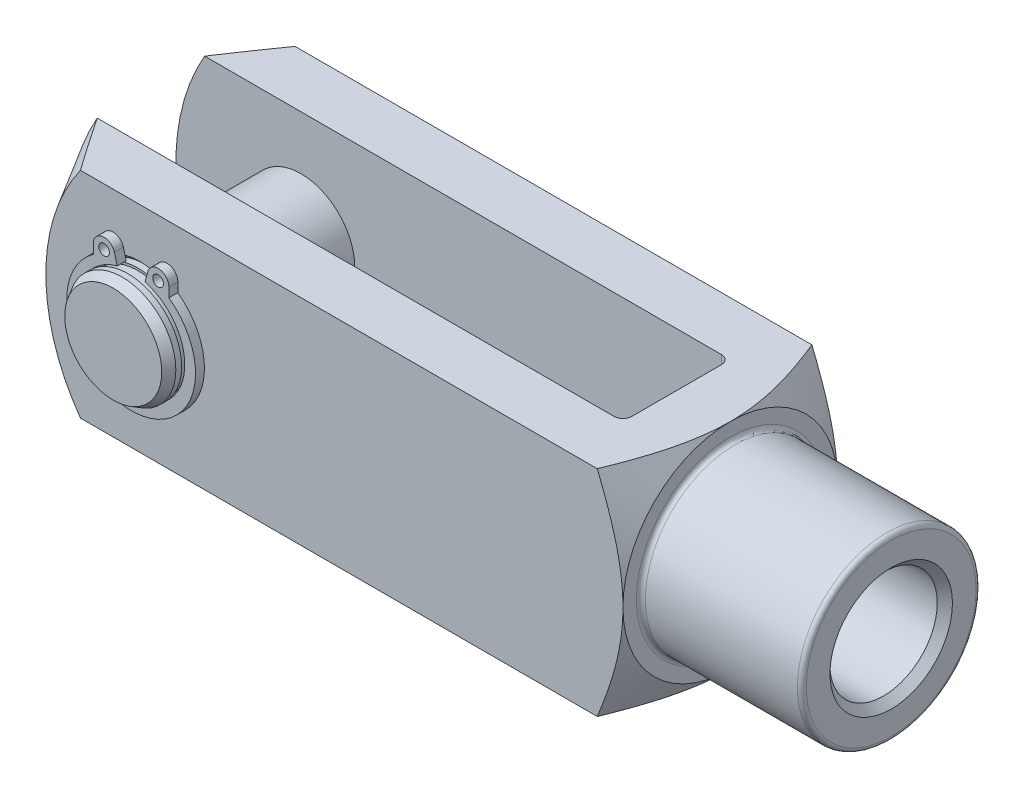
ISO-10303-21;
HEADER;
FILE_DESCRIPTION(('STEP AP214'),'2;1');
FILE_NAME('part.step','',(''),(''),'','','');
FILE_SCHEMA(('AUTOMOTIVE_DESIGN { 1 0 10303 214 1 1 1 1 }'));
ENDSEC;
DATA;
#1=APPLICATION_CONTEXT('core data for automotive mechanical design processes');
#2=APPLICATION_PROTOCOL_DEFINITION('international standard','automotive_design',2000,#1);
#3=PRODUCT_CONTEXT('',#1,'mechanical');
#4=PRODUCT('Part','Part','',(#3));
#5=PRODUCT_RELATED_PRODUCT_CATEGORY('part','',(#4));
#6=PRODUCT_DEFINITION_FORMATION('','',#4);
#7=PRODUCT_DEFINITION_CONTEXT('part definition',#1,'design');
#8=PRODUCT_DEFINITION('design','',#6,#7);
#9=PRODUCT_DEFINITION_SHAPE('','',#8);
#10=(LENGTH_UNIT() NAMED_UNIT(*) SI_UNIT(.MILLI.,.METRE.));
#11=(NAMED_UNIT(*) PLANE_ANGLE_UNIT() SI_UNIT($,.RADIAN.));
#12=(NAMED_UNIT(*) SI_UNIT($,.STERADIAN.) SOLID_ANGLE_UNIT());
#13=UNCERTAINTY_MEASURE_WITH_UNIT(LENGTH_MEASURE(1.E-05),#10,'distance_accuracy_value','');
#14=(GEOMETRIC_REPRESENTATION_CONTEXT(3) GLOBAL_UNCERTAINTY_ASSIGNED_CONTEXT((#13)) GLOBAL_UNIT_ASSIGNED_CONTEXT((#10,
#11,#12)) REPRESENTATION_CONTEXT('',''));
#15=CARTESIAN_POINT('',(0.,0.,0.));
#16=DIRECTION('',(0.,0.,1.));
#17=DIRECTION('',(1.,0.,0.));
#18=AXIS2_PLACEMENT_3D('',#15,#16,#17);
#19=CARTESIAN_POINT('',(-72.,0.,15.));
#20=DIRECTION('',(0.,0.,-1.));
#21=DIRECTION('',(-1.,0.,0.));
#22=AXIS2_PLACEMENT_3D('',#19,#20,#21);
#23=CYLINDRICAL_SURFACE('',#22,6.);
#24=CARTESIAN_POINT('',(-72.,0.,12.25));
#25=DIRECTION('',(0.,0.,1.));
#26=DIRECTION('',(1.,0.,0.));
#27=AXIS2_PLACEMENT_3D('',#24,#25,#26);
#28=CIRCLE('',#27,6.);
#29=CARTESIAN_POINT('',(-66.,0.,12.25));
#30=VERTEX_POINT('',#29);
#31=EDGE_CURVE('P0_E55',#30,#30,#28,.T.);
#32=ORIENTED_EDGE('',*,*,#31,.F.);
#33=EDGE_LOOP('',(#32));
#34=FACE_BOUND('',#33,.T.);
#35=CARTESIAN_POINT('',(-72.,0.,-12.25));
#36=DIRECTION('',(0.,0.,1.));
#37=DIRECTION('',(1.,0.,0.));
#38=AXIS2_PLACEMENT_3D('',#35,#36,#37);
#39=CIRCLE('',#38,6.);
#40=CARTESIAN_POINT('',(-66.,0.,-12.25));
#41=VERTEX_POINT('',#40);
#42=EDGE_CURVE('P0_E40',#41,#41,#39,.T.);
#43=ORIENTED_EDGE('',*,*,#42,.T.);
#44=EDGE_LOOP('',(#43));
#45=FACE_BOUND('',#44,.T.);
#46=ADVANCED_FACE('P0_F14',(#34,#45),#23,.T.);
#47=CARTESIAN_POINT('',(-72.,0.,-13.35));
#48=DIRECTION('',(0.,0.,1.));
#49=DIRECTION('',(1.,0.,0.));
#50=AXIS2_PLACEMENT_3D('',#47,#48,#49);
#51=CIRCLE('',#50,6.);
#52=CARTESIAN_POINT('',(-66.,0.,-13.35));
#53=VERTEX_POINT('',#52);
#54=EDGE_CURVE('P0_E43',#53,#53,#51,.T.);
#55=ORIENTED_EDGE('',*,*,#54,.F.);
#56=EDGE_LOOP('',(#55));
#57=FACE_BOUND('',#56,.T.);
#58=CARTESIAN_POINT('',(-72.,0.,-14.));
#59=DIRECTION('',(0.,0.,1.));
#60=DIRECTION('',(1.,0.,0.));
#61=AXIS2_PLACEMENT_3D('',#58,#59,#60);
#62=CIRCLE('',#61,6.);
#63=CARTESIAN_POINT('',(-66.,0.,-14.));
#64=VERTEX_POINT('',#63);
#65=EDGE_CURVE('P0_E25',#64,#64,#62,.T.);
#66=ORIENTED_EDGE('',*,*,#65,.T.);
#67=EDGE_LOOP('',(#66));
#68=FACE_BOUND('',#67,.T.);
#69=ADVANCED_FACE('P0_F63',(#57,#68),#23,.T.);
#70=CARTESIAN_POINT('',(-72.,0.,-15.));
#71=DIRECTION('',(0.,0.,1.));
#72=DIRECTION('',(1.,0.,0.));
#73=AXIS2_PLACEMENT_3D('',#70,#71,#72);
#74=PLANE('',#73);
#75=CARTESIAN_POINT('',(-72.,0.,-15.));
#76=DIRECTION('',(0.,0.,1.));
#77=DIRECTION('',(1.,0.,0.));
#78=AXIS2_PLACEMENT_3D('',#75,#76,#77);
#79=CIRCLE('',#78,5.42264973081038);
#80=CARTESIAN_POINT('',(-66.5773502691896,0.,-15.));
#81=VERTEX_POINT('',#80);
#82=EDGE_CURVE('P0_E21',#81,#81,#79,.F.);
#83=ORIENTED_EDGE('',*,*,#82,.T.);
#84=EDGE_LOOP('',(#83));
#85=FACE_BOUND('',#84,.T.);
#86=ADVANCED_FACE('P0_F89',(#85),#74,.F.);
#87=CARTESIAN_POINT('',(-72.,0.,-14.));
#88=DIRECTION('',(0.,0.,1.));
#89=DIRECTION('',(1.,0.,0.));
#90=AXIS2_PLACEMENT_3D('',#87,#88,#89);
#91=CONICAL_SURFACE('',#90,6.,0.523598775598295);
#92=ORIENTED_EDGE('',*,*,#82,.F.);
#93=EDGE_LOOP('',(#92));
#94=FACE_BOUND('',#93,.T.);
#95=ORIENTED_EDGE('',*,*,#65,.F.);
#96=EDGE_LOOP('',(#95));
#97=FACE_BOUND('',#96,.T.);
#98=ADVANCED_FACE('P0_F83',(#94,#97),#91,.T.);
#99=CARTESIAN_POINT('',(-72.,6.,-13.35));
#100=DIRECTION('',(0.,0.,-1.));
#101=DIRECTION('',(-1.,0.,0.));
#102=AXIS2_PLACEMENT_3D('',#99,#100,#101);
#103=PLANE('',#102);
#104=CARTESIAN_POINT('',(-72.,0.,-13.35));
#105=DIRECTION('',(0.,0.,1.));
#106=DIRECTION('',(1.,0.,0.));
#107=AXIS2_PLACEMENT_3D('',#104,#105,#106);
#108=CIRCLE('',#107,5.75);
#109=CARTESIAN_POINT('',(-66.25,0.,-13.35));
#110=VERTEX_POINT('',#109);
#111=EDGE_CURVE('P0_E34',#110,#110,#108,.T.);
#112=ORIENTED_EDGE('',*,*,#111,.F.);
#113=EDGE_LOOP('',(#112));
#114=FACE_BOUND('',#113,.T.);
#115=ORIENTED_EDGE('',*,*,#54,.T.);
#116=EDGE_LOOP('',(#115));
#117=FACE_BOUND('',#116,.T.);
#118=ADVANCED_FACE('P0_F77',(#114,#117),#103,.F.);
#119=CARTESIAN_POINT('',(-72.,0.,14.));
#120=DIRECTION('',(0.,0.,1.));
#121=DIRECTION('',(1.,0.,0.));
#122=AXIS2_PLACEMENT_3D('',#119,#120,#121);
#123=CYLINDRICAL_SURFACE('',#122,5.75);
#124=CARTESIAN_POINT('',(-72.,0.,-12.25));
#125=DIRECTION('',(0.,0.,1.));
#126=DIRECTION('',(1.,0.,0.));
#127=AXIS2_PLACEMENT_3D('',#124,#125,#126);
#128=CIRCLE('',#127,5.75);
#129=CARTESIAN_POINT('',(-66.25,0.,-12.25));
#130=VERTEX_POINT('',#129);
#131=EDGE_CURVE('P0_E37',#130,#130,#128,.T.);
#132=ORIENTED_EDGE('',*,*,#131,.F.);
#133=EDGE_LOOP('',(#132));
#134=FACE_BOUND('',#133,.T.);
#135=ORIENTED_EDGE('',*,*,#111,.T.);
#136=EDGE_LOOP('',(#135));
#137=FACE_BOUND('',#136,.T.);
#138=ADVANCED_FACE('P0_F71',(#134,#137),#123,.T.);
#139=CARTESIAN_POINT('',(-72.,6.,-12.25));
#140=DIRECTION('',(0.,0.,1.));
#141=DIRECTION('',(1.,0.,0.));
#142=AXIS2_PLACEMENT_3D('',#139,#140,#141);
#143=PLANE('',#142);
#144=ORIENTED_EDGE('',*,*,#42,.F.);
#145=EDGE_LOOP('',(#144));
#146=FACE_BOUND('',#145,.T.);
#147=ORIENTED_EDGE('',*,*,#131,.T.);
#148=EDGE_LOOP('',(#147));
#149=FACE_BOUND('',#148,.T.);
#150=ADVANCED_FACE('P0_F68',(#146,#149),#143,.F.);
#151=CARTESIAN_POINT('',(-72.,6.,12.25));
#152=DIRECTION('',(0.,0.,-1.));
#153=DIRECTION('',(-1.,0.,0.));
#154=AXIS2_PLACEMENT_3D('',#151,#152,#153);
#155=PLANE('',#154);
#156=CARTESIAN_POINT('',(-72.,0.,12.25));
#157=DIRECTION('',(0.,0.,1.));
#158=DIRECTION('',(1.,0.,0.));
#159=AXIS2_PLACEMENT_3D('',#156,#157,#158);
#160=CIRCLE('',#159,5.75);
#161=CARTESIAN_POINT('',(-66.25,0.,12.25));
#162=VERTEX_POINT('',#161);
#163=EDGE_CURVE('P0_E46',#162,#162,#160,.T.);
#164=ORIENTED_EDGE('',*,*,#163,.F.);
#165=EDGE_LOOP('',(#164));
#166=FACE_BOUND('',#165,.T.);
#167=ORIENTED_EDGE('',*,*,#31,.T.);
#168=EDGE_LOOP('',(#167));
#169=FACE_BOUND('',#168,.T.);
#170=ADVANCED_FACE('P0_F59',(#166,#169),#155,.F.);
#171=CARTESIAN_POINT('',(-72.,0.,14.));
#172=DIRECTION('',(0.,0.,1.));
#173=DIRECTION('',(1.,0.,0.));
#174=AXIS2_PLACEMENT_3D('',#171,#172,#173);
#175=CYLINDRICAL_SURFACE('',#174,5.75);
#176=CARTESIAN_POINT('',(-72.,0.,13.35));
#177=DIRECTION('',(0.,0.,1.));
#178=DIRECTION('',(1.,0.,0.));
#179=AXIS2_PLACEMENT_3D('',#176,#177,#178);
#180=CIRCLE('',#179,5.75);
#181=CARTESIAN_POINT('',(-66.25,0.,13.35));
#182=VERTEX_POINT('',#181);
#183=EDGE_CURVE('P0_E49',#182,#182,#180,.T.);
#184=ORIENTED_EDGE('',*,*,#183,.F.);
#185=EDGE_LOOP('',(#184));
#186=FACE_BOUND('',#185,.T.);
#187=ORIENTED_EDGE('',*,*,#163,.T.);
#188=EDGE_LOOP('',(#187));
#189=FACE_BOUND('',#188,.T.);
#190=ADVANCED_FACE('P0_F108',(#186,#189),#175,.T.);
#191=CARTESIAN_POINT('',(-72.,6.,13.35));
#192=DIRECTION('',(0.,0.,1.));
#193=DIRECTION('',(1.,0.,0.));
#194=AXIS2_PLACEMENT_3D('',#191,#192,#193);
#195=PLANE('',#194);
#196=CARTESIAN_POINT('',(-72.,0.,13.35));
#197=DIRECTION('',(0.,0.,1.));
#198=DIRECTION('',(1.,0.,0.));
#199=AXIS2_PLACEMENT_3D('',#196,#197,#198);
#200=CIRCLE('',#199,6.);
#201=CARTESIAN_POINT('',(-66.,0.,13.35));
#202=VERTEX_POINT('',#201);
#203=EDGE_CURVE('P0_E52',#202,#202,#200,.T.);
#204=ORIENTED_EDGE('',*,*,#203,.F.);
#205=EDGE_LOOP('',(#204));
#206=FACE_BOUND('',#205,.T.);
#207=ORIENTED_EDGE('',*,*,#183,.T.);
#208=EDGE_LOOP('',(#207));
#209=FACE_BOUND('',#208,.T.);
#210=ADVANCED_FACE('P0_F104',(#206,#209),#195,.F.);
#211=CARTESIAN_POINT('',(-72.,0.,15.));
#212=DIRECTION('',(0.,0.,1.));
#213=DIRECTION('',(1.,0.,0.));
#214=AXIS2_PLACEMENT_3D('',#211,#212,#213);
#215=PLANE('',#214);
#216=CARTESIAN_POINT('',(-72.,0.,15.));
#217=DIRECTION('',(0.,0.,1.));
#218=DIRECTION('',(1.,0.,0.));
#219=AXIS2_PLACEMENT_3D('',#216,#217,#218);
#220=CIRCLE('',#219,5.42264973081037);
#221=CARTESIAN_POINT('',(-66.5773502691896,0.,15.));
#222=VERTEX_POINT('',#221);
#223=EDGE_CURVE('P0_E10',#222,#222,#220,.T.);
#224=ORIENTED_EDGE('',*,*,#223,.T.);
#225=EDGE_LOOP('',(#224));
#226=FACE_BOUND('',#225,.T.);
#227=ADVANCED_FACE('P0_F102',(#226),#215,.T.);
#228=CARTESIAN_POINT('',(-72.,0.,15.));
#229=DIRECTION('',(0.,0.,-1.));
#230=DIRECTION('',(-1.,0.,0.));
#231=AXIS2_PLACEMENT_3D('',#228,#229,#230);
#232=CONICAL_SURFACE('',#231,5.42264973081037,0.523598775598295);
#233=CARTESIAN_POINT('',(-72.,0.,14.));
#234=DIRECTION('',(0.,0.,1.));
#235=DIRECTION('',(1.,0.,0.));
#236=AXIS2_PLACEMENT_3D('',#233,#234,#235);
#237=CIRCLE('',#236,6.);
#238=CARTESIAN_POINT('',(-66.,0.,14.));
#239=VERTEX_POINT('',#238);
#240=EDGE_CURVE('P0_E29',#239,#239,#237,.F.);
#241=ORIENTED_EDGE('',*,*,#240,.F.);
#242=EDGE_LOOP('',(#241));
#243=FACE_BOUND('',#242,.T.);
#244=ORIENTED_EDGE('',*,*,#223,.F.);
#245=EDGE_LOOP('',(#244));
#246=FACE_BOUND('',#245,.T.);
#247=ADVANCED_FACE('P0_F16',(#243,#246),#232,.T.);
#248=ORIENTED_EDGE('',*,*,#203,.T.);
#249=EDGE_LOOP('',(#248));
#250=FACE_BOUND('',#249,.T.);
#251=ORIENTED_EDGE('',*,*,#240,.T.);
#252=EDGE_LOOP('',(#251));
#253=FACE_BOUND('',#252,.T.);
#254=ADVANCED_FACE('P0_F65',(#250,#253),#23,.T.);
#255=CLOSED_SHELL('',(#46,#69,#86,#98,#118,#138,#150,#170,#190,#210,#227,#247,#254));
#256=MANIFOLD_SOLID_BREP('P0_B1',#255);
#257=CARTESIAN_POINT('',(-72.,0.,12.9999999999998));
#258=DIRECTION('',(0.,0.,1.));
#259=DIRECTION('',(1.,0.,0.));
#260=AXIS2_PLACEMENT_3D('',#257,#258,#259);
#261=PLANE('',#260);
#262=CARTESIAN_POINT('',(-75.0226081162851,6.64408309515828,12.9999999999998));
#263=DIRECTION('',(0.,0.,1.));
#264=DIRECTION('',(1.,0.,0.));
#265=AXIS2_PLACEMENT_3D('',#262,#263,#264);
#266=CIRCLE('',#265,0.6);
#267=CARTESIAN_POINT('',(-74.4226081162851,6.64408309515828,12.9999999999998));
#268=VERTEX_POINT('',#267);
#269=EDGE_CURVE('P1_E117',#268,#268,#266,.T.);
#270=ORIENTED_EDGE('',*,*,#269,.F.);
#271=EDGE_LOOP('',(#270));
#272=FACE_BOUND('',#271,.T.);
#273=CARTESIAN_POINT('',(-72.,0.,12.9999999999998));
#274=DIRECTION('',(0.,0.,-1.));
#275=DIRECTION('',(1.,0.,0.));
#276=AXIS2_PLACEMENT_3D('',#273,#274,#275);
#277=CIRCLE('',#276,6.);
#278=CARTESIAN_POINT('',(-70.4470857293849,5.79555495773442,12.9999999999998));
#279=VERTEX_POINT('',#278);
#280=CARTESIAN_POINT('',(-73.5529142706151,5.79555495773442,12.9999999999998));
#281=VERTEX_POINT('',#280);
#282=EDGE_CURVE('P1_E128',#279,#281,#277,.T.);
#283=ORIENTED_EDGE('',*,*,#282,.T.);
#284=DIRECTION('',(-0.258819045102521,0.965925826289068,0.));
#285=VECTOR('',#284,1.);
#286=CARTESIAN_POINT('',(-73.5529142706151,5.79555495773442,12.9999999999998));
#287=LINE('',#286,#285);
#288=CARTESIAN_POINT('',(-73.8634971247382,6.9546659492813,12.9999999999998));
#289=VERTEX_POINT('',#288);
#290=EDGE_CURVE('P1_E76',#281,#289,#287,.T.);
#291=ORIENTED_EDGE('',*,*,#290,.T.);
#292=CARTESIAN_POINT('',(-75.0226081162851,6.64408309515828,12.9999999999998));
#293=DIRECTION('',(0.,0.,1.));
#294=DIRECTION('',(1.,0.,0.));
#295=AXIS2_PLACEMENT_3D('',#292,#293,#294);
#296=CIRCLE('',#295,1.2);
#297=CARTESIAN_POINT('',(-76.2226081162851,6.64408309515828,12.9999999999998));
#298=VERTEX_POINT('',#297);
#299=EDGE_CURVE('P1_E143',#289,#298,#296,.T.);
#300=ORIENTED_EDGE('',*,*,#299,.T.);
#301=DIRECTION('',(0.,-1.,0.));
#302=VECTOR('',#301,1.);
#303=CARTESIAN_POINT('',(-76.2226081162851,6.64408309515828,12.9999999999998));
#304=LINE('',#303,#302);
#305=CARTESIAN_POINT('',(-76.2226081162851,5.59177337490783,12.9999999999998));
#306=VERTEX_POINT('',#305);
#307=EDGE_CURVE('P1_E156',#298,#306,#304,.T.);
#308=ORIENTED_EDGE('',*,*,#307,.T.);
#309=CARTESIAN_POINT('',(-72.,-0.239999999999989,12.9999999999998));
#310=DIRECTION('',(0.,0.,1.));
#311=DIRECTION('',(1.,0.,0.));
#312=AXIS2_PLACEMENT_3D('',#309,#310,#311);
#313=CIRCLE('',#312,7.2);
#314=CARTESIAN_POINT('',(-67.777391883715,5.59177337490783,12.9999999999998));
#315=VERTEX_POINT('',#314);
#316=EDGE_CURVE('P1_E95',#306,#315,#313,.T.);
#317=ORIENTED_EDGE('',*,*,#316,.T.);
#318=DIRECTION('',(0.,1.,0.));
#319=VECTOR('',#318,1.);
#320=CARTESIAN_POINT('',(-67.777391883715,6.64408309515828,12.9999999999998));
#321=LINE('',#320,#319);
#322=CARTESIAN_POINT('',(-67.777391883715,6.64408309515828,12.9999999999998));
#323=VERTEX_POINT('',#322);
#324=EDGE_CURVE('P1_E89',#315,#323,#321,.T.);
#325=ORIENTED_EDGE('',*,*,#324,.T.);
#326=CARTESIAN_POINT('',(-68.977391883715,6.64408309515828,12.9999999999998));
#327=DIRECTION('',(0.,0.,1.));
#328=DIRECTION('',(-1.,0.,0.));
#329=AXIS2_PLACEMENT_3D('',#326,#327,#328);
#330=CIRCLE('',#329,1.2);
#331=CARTESIAN_POINT('',(-70.1365028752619,6.9546659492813,12.9999999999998));
#332=VERTEX_POINT('',#331);
#333=EDGE_CURVE('P1_E93',#323,#332,#330,.T.);
#334=ORIENTED_EDGE('',*,*,#333,.T.);
#335=DIRECTION('',(-0.258819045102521,-0.965925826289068,0.));
#336=VECTOR('',#335,1.);
#337=CARTESIAN_POINT('',(-70.4470857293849,5.79555495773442,12.9999999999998));
#338=LINE('',#337,#336);
#339=EDGE_CURVE('P1_E33',#332,#279,#338,.T.);
#340=ORIENTED_EDGE('',*,*,#339,.T.);
#341=EDGE_LOOP('',(#283,#291,#300,#308,#317,#325,#334,#340));
#342=FACE_BOUND('',#341,.T.);
#343=CARTESIAN_POINT('',(-68.977391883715,6.64408309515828,12.9999999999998));
#344=DIRECTION('',(0.,0.,1.));
#345=DIRECTION('',(-1.,0.,0.));
#346=AXIS2_PLACEMENT_3D('',#343,#344,#345);
#347=CIRCLE('',#346,0.6);
#348=CARTESIAN_POINT('',(-69.577391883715,6.64408309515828,12.9999999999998));
#349=VERTEX_POINT('',#348);
#350=EDGE_CURVE('P1_E165',#349,#349,#347,.T.);
#351=ORIENTED_EDGE('',*,*,#350,.F.);
#352=EDGE_LOOP('',(#351));
#353=FACE_BOUND('',#352,.T.);
#354=ADVANCED_FACE('P1_F16',(#272,#342,#353),#261,.T.);
#355=CARTESIAN_POINT('',(-72.,0.,11.9999999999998));
#356=DIRECTION('',(0.,0.,1.));
#357=DIRECTION('',(1.,0.,0.));
#358=AXIS2_PLACEMENT_3D('',#355,#356,#357);
#359=PLANE('',#358);
#360=CARTESIAN_POINT('',(-75.0226081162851,6.64408309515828,11.9999999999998));
#361=DIRECTION('',(0.,0.,1.));
#362=DIRECTION('',(1.,0.,0.));
#363=AXIS2_PLACEMENT_3D('',#360,#361,#362);
#364=CIRCLE('',#363,0.6);
#365=CARTESIAN_POINT('',(-74.422608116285,6.64408309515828,11.9999999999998));
#366=VERTEX_POINT('',#365);
#367=EDGE_CURVE('P1_E162',#366,#366,#364,.T.);
#368=ORIENTED_EDGE('',*,*,#367,.T.);
#369=EDGE_LOOP('',(#368));
#370=FACE_BOUND('',#369,.T.);
#371=CARTESIAN_POINT('',(-72.,0.,11.9999999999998));
#372=DIRECTION('',(0.,0.,-1.));
#373=DIRECTION('',(1.,0.,0.));
#374=AXIS2_PLACEMENT_3D('',#371,#372,#373);
#375=CIRCLE('',#374,6.);
#376=CARTESIAN_POINT('',(-70.4470857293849,5.79555495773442,11.9999999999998));
#377=VERTEX_POINT('',#376);
#378=CARTESIAN_POINT('',(-73.5529142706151,5.79555495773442,11.9999999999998));
#379=VERTEX_POINT('',#378);
#380=EDGE_CURVE('P1_E113',#377,#379,#375,.T.);
#381=ORIENTED_EDGE('',*,*,#380,.F.);
#382=DIRECTION('',(-0.258819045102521,-0.965925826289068,0.));
#383=VECTOR('',#382,1.);
#384=CARTESIAN_POINT('',(-70.4470857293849,5.79555495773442,11.9999999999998));
#385=LINE('',#384,#383);
#386=CARTESIAN_POINT('',(-70.1365028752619,6.9546659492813,11.9999999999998));
#387=VERTEX_POINT('',#386);
#388=EDGE_CURVE('P1_E68',#387,#377,#385,.T.);
#389=ORIENTED_EDGE('',*,*,#388,.F.);
#390=CARTESIAN_POINT('',(-68.977391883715,6.64408309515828,11.9999999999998));
#391=DIRECTION('',(0.,0.,1.));
#392=DIRECTION('',(-1.,0.,0.));
#393=AXIS2_PLACEMENT_3D('',#390,#391,#392);
#394=CIRCLE('',#393,1.2);
#395=CARTESIAN_POINT('',(-67.777391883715,6.64408309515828,11.9999999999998));
#396=VERTEX_POINT('',#395);
#397=EDGE_CURVE('P1_E62',#396,#387,#394,.T.);
#398=ORIENTED_EDGE('',*,*,#397,.F.);
#399=DIRECTION('',(0.,1.,0.));
#400=VECTOR('',#399,1.);
#401=CARTESIAN_POINT('',(-67.777391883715,6.64408309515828,11.9999999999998));
#402=LINE('',#401,#400);
#403=CARTESIAN_POINT('',(-67.777391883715,5.59177337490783,11.9999999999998));
#404=VERTEX_POINT('',#403);
#405=EDGE_CURVE('P1_E103',#404,#396,#402,.T.);
#406=ORIENTED_EDGE('',*,*,#405,.F.);
#407=CARTESIAN_POINT('',(-72.,-0.239999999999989,11.9999999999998));
#408=DIRECTION('',(0.,0.,1.));
#409=DIRECTION('',(1.,0.,0.));
#410=AXIS2_PLACEMENT_3D('',#407,#408,#409);
#411=CIRCLE('',#410,7.2);
#412=CARTESIAN_POINT('',(-76.2226081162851,5.59177337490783,11.9999999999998));
#413=VERTEX_POINT('',#412);
#414=EDGE_CURVE('P1_E123',#413,#404,#411,.T.);
#415=ORIENTED_EDGE('',*,*,#414,.F.);
#416=DIRECTION('',(0.,-1.,0.));
#417=VECTOR('',#416,1.);
#418=CARTESIAN_POINT('',(-76.2226081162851,6.64408309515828,11.9999999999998));
#419=LINE('',#418,#417);
#420=CARTESIAN_POINT('',(-76.2226081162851,6.64408309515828,11.9999999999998));
#421=VERTEX_POINT('',#420);
#422=EDGE_CURVE('P1_E121',#421,#413,#419,.T.);
#423=ORIENTED_EDGE('',*,*,#422,.F.);
#424=CARTESIAN_POINT('',(-75.0226081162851,6.64408309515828,11.9999999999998));
#425=DIRECTION('',(0.,0.,1.));
#426=DIRECTION('',(1.,0.,0.));
#427=AXIS2_PLACEMENT_3D('',#424,#425,#426);
#428=CIRCLE('',#427,1.2);
#429=CARTESIAN_POINT('',(-73.8634971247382,6.9546659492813,11.9999999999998));
#430=VERTEX_POINT('',#429);
#431=EDGE_CURVE('P1_E119',#430,#421,#428,.T.);
#432=ORIENTED_EDGE('',*,*,#431,.F.);
#433=DIRECTION('',(-0.258819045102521,0.965925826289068,0.));
#434=VECTOR('',#433,1.);
#435=CARTESIAN_POINT('',(-73.5529142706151,5.79555495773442,11.9999999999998));
#436=LINE('',#435,#434);
#437=EDGE_CURVE('P1_E116',#379,#430,#436,.T.);
#438=ORIENTED_EDGE('',*,*,#437,.F.);
#439=EDGE_LOOP('',(#381,#389,#398,#406,#415,#423,#432,#438));
#440=FACE_BOUND('',#439,.T.);
#441=CARTESIAN_POINT('',(-68.977391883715,6.64408309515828,11.9999999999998));
#442=DIRECTION('',(0.,0.,1.));
#443=DIRECTION('',(-1.,0.,0.));
#444=AXIS2_PLACEMENT_3D('',#441,#442,#443);
#445=CIRCLE('',#444,0.6);
#446=CARTESIAN_POINT('',(-69.577391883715,6.64408309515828,11.9999999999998));
#447=VERTEX_POINT('',#446);
#448=EDGE_CURVE('P1_E168',#447,#447,#445,.T.);
#449=ORIENTED_EDGE('',*,*,#448,.T.);
#450=EDGE_LOOP('',(#449));
#451=FACE_BOUND('',#450,.T.);
#452=ADVANCED_FACE('P1_F147',(#370,#440,#451),#359,.F.);
#453=CARTESIAN_POINT('',(-72.,0.,12.9999999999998));
#454=DIRECTION('',(0.,0.,-1.));
#455=DIRECTION('',(-1.,0.,0.));
#456=AXIS2_PLACEMENT_3D('',#453,#454,#455);
#457=CYLINDRICAL_SURFACE('',#456,6.);
#458=ORIENTED_EDGE('',*,*,#380,.T.);
#459=DIRECTION('',(0.,0.,-1.));
#460=VECTOR('',#459,1.);
#461=CARTESIAN_POINT('',(-73.5529142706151,5.79555495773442,12.9999999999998));
#462=LINE('',#461,#460);
#463=EDGE_CURVE('P1_E11',#281,#379,#462,.T.);
#464=ORIENTED_EDGE('',*,*,#463,.F.);
#465=ORIENTED_EDGE('',*,*,#282,.F.);
#466=DIRECTION('',(0.,0.,-1.));
#467=VECTOR('',#466,1.);
#468=CARTESIAN_POINT('',(-70.4470857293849,5.79555495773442,12.9999999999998));
#469=LINE('',#468,#467);
#470=EDGE_CURVE('P1_E109',#279,#377,#469,.T.);
#471=ORIENTED_EDGE('',*,*,#470,.T.);
#472=EDGE_LOOP('',(#458,#464,#465,#471));
#473=FACE_BOUND('',#472,.T.);
#474=ADVANCED_FACE('P1_F18',(#473),#457,.F.);
#475=CARTESIAN_POINT('',(-73.5529142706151,5.79555495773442,12.9999999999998));
#476=DIRECTION('',(-0.965925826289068,-0.258819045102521,0.));
#477=DIRECTION('',(0.258819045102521,-0.965925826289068,0.));
#478=AXIS2_PLACEMENT_3D('',#475,#476,#477);
#479=PLANE('',#478);
#480=ORIENTED_EDGE('',*,*,#437,.T.);
#481=DIRECTION('',(0.,0.,-1.));
#482=VECTOR('',#481,1.);
#483=CARTESIAN_POINT('',(-73.8634971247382,6.9546659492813,12.9999999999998));
#484=LINE('',#483,#482);
#485=EDGE_CURVE('P1_E25',#289,#430,#484,.T.);
#486=ORIENTED_EDGE('',*,*,#485,.F.);
#487=ORIENTED_EDGE('',*,*,#290,.F.);
#488=ORIENTED_EDGE('',*,*,#463,.T.);
#489=EDGE_LOOP('',(#480,#486,#487,#488));
#490=FACE_BOUND('',#489,.T.);
#491=ADVANCED_FACE('P1_F202',(#490),#479,.F.);
#492=CARTESIAN_POINT('',(-75.0226081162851,6.64408309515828,12.9999999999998));
#493=DIRECTION('',(0.,0.,-1.));
#494=DIRECTION('',(-1.,0.,0.));
#495=AXIS2_PLACEMENT_3D('',#492,#493,#494);
#496=CYLINDRICAL_SURFACE('',#495,1.2);
#497=ORIENTED_EDGE('',*,*,#431,.T.);
#498=DIRECTION('',(0.,0.,-1.));
#499=VECTOR('',#498,1.);
#500=CARTESIAN_POINT('',(-76.2226081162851,6.64408309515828,12.9999999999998));
#501=LINE('',#500,#499);
#502=EDGE_CURVE('P1_E135',#298,#421,#501,.T.);
#503=ORIENTED_EDGE('',*,*,#502,.F.);
#504=ORIENTED_EDGE('',*,*,#299,.F.);
#505=ORIENTED_EDGE('',*,*,#485,.T.);
#506=EDGE_LOOP('',(#497,#503,#504,#505));
#507=FACE_BOUND('',#506,.T.);
#508=ADVANCED_FACE('P1_F141',(#507),#496,.T.);
#509=CARTESIAN_POINT('',(-76.2226081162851,6.64408309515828,12.9999999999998));
#510=DIRECTION('',(1.,0.,0.));
#511=DIRECTION('',(0.,1.,0.));
#512=AXIS2_PLACEMENT_3D('',#509,#510,#511);
#513=PLANE('',#512);
#514=ORIENTED_EDGE('',*,*,#422,.T.);
#515=DIRECTION('',(0.,0.,-1.));
#516=VECTOR('',#515,1.);
#517=CARTESIAN_POINT('',(-76.2226081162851,5.59177337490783,12.9999999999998));
#518=LINE('',#517,#516);
#519=EDGE_CURVE('P1_E132',#306,#413,#518,.T.);
#520=ORIENTED_EDGE('',*,*,#519,.F.);
#521=ORIENTED_EDGE('',*,*,#307,.F.);
#522=ORIENTED_EDGE('',*,*,#502,.T.);
#523=EDGE_LOOP('',(#514,#520,#521,#522));
#524=FACE_BOUND('',#523,.T.);
#525=ADVANCED_FACE('P1_F152',(#524),#513,.F.);
#526=CARTESIAN_POINT('',(-72.,-0.239999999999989,12.9999999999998));
#527=DIRECTION('',(0.,0.,-1.));
#528=DIRECTION('',(-1.,0.,0.));
#529=AXIS2_PLACEMENT_3D('',#526,#527,#528);
#530=CYLINDRICAL_SURFACE('',#529,7.2);
#531=ORIENTED_EDGE('',*,*,#414,.T.);
#532=DIRECTION('',(0.,0.,-1.));
#533=VECTOR('',#532,1.);
#534=CARTESIAN_POINT('',(-67.777391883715,5.59177337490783,12.9999999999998));
#535=LINE('',#534,#533);
#536=EDGE_CURVE('P1_E104',#315,#404,#535,.T.);
#537=ORIENTED_EDGE('',*,*,#536,.F.);
#538=ORIENTED_EDGE('',*,*,#316,.F.);
#539=ORIENTED_EDGE('',*,*,#519,.T.);
#540=EDGE_LOOP('',(#531,#537,#538,#539));
#541=FACE_BOUND('',#540,.T.);
#542=ADVANCED_FACE('P1_F155',(#541),#530,.T.);
#543=CARTESIAN_POINT('',(-67.777391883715,6.64408309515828,12.9999999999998));
#544=DIRECTION('',(-1.,0.,0.));
#545=DIRECTION('',(0.,-1.,0.));
#546=AXIS2_PLACEMENT_3D('',#543,#544,#545);
#547=PLANE('',#546);
#548=ORIENTED_EDGE('',*,*,#405,.T.);
#549=DIRECTION('',(0.,0.,-1.));
#550=VECTOR('',#549,1.);
#551=CARTESIAN_POINT('',(-67.777391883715,6.64408309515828,12.9999999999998));
#552=LINE('',#551,#550);
#553=EDGE_CURVE('P1_E100',#323,#396,#552,.T.);
#554=ORIENTED_EDGE('',*,*,#553,.F.);
#555=ORIENTED_EDGE('',*,*,#324,.F.);
#556=ORIENTED_EDGE('',*,*,#536,.T.);
#557=EDGE_LOOP('',(#548,#554,#555,#556));
#558=FACE_BOUND('',#557,.T.);
#559=ADVANCED_FACE('P1_F101',(#558),#547,.F.);
#560=CARTESIAN_POINT('',(-68.977391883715,6.64408309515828,12.9999999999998));
#561=DIRECTION('',(0.,0.,-1.));
#562=DIRECTION('',(-1.,0.,0.));
#563=AXIS2_PLACEMENT_3D('',#560,#561,#562);
#564=CYLINDRICAL_SURFACE('',#563,1.2);
#565=ORIENTED_EDGE('',*,*,#397,.T.);
#566=DIRECTION('',(0.,0.,-1.));
#567=VECTOR('',#566,1.);
#568=CARTESIAN_POINT('',(-70.1365028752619,6.9546659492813,12.9999999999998));
#569=LINE('',#568,#567);
#570=EDGE_CURVE('P1_E105',#332,#387,#569,.T.);
#571=ORIENTED_EDGE('',*,*,#570,.F.);
#572=ORIENTED_EDGE('',*,*,#333,.F.);
#573=ORIENTED_EDGE('',*,*,#553,.T.);
#574=EDGE_LOOP('',(#565,#571,#572,#573));
#575=FACE_BOUND('',#574,.T.);
#576=ADVANCED_FACE('P1_F107',(#575),#564,.T.);
#577=CARTESIAN_POINT('',(-70.4470857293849,5.79555495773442,12.9999999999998));
#578=DIRECTION('',(0.965925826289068,-0.258819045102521,0.));
#579=DIRECTION('',(0.258819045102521,0.965925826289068,0.));
#580=AXIS2_PLACEMENT_3D('',#577,#578,#579);
#581=PLANE('',#580);
#582=ORIENTED_EDGE('',*,*,#388,.T.);
#583=ORIENTED_EDGE('',*,*,#470,.F.);
#584=ORIENTED_EDGE('',*,*,#339,.F.);
#585=ORIENTED_EDGE('',*,*,#570,.T.);
#586=EDGE_LOOP('',(#582,#583,#584,#585));
#587=FACE_BOUND('',#586,.T.);
#588=ADVANCED_FACE('P1_F190',(#587),#581,.F.);
#589=CARTESIAN_POINT('',(-75.0226081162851,6.64408309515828,12.9999999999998));
#590=DIRECTION('',(0.,0.,-1.));
#591=DIRECTION('',(-1.,0.,0.));
#592=AXIS2_PLACEMENT_3D('',#589,#590,#591);
#593=CYLINDRICAL_SURFACE('',#592,0.6);
#594=ORIENTED_EDGE('',*,*,#269,.T.);
#595=EDGE_LOOP('',(#594));
#596=FACE_BOUND('',#595,.T.);
#597=ORIENTED_EDGE('',*,*,#367,.F.);
#598=EDGE_LOOP('',(#597));
#599=FACE_BOUND('',#598,.T.);
#600=ADVANCED_FACE('P1_F187',(#596,#599),#593,.F.);
#601=CARTESIAN_POINT('',(-68.977391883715,6.64408309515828,12.9999999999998));
#602=DIRECTION('',(0.,0.,-1.));
#603=DIRECTION('',(-1.,0.,0.));
#604=AXIS2_PLACEMENT_3D('',#601,#602,#603);
#605=CYLINDRICAL_SURFACE('',#604,0.6);
#606=ORIENTED_EDGE('',*,*,#350,.T.);
#607=EDGE_LOOP('',(#606));
#608=FACE_BOUND('',#607,.T.);
#609=ORIENTED_EDGE('',*,*,#448,.F.);
#610=EDGE_LOOP('',(#609));
#611=FACE_BOUND('',#610,.T.);
#612=ADVANCED_FACE('P1_F174',(#608,#611),#605,.F.);
#613=CLOSED_SHELL('',(#354,#452,#474,#491,#508,#525,#542,#559,#576,#588,#600,#612));
#614=MANIFOLD_SOLID_BREP('P1_B1',#613);
#615=CARTESIAN_POINT('',(-72.,0.,-12.9999999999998));
#616=DIRECTION('',(0.,0.,-1.));
#617=DIRECTION('',(-1.,0.,0.));
#618=AXIS2_PLACEMENT_3D('',#615,#616,#617);
#619=PLANE('',#618);
#620=CARTESIAN_POINT('',(-68.977391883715,6.64408309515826,-12.9999999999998));
#621=DIRECTION('',(0.,0.,-1.));
#622=DIRECTION('',(-1.,0.,0.));
#623=AXIS2_PLACEMENT_3D('',#620,#621,#622);
#624=CIRCLE('',#623,0.6);
#625=CARTESIAN_POINT('',(-69.577391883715,6.64408309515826,-12.9999999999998));
#626=VERTEX_POINT('',#625);
#627=EDGE_CURVE('P2_E117',#626,#626,#624,.T.);
#628=ORIENTED_EDGE('',*,*,#627,.F.);
#629=EDGE_LOOP('',(#628));
#630=FACE_BOUND('',#629,.T.);
#631=CARTESIAN_POINT('',(-72.,0.,-12.9999999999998));
#632=DIRECTION('',(0.,0.,1.));
#633=DIRECTION('',(-1.,0.,0.));
#634=AXIS2_PLACEMENT_3D('',#631,#632,#633);
#635=CIRCLE('',#634,6.);
#636=CARTESIAN_POINT('',(-73.5529142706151,5.7955549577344,-12.9999999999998));
#637=VERTEX_POINT('',#636);
#638=CARTESIAN_POINT('',(-70.4470857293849,5.7955549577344,-12.9999999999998));
#639=VERTEX_POINT('',#638);
#640=EDGE_CURVE('P2_E128',#637,#639,#635,.T.);
#641=ORIENTED_EDGE('',*,*,#640,.T.);
#642=DIRECTION('',(0.258819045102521,0.965925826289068,0.));
#643=VECTOR('',#642,1.);
#644=CARTESIAN_POINT('',(-70.4470857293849,5.7955549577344,-12.9999999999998));
#645=LINE('',#644,#643);
#646=CARTESIAN_POINT('',(-70.1365028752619,6.95466594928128,-12.9999999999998));
#647=VERTEX_POINT('',#646);
#648=EDGE_CURVE('P2_E76',#639,#647,#645,.T.);
#649=ORIENTED_EDGE('',*,*,#648,.T.);
#650=CARTESIAN_POINT('',(-68.977391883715,6.64408309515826,-12.9999999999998));
#651=DIRECTION('',(0.,0.,-1.));
#652=DIRECTION('',(-1.,0.,0.));
#653=AXIS2_PLACEMENT_3D('',#650,#651,#652);
#654=CIRCLE('',#653,1.2);
#655=CARTESIAN_POINT('',(-67.777391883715,6.64408309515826,-12.9999999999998));
#656=VERTEX_POINT('',#655);
#657=EDGE_CURVE('P2_E143',#647,#656,#654,.T.);
#658=ORIENTED_EDGE('',*,*,#657,.T.);
#659=DIRECTION('',(0.,-1.,0.));
#660=VECTOR('',#659,1.);
#661=CARTESIAN_POINT('',(-67.777391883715,6.64408309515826,-12.9999999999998));
#662=LINE('',#661,#660);
#663=CARTESIAN_POINT('',(-67.777391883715,5.59177337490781,-12.9999999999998));
#664=VERTEX_POINT('',#663);
#665=EDGE_CURVE('P2_E156',#656,#664,#662,.T.);
#666=ORIENTED_EDGE('',*,*,#665,.T.);
#667=CARTESIAN_POINT('',(-72.,-0.240000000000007,-12.9999999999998));
#668=DIRECTION('',(0.,0.,-1.));
#669=DIRECTION('',(-1.,0.,0.));
#670=AXIS2_PLACEMENT_3D('',#667,#668,#669);
#671=CIRCLE('',#670,7.2);
#672=CARTESIAN_POINT('',(-76.2226081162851,5.59177337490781,-12.9999999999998));
#673=VERTEX_POINT('',#672);
#674=EDGE_CURVE('P2_E95',#664,#673,#671,.T.);
#675=ORIENTED_EDGE('',*,*,#674,.T.);
#676=DIRECTION('',(0.,1.,0.));
#677=VECTOR('',#676,1.);
#678=CARTESIAN_POINT('',(-76.2226081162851,6.64408309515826,-12.9999999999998));
#679=LINE('',#678,#677);
#680=CARTESIAN_POINT('',(-76.2226081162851,6.64408309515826,-12.9999999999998));
#681=VERTEX_POINT('',#680);
#682=EDGE_CURVE('P2_E89',#673,#681,#679,.T.);
#683=ORIENTED_EDGE('',*,*,#682,.T.);
#684=CARTESIAN_POINT('',(-75.0226081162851,6.64408309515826,-12.9999999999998));
#685=DIRECTION('',(0.,0.,-1.));
#686=DIRECTION('',(1.,0.,0.));
#687=AXIS2_PLACEMENT_3D('',#684,#685,#686);
#688=CIRCLE('',#687,1.2);
#689=CARTESIAN_POINT('',(-73.8634971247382,6.95466594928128,-12.9999999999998));
#690=VERTEX_POINT('',#689);
#691=EDGE_CURVE('P2_E93',#681,#690,#688,.T.);
#692=ORIENTED_EDGE('',*,*,#691,.T.);
#693=DIRECTION('',(0.258819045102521,-0.965925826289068,0.));
#694=VECTOR('',#693,1.);
#695=CARTESIAN_POINT('',(-73.5529142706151,5.7955549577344,-12.9999999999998));
#696=LINE('',#695,#694);
#697=EDGE_CURVE('P2_E33',#690,#637,#696,.T.);
#698=ORIENTED_EDGE('',*,*,#697,.T.);
#699=EDGE_LOOP('',(#641,#649,#658,#666,#675,#683,#692,#698));
#700=FACE_BOUND('',#699,.T.);
#701=CARTESIAN_POINT('',(-75.0226081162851,6.64408309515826,-12.9999999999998));
#702=DIRECTION('',(0.,0.,-1.));
#703=DIRECTION('',(1.,0.,0.));
#704=AXIS2_PLACEMENT_3D('',#701,#702,#703);
#705=CIRCLE('',#704,0.6);
#706=CARTESIAN_POINT('',(-74.4226081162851,6.64408309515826,-12.9999999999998));
#707=VERTEX_POINT('',#706);
#708=EDGE_CURVE('P2_E165',#707,#707,#705,.T.);
#709=ORIENTED_EDGE('',*,*,#708,.F.);
#710=EDGE_LOOP('',(#709));
#711=FACE_BOUND('',#710,.T.);
#712=ADVANCED_FACE('P2_F16',(#630,#700,#711),#619,.T.);
#713=CARTESIAN_POINT('',(-72.,0.,-11.9999999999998));
#714=DIRECTION('',(0.,0.,-1.));
#715=DIRECTION('',(-1.,0.,0.));
#716=AXIS2_PLACEMENT_3D('',#713,#714,#715);
#717=PLANE('',#716);
#718=CARTESIAN_POINT('',(-68.977391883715,6.64408309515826,-11.9999999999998));
#719=DIRECTION('',(0.,0.,-1.));
#720=DIRECTION('',(-1.,0.,0.));
#721=AXIS2_PLACEMENT_3D('',#718,#719,#720);
#722=CIRCLE('',#721,0.6);
#723=CARTESIAN_POINT('',(-69.577391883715,6.64408309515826,-11.9999999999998));
#724=VERTEX_POINT('',#723);
#725=EDGE_CURVE('P2_E162',#724,#724,#722,.T.);
#726=ORIENTED_EDGE('',*,*,#725,.T.);
#727=EDGE_LOOP('',(#726));
#728=FACE_BOUND('',#727,.T.);
#729=CARTESIAN_POINT('',(-72.,0.,-11.9999999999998));
#730=DIRECTION('',(0.,0.,1.));
#731=DIRECTION('',(-1.,0.,0.));
#732=AXIS2_PLACEMENT_3D('',#729,#730,#731);
#733=CIRCLE('',#732,6.);
#734=CARTESIAN_POINT('',(-73.5529142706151,5.7955549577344,-11.9999999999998));
#735=VERTEX_POINT('',#734);
#736=CARTESIAN_POINT('',(-70.4470857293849,5.7955549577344,-11.9999999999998));
#737=VERTEX_POINT('',#736);
#738=EDGE_CURVE('P2_E113',#735,#737,#733,.T.);
#739=ORIENTED_EDGE('',*,*,#738,.F.);
#740=DIRECTION('',(0.258819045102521,-0.965925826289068,0.));
#741=VECTOR('',#740,1.);
#742=CARTESIAN_POINT('',(-73.5529142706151,5.7955549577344,-11.9999999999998));
#743=LINE('',#742,#741);
#744=CARTESIAN_POINT('',(-73.8634971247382,6.95466594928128,-11.9999999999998));
#745=VERTEX_POINT('',#744);
#746=EDGE_CURVE('P2_E68',#745,#735,#743,.T.);
#747=ORIENTED_EDGE('',*,*,#746,.F.);
#748=CARTESIAN_POINT('',(-75.0226081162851,6.64408309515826,-11.9999999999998));
#749=DIRECTION('',(0.,0.,-1.));
#750=DIRECTION('',(1.,0.,0.));
#751=AXIS2_PLACEMENT_3D('',#748,#749,#750);
#752=CIRCLE('',#751,1.2);
#753=CARTESIAN_POINT('',(-76.2226081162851,6.64408309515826,-11.9999999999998));
#754=VERTEX_POINT('',#753);
#755=EDGE_CURVE('P2_E62',#754,#745,#752,.T.);
#756=ORIENTED_EDGE('',*,*,#755,.F.);
#757=DIRECTION('',(0.,1.,0.));
#758=VECTOR('',#757,1.);
#759=CARTESIAN_POINT('',(-76.2226081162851,6.64408309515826,-11.9999999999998));
#760=LINE('',#759,#758);
#761=CARTESIAN_POINT('',(-76.2226081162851,5.59177337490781,-11.9999999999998));
#762=VERTEX_POINT('',#761);
#763=EDGE_CURVE('P2_E103',#762,#754,#760,.T.);
#764=ORIENTED_EDGE('',*,*,#763,.F.);
#765=CARTESIAN_POINT('',(-72.,-0.240000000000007,-11.9999999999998));
#766=DIRECTION('',(0.,0.,-1.));
#767=DIRECTION('',(-1.,0.,0.));
#768=AXIS2_PLACEMENT_3D('',#765,#766,#767);
#769=CIRCLE('',#768,7.2);
#770=CARTESIAN_POINT('',(-67.777391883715,5.59177337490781,-11.9999999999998));
#771=VERTEX_POINT('',#770);
#772=EDGE_CURVE('P2_E123',#771,#762,#769,.T.);
#773=ORIENTED_EDGE('',*,*,#772,.F.);
#774=DIRECTION('',(0.,-1.,0.));
#775=VECTOR('',#774,1.);
#776=CARTESIAN_POINT('',(-67.777391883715,6.64408309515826,-11.9999999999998));
#777=LINE('',#776,#775);
#778=CARTESIAN_POINT('',(-67.777391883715,6.64408309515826,-11.9999999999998));
#779=VERTEX_POINT('',#778);
#780=EDGE_CURVE('P2_E121',#779,#771,#777,.T.);
#781=ORIENTED_EDGE('',*,*,#780,.F.);
#782=CARTESIAN_POINT('',(-68.977391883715,6.64408309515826,-11.9999999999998));
#783=DIRECTION('',(0.,0.,-1.));
#784=DIRECTION('',(-1.,0.,0.));
#785=AXIS2_PLACEMENT_3D('',#782,#783,#784);
#786=CIRCLE('',#785,1.2);
#787=CARTESIAN_POINT('',(-70.1365028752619,6.95466594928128,-11.9999999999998));
#788=VERTEX_POINT('',#787);
#789=EDGE_CURVE('P2_E119',#788,#779,#786,.T.);
#790=ORIENTED_EDGE('',*,*,#789,.F.);
#791=DIRECTION('',(0.258819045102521,0.965925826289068,0.));
#792=VECTOR('',#791,1.);
#793=CARTESIAN_POINT('',(-70.4470857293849,5.7955549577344,-11.9999999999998));
#794=LINE('',#793,#792);
#795=EDGE_CURVE('P2_E116',#737,#788,#794,.T.);
#796=ORIENTED_EDGE('',*,*,#795,.F.);
#797=EDGE_LOOP('',(#739,#747,#756,#764,#773,#781,#790,#796));
#798=FACE_BOUND('',#797,.T.);
#799=CARTESIAN_POINT('',(-75.0226081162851,6.64408309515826,-11.9999999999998));
#800=DIRECTION('',(0.,0.,-1.));
#801=DIRECTION('',(1.,0.,0.));
#802=AXIS2_PLACEMENT_3D('',#799,#800,#801);
#803=CIRCLE('',#802,0.6);
#804=CARTESIAN_POINT('',(-74.422608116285,6.64408309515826,-11.9999999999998));
#805=VERTEX_POINT('',#804);
#806=EDGE_CURVE('P2_E168',#805,#805,#803,.T.);
#807=ORIENTED_EDGE('',*,*,#806,.T.);
#808=EDGE_LOOP('',(#807));
#809=FACE_BOUND('',#808,.T.);
#810=ADVANCED_FACE('P2_F147',(#728,#798,#809),#717,.F.);
#811=CARTESIAN_POINT('',(-72.,0.,-12.9999999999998));
#812=DIRECTION('',(0.,0.,1.));
#813=DIRECTION('',(1.,0.,0.));
#814=AXIS2_PLACEMENT_3D('',#811,#812,#813);
#815=CYLINDRICAL_SURFACE('',#814,6.);
#816=ORIENTED_EDGE('',*,*,#738,.T.);
#817=DIRECTION('',(0.,0.,1.));
#818=VECTOR('',#817,1.);
#819=CARTESIAN_POINT('',(-70.4470857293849,5.7955549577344,-12.9999999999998));
#820=LINE('',#819,#818);
#821=EDGE_CURVE('P2_E11',#639,#737,#820,.T.);
#822=ORIENTED_EDGE('',*,*,#821,.F.);
#823=ORIENTED_EDGE('',*,*,#640,.F.);
#824=DIRECTION('',(0.,0.,1.));
#825=VECTOR('',#824,1.);
#826=CARTESIAN_POINT('',(-73.5529142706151,5.7955549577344,-12.9999999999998));
#827=LINE('',#826,#825);
#828=EDGE_CURVE('P2_E109',#637,#735,#827,.T.);
#829=ORIENTED_EDGE('',*,*,#828,.T.);
#830=EDGE_LOOP('',(#816,#822,#823,#829));
#831=FACE_BOUND('',#830,.T.);
#832=ADVANCED_FACE('P2_F18',(#831),#815,.F.);
#833=CARTESIAN_POINT('',(-70.4470857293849,5.7955549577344,-12.9999999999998));
#834=DIRECTION('',(0.965925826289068,-0.258819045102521,0.));
#835=DIRECTION('',(-0.258819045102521,-0.965925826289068,0.));
#836=AXIS2_PLACEMENT_3D('',#833,#834,#835);
#837=PLANE('',#836);
#838=ORIENTED_EDGE('',*,*,#795,.T.);
#839=DIRECTION('',(0.,0.,1.));
#840=VECTOR('',#839,1.);
#841=CARTESIAN_POINT('',(-70.1365028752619,6.95466594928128,-12.9999999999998));
#842=LINE('',#841,#840);
#843=EDGE_CURVE('P2_E25',#647,#788,#842,.T.);
#844=ORIENTED_EDGE('',*,*,#843,.F.);
#845=ORIENTED_EDGE('',*,*,#648,.F.);
#846=ORIENTED_EDGE('',*,*,#821,.T.);
#847=EDGE_LOOP('',(#838,#844,#845,#846));
#848=FACE_BOUND('',#847,.T.);
#849=ADVANCED_FACE('P2_F202',(#848),#837,.F.);
#850=CARTESIAN_POINT('',(-68.977391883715,6.64408309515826,-12.9999999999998));
#851=DIRECTION('',(0.,0.,1.));
#852=DIRECTION('',(1.,0.,0.));
#853=AXIS2_PLACEMENT_3D('',#850,#851,#852);
#854=CYLINDRICAL_SURFACE('',#853,1.2);
#855=ORIENTED_EDGE('',*,*,#789,.T.);
#856=DIRECTION('',(0.,0.,1.));
#857=VECTOR('',#856,1.);
#858=CARTESIAN_POINT('',(-67.777391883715,6.64408309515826,-12.9999999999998));
#859=LINE('',#858,#857);
#860=EDGE_CURVE('P2_E135',#656,#779,#859,.T.);
#861=ORIENTED_EDGE('',*,*,#860,.F.);
#862=ORIENTED_EDGE('',*,*,#657,.F.);
#863=ORIENTED_EDGE('',*,*,#843,.T.);
#864=EDGE_LOOP('',(#855,#861,#862,#863));
#865=FACE_BOUND('',#864,.T.);
#866=ADVANCED_FACE('P2_F141',(#865),#854,.T.);
#867=CARTESIAN_POINT('',(-67.777391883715,6.64408309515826,-12.9999999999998));
#868=DIRECTION('',(-1.,0.,0.));
#869=DIRECTION('',(0.,1.,0.));
#870=AXIS2_PLACEMENT_3D('',#867,#868,#869);
#871=PLANE('',#870);
#872=ORIENTED_EDGE('',*,*,#780,.T.);
#873=DIRECTION('',(0.,0.,1.));
#874=VECTOR('',#873,1.);
#875=CARTESIAN_POINT('',(-67.777391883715,5.59177337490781,-12.9999999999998));
#876=LINE('',#875,#874);
#877=EDGE_CURVE('P2_E132',#664,#771,#876,.T.);
#878=ORIENTED_EDGE('',*,*,#877,.F.);
#879=ORIENTED_EDGE('',*,*,#665,.F.);
#880=ORIENTED_EDGE('',*,*,#860,.T.);
#881=EDGE_LOOP('',(#872,#878,#879,#880));
#882=FACE_BOUND('',#881,.T.);
#883=ADVANCED_FACE('P2_F152',(#882),#871,.F.);
#884=CARTESIAN_POINT('',(-72.,-0.240000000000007,-12.9999999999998));
#885=DIRECTION('',(0.,0.,1.));
#886=DIRECTION('',(1.,0.,0.));
#887=AXIS2_PLACEMENT_3D('',#884,#885,#886);
#888=CYLINDRICAL_SURFACE('',#887,7.2);
#889=ORIENTED_EDGE('',*,*,#772,.T.);
#890=DIRECTION('',(0.,0.,1.));
#891=VECTOR('',#890,1.);
#892=CARTESIAN_POINT('',(-76.2226081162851,5.59177337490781,-12.9999999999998));
#893=LINE('',#892,#891);
#894=EDGE_CURVE('P2_E104',#673,#762,#893,.T.);
#895=ORIENTED_EDGE('',*,*,#894,.F.);
#896=ORIENTED_EDGE('',*,*,#674,.F.);
#897=ORIENTED_EDGE('',*,*,#877,.T.);
#898=EDGE_LOOP('',(#889,#895,#896,#897));
#899=FACE_BOUND('',#898,.T.);
#900=ADVANCED_FACE('P2_F155',(#899),#888,.T.);
#901=CARTESIAN_POINT('',(-76.2226081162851,6.64408309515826,-12.9999999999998));
#902=DIRECTION('',(1.,0.,0.));
#903=DIRECTION('',(0.,-1.,0.));
#904=AXIS2_PLACEMENT_3D('',#901,#902,#903);
#905=PLANE('',#904);
#906=ORIENTED_EDGE('',*,*,#763,.T.);
#907=DIRECTION('',(0.,0.,1.));
#908=VECTOR('',#907,1.);
#909=CARTESIAN_POINT('',(-76.2226081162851,6.64408309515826,-12.9999999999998));
#910=LINE('',#909,#908);
#911=EDGE_CURVE('P2_E100',#681,#754,#910,.T.);
#912=ORIENTED_EDGE('',*,*,#911,.F.);
#913=ORIENTED_EDGE('',*,*,#682,.F.);
#914=ORIENTED_EDGE('',*,*,#894,.T.);
#915=EDGE_LOOP('',(#906,#912,#913,#914));
#916=FACE_BOUND('',#915,.T.);
#917=ADVANCED_FACE('P2_F101',(#916),#905,.F.);
#918=CARTESIAN_POINT('',(-75.0226081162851,6.64408309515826,-12.9999999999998));
#919=DIRECTION('',(0.,0.,1.));
#920=DIRECTION('',(1.,0.,0.));
#921=AXIS2_PLACEMENT_3D('',#918,#919,#920);
#922=CYLINDRICAL_SURFACE('',#921,1.2);
#923=ORIENTED_EDGE('',*,*,#755,.T.);
#924=DIRECTION('',(0.,0.,1.));
#925=VECTOR('',#924,1.);
#926=CARTESIAN_POINT('',(-73.8634971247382,6.95466594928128,-12.9999999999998));
#927=LINE('',#926,#925);
#928=EDGE_CURVE('P2_E105',#690,#745,#927,.T.);
#929=ORIENTED_EDGE('',*,*,#928,.F.);
#930=ORIENTED_EDGE('',*,*,#691,.F.);
#931=ORIENTED_EDGE('',*,*,#911,.T.);
#932=EDGE_LOOP('',(#923,#929,#930,#931));
#933=FACE_BOUND('',#932,.T.);
#934=ADVANCED_FACE('P2_F107',(#933),#922,.T.);
#935=CARTESIAN_POINT('',(-73.5529142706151,5.7955549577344,-12.9999999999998));
#936=DIRECTION('',(-0.965925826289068,-0.258819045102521,0.));
#937=DIRECTION('',(-0.258819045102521,0.965925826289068,0.));
#938=AXIS2_PLACEMENT_3D('',#935,#936,#937);
#939=PLANE('',#938);
#940=ORIENTED_EDGE('',*,*,#746,.T.);
#941=ORIENTED_EDGE('',*,*,#828,.F.);
#942=ORIENTED_EDGE('',*,*,#697,.F.);
#943=ORIENTED_EDGE('',*,*,#928,.T.);
#944=EDGE_LOOP('',(#940,#941,#942,#943));
#945=FACE_BOUND('',#944,.T.);
#946=ADVANCED_FACE('P2_F190',(#945),#939,.F.);
#947=CARTESIAN_POINT('',(-68.977391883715,6.64408309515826,-12.9999999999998));
#948=DIRECTION('',(0.,0.,1.));
#949=DIRECTION('',(1.,0.,0.));
#950=AXIS2_PLACEMENT_3D('',#947,#948,#949);
#951=CYLINDRICAL_SURFACE('',#950,0.6);
#952=ORIENTED_EDGE('',*,*,#627,.T.);
#953=EDGE_LOOP('',(#952));
#954=FACE_BOUND('',#953,.T.);
#955=ORIENTED_EDGE('',*,*,#725,.F.);
#956=EDGE_LOOP('',(#955));
#957=FACE_BOUND('',#956,.T.);
#958=ADVANCED_FACE('P2_F187',(#954,#957),#951,.F.);
#959=CARTESIAN_POINT('',(-75.0226081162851,6.64408309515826,-12.9999999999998));
#960=DIRECTION('',(0.,0.,1.));
#961=DIRECTION('',(1.,0.,0.));
#962=AXIS2_PLACEMENT_3D('',#959,#960,#961);
#963=CYLINDRICAL_SURFACE('',#962,0.6);
#964=ORIENTED_EDGE('',*,*,#708,.T.);
#965=EDGE_LOOP('',(#964));
#966=FACE_BOUND('',#965,.T.);
#967=ORIENTED_EDGE('',*,*,#806,.F.);
#968=EDGE_LOOP('',(#967));
#969=FACE_BOUND('',#968,.T.);
#970=ADVANCED_FACE('P2_F174',(#966,#969),#963,.F.);
#971=CLOSED_SHELL('',(#712,#810,#832,#849,#866,#883,#900,#917,#934,#946,#958,#970));
#972=MANIFOLD_SOLID_BREP('P2_B1',#971);
#973=CARTESIAN_POINT('',(-25.,-12.,-4.99999999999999));
#974=DIRECTION('',(0.,-1.,0.));
#975=DIRECTION('',(0.,0.,-1.));
#976=AXIS2_PLACEMENT_3D('',#973,#974,#975);
#977=CYLINDRICAL_SURFACE('',#976,1.);
#978=DIRECTION('',(0.,1.,0.));
#979=VECTOR('',#978,1.);
#980=CARTESIAN_POINT('',(-24.,-12.,-4.99999999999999));
#981=LINE('',#980,#979);
#982=CARTESIAN_POINT('',(-24.,-3.31662479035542,-4.99999999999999));
#983=VERTEX_POINT('',#982);
#984=CARTESIAN_POINT('',(-24.,-12.,-4.99999999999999));
#985=VERTEX_POINT('',#984);
#986=EDGE_CURVE('P3_E304',#983,#985,#981,.F.);
#987=ORIENTED_EDGE('',*,*,#986,.F.);
#988=CARTESIAN_POINT('',(-24.,-3.31662479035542,-4.99999999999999));
#989=CARTESIAN_POINT('',(-24.000039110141,-3.24588925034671,-5.04693073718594));
#990=CARTESIAN_POINT('',(-24.0032998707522,-3.17421071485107,-5.09230552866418));
#991=CARTESIAN_POINT('',(-24.0152871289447,-3.02944292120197,-5.1797284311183));
#992=CARTESIAN_POINT('',(-24.0240049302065,-2.95635608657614,-5.22178171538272));
#993=CARTESIAN_POINT('',(-24.0458771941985,-2.80940810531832,-5.30228419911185));
#994=CARTESIAN_POINT('',(-24.0590080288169,-2.73555307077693,-5.3407512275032));
#995=CARTESIAN_POINT('',(-24.0890023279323,-2.58689159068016,-5.41432119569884));
#996=CARTESIAN_POINT('',(-24.1058679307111,-2.51208462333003,-5.44942219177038));
#997=CARTESIAN_POINT('',(-24.1575747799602,-2.30106419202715,-5.54321172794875));
#998=CARTESIAN_POINT('',(-24.1959404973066,-2.16400188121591,-5.59808248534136));
#999=CARTESIAN_POINT('',(-24.2800168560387,-1.88823561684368,-5.69702137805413));
#1000=CARTESIAN_POINT('',(-24.3257315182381,-1.74953080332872,-5.7410835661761));
#1001=CARTESIAN_POINT('',(-24.422565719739,-1.47057265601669,-5.81880111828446));
#1002=CARTESIAN_POINT('',(-24.4737025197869,-1.33031573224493,-5.85242182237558));
#1003=CARTESIAN_POINT('',(-24.579554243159,-1.04914006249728,-5.90930382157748));
#1004=CARTESIAN_POINT('',(-24.6342676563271,-0.908221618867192,-5.9325694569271));
#1005=CARTESIAN_POINT('',(-24.7396434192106,-0.641756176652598,-5.96691885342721));
#1006=CARTESIAN_POINT('',(-24.7900743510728,-0.516252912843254,-5.97907412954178));
#1007=CARTESIAN_POINT('',(-24.8917182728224,-0.265271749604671,-5.99544962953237));
#1008=CARTESIAN_POINT('',(-24.9429298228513,-0.139794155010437,-5.99968301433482));
#1009=CARTESIAN_POINT('',(-24.9960964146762,-0.00956179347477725,-5.99999428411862));
#1010=CARTESIAN_POINT('',(-24.9980482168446,-0.00478087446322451,-5.99999999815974));
#1011=CARTESIAN_POINT('',(-25.,0.,-6.));
#1012=B_SPLINE_CURVE_WITH_KNOTS('',3,(#988,#989,#990,#991,#992,#993,#994,#995,#996,#997,#998,
#999,#1000,#1001,#1002,#1003,#1004,#1005,#1006,#1007,#1008,#1009,#1010,#1011),.UNSPECIFIED.,.F.,
.F.,(4,2,2,2,2,2,2,2,2,2,2,4),(0.,0.254478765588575,0.508553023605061,0.761288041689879,
1.01416813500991,1.47107229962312,1.92822730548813,2.38688397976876,2.8453482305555,
3.25253093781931,3.65903657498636,3.67452851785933),.UNSPECIFIED.);
#1013=CARTESIAN_POINT('',(-25.,0.,-6.));
#1014=VERTEX_POINT('',#1013);
#1015=EDGE_CURVE('P3_E327',#983,#1014,#1012,.T.);
#1016=ORIENTED_EDGE('',*,*,#1015,.T.);
#1017=DIRECTION('',(0.,1.,0.));
#1018=VECTOR('',#1017,1.);
#1019=CARTESIAN_POINT('',(-25.,12.,-5.99999999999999));
#1020=LINE('',#1019,#1018);
#1021=CARTESIAN_POINT('',(-25.,-12.,-5.99999999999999));
#1022=VERTEX_POINT('',#1021);
#1023=EDGE_CURVE('P3_E153',#1022,#1014,#1020,.T.);
#1024=ORIENTED_EDGE('',*,*,#1023,.F.);
#1025=CARTESIAN_POINT('',(-25.,-12.,-4.99999999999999));
#1026=DIRECTION('',(0.,-1.,0.));
#1027=DIRECTION('',(0.,0.,-1.));
#1028=AXIS2_PLACEMENT_3D('',#1025,#1026,#1027);
#1029=CIRCLE('',#1028,1.);
#1030=EDGE_CURVE('P3_E164',#985,#1022,#1029,.F.);
#1031=ORIENTED_EDGE('',*,*,#1030,.F.);
#1032=EDGE_LOOP('',(#987,#1016,#1024,#1031));
#1033=FACE_BOUND('',#1032,.T.);
#1034=ADVANCED_FACE('P3_F15',(#1033),#977,.F.);
#1035=CARTESIAN_POINT('',(-24.,-12.,-5.99999999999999));
#1036=DIRECTION('',(1.,0.,0.));
#1037=DIRECTION('',(0.,0.,-1.));
#1038=AXIS2_PLACEMENT_3D('',#1035,#1036,#1037);
#1039=PLANE('',#1038);
#1040=CARTESIAN_POINT('',(-24.,12.,-4.99999999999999));
#1041=VERTEX_POINT('',#1040);
#1042=CARTESIAN_POINT('',(-24.,3.31662479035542,-4.99999999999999));
#1043=VERTEX_POINT('',#1042);
#1044=EDGE_CURVE('P3_E315',#1041,#1043,#981,.F.);
#1045=ORIENTED_EDGE('',*,*,#1044,.T.);
#1046=CARTESIAN_POINT('',(-24.,0.,0.));
#1047=DIRECTION('',(1.,0.,0.));
#1048=DIRECTION('',(0.,0.,-1.));
#1049=AXIS2_PLACEMENT_3D('',#1046,#1047,#1048);
#1050=CIRCLE('',#1049,6.);
#1051=CARTESIAN_POINT('',(-24.,3.31662479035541,4.99999999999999));
#1052=VERTEX_POINT('',#1051);
#1053=EDGE_CURVE('P3_E380',#1043,#1052,#1050,.T.);
#1054=ORIENTED_EDGE('',*,*,#1053,.T.);
#1055=DIRECTION('',(0.,1.,0.));
#1056=VECTOR('',#1055,1.);
#1057=CARTESIAN_POINT('',(-24.,12.,5.));
#1058=LINE('',#1057,#1056);
#1059=CARTESIAN_POINT('',(-24.,12.,5.));
#1060=VERTEX_POINT('',#1059);
#1061=EDGE_CURVE('P3_E136',#1052,#1060,#1058,.T.);
#1062=ORIENTED_EDGE('',*,*,#1061,.T.);
#1063=DIRECTION('',(0.,0.,-1.));
#1064=VECTOR('',#1063,1.);
#1065=CARTESIAN_POINT('',(-24.,12.,-5.99999999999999));
#1066=LINE('',#1065,#1064);
#1067=EDGE_CURVE('P3_E290',#1060,#1041,#1066,.T.);
#1068=ORIENTED_EDGE('',*,*,#1067,.T.);
#1069=EDGE_LOOP('',(#1045,#1054,#1062,#1068));
#1070=FACE_BOUND('',#1069,.T.);
#1071=ADVANCED_FACE('P3_F375',(#1070),#1039,.F.);
#1072=CARTESIAN_POINT('',(-25.,-12.,5.));
#1073=DIRECTION('',(0.,-1.,0.));
#1074=DIRECTION('',(0.,0.,-1.));
#1075=AXIS2_PLACEMENT_3D('',#1072,#1073,#1074);
#1076=CYLINDRICAL_SURFACE('',#1075,1.);
#1077=ORIENTED_EDGE('',*,*,#1061,.F.);
#1078=CARTESIAN_POINT('',(-24.,3.31662479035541,5.));
#1079=CARTESIAN_POINT('',(-24.000039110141,3.24588925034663,5.046930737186));
#1080=CARTESIAN_POINT('',(-24.0032998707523,3.1742107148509,5.09230552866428));
#1081=CARTESIAN_POINT('',(-24.0152871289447,3.02944292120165,5.17972843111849));
#1082=CARTESIAN_POINT('',(-24.0240049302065,2.95635608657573,5.22178171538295));
#1083=CARTESIAN_POINT('',(-24.0458771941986,2.8094081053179,5.30228419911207));
#1084=CARTESIAN_POINT('',(-24.0590080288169,2.73555307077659,5.34075122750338));
#1085=CARTESIAN_POINT('',(-24.0890023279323,2.58689159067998,5.41432119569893));
#1086=CARTESIAN_POINT('',(-24.1058679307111,2.51208462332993,5.44942219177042));
#1087=CARTESIAN_POINT('',(-24.1575747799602,2.3010641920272,5.54321172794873));
#1088=CARTESIAN_POINT('',(-24.1959404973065,2.16400188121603,5.59808248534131));
#1089=CARTESIAN_POINT('',(-24.2800168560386,1.88823561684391,5.69702137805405));
#1090=CARTESIAN_POINT('',(-24.3257315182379,1.74953080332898,5.74108356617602));
#1091=CARTESIAN_POINT('',(-24.422565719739,1.47057265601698,5.81880111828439));
#1092=CARTESIAN_POINT('',(-24.473702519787,1.3303157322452,5.85242182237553));
#1093=CARTESIAN_POINT('',(-24.5795542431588,1.04914006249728,5.90930382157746));
#1094=CARTESIAN_POINT('',(-24.6342676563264,0.908221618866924,5.93256945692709));
#1095=CARTESIAN_POINT('',(-24.7396434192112,0.641756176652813,5.96691885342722));
#1096=CARTESIAN_POINT('',(-24.790074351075,0.516252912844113,5.97907412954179));
#1097=CARTESIAN_POINT('',(-24.8917182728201,0.265271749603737,5.99544962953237));
#1098=CARTESIAN_POINT('',(-24.9429298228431,0.139794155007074,5.99968301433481));
#1099=CARTESIAN_POINT('',(-24.9960964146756,0.00956179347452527,5.99999428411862));
#1100=CARTESIAN_POINT('',(-24.9980482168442,0.00478087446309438,5.99999999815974));
#1101=CARTESIAN_POINT('',(-25.,0.,6.));
#1102=B_SPLINE_CURVE_WITH_KNOTS('',3,(#1078,#1079,#1080,#1081,#1082,#1083,#1084,#1085,#1086,
#1087,#1088,#1089,#1090,#1091,#1092,#1093,#1094,#1095,#1096,#1097,#1098,#1099,#1100,#1101),
.UNSPECIFIED.,.F.,.F.,(4,2,2,2,2,2,2,2,2,2,2,4),(0.,0.254478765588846,0.508553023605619,
0.761288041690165,1.01416813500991,1.47107229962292,1.92822730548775,2.38688397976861,
2.84534823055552,3.25253093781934,3.65903657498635,3.67452851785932),.UNSPECIFIED.);
#1103=CARTESIAN_POINT('',(-25.,0.,6.));
#1104=VERTEX_POINT('',#1103);
#1105=EDGE_CURVE('P3_E122',#1052,#1104,#1102,.T.);
#1106=ORIENTED_EDGE('',*,*,#1105,.T.);
#1107=DIRECTION('',(0.,1.,0.));
#1108=VECTOR('',#1107,1.);
#1109=CARTESIAN_POINT('',(-25.,-12.,5.99999999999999));
#1110=LINE('',#1109,#1108);
#1111=CARTESIAN_POINT('',(-25.,12.,5.99999999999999));
#1112=VERTEX_POINT('',#1111);
#1113=EDGE_CURVE('P3_E135',#1112,#1104,#1110,.F.);
#1114=ORIENTED_EDGE('',*,*,#1113,.F.);
#1115=CARTESIAN_POINT('',(-25.,12.,5.));
#1116=DIRECTION('',(0.,1.,0.));
#1117=DIRECTION('',(0.,0.,1.));
#1118=AXIS2_PLACEMENT_3D('',#1115,#1116,#1117);
#1119=CIRCLE('',#1118,1.);
#1120=EDGE_CURVE('P3_E159',#1060,#1112,#1119,.F.);
#1121=ORIENTED_EDGE('',*,*,#1120,.F.);
#1122=EDGE_LOOP('',(#1077,#1106,#1114,#1121));
#1123=FACE_BOUND('',#1122,.T.);
#1124=ADVANCED_FACE('P3_F132',(#1123),#1076,.F.);
#1125=CARTESIAN_POINT('',(-86.,-12.,-5.99999999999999));
#1126=DIRECTION('',(0.,0.,-1.));
#1127=DIRECTION('',(-1.,0.,0.));
#1128=AXIS2_PLACEMENT_3D('',#1125,#1126,#1127);
#1129=PLANE('',#1128);
#1130=CARTESIAN_POINT('',(-72.,0.,-5.99999999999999));
#1131=DIRECTION('',(0.,0.,-1.));
#1132=DIRECTION('',(-1.,0.,0.));
#1133=AXIS2_PLACEMENT_3D('',#1130,#1131,#1132);
#1134=CIRCLE('',#1133,6.);
#1135=CARTESIAN_POINT('',(-78.,0.,-5.99999999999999));
#1136=VERTEX_POINT('',#1135);
#1137=EDGE_CURVE('P3_E311',#1136,#1136,#1134,.F.);
#1138=ORIENTED_EDGE('',*,*,#1137,.F.);
#1139=EDGE_LOOP('',(#1138));
#1140=FACE_BOUND('',#1139,.T.);
#1141=CARTESIAN_POINT('',(-62.,0.,-5.99999999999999));
#1142=DIRECTION('',(0.,0.,1.));
#1143=DIRECTION('',(1.,0.,0.));
#1144=AXIS2_PLACEMENT_3D('',#1141,#1142,#1143);
#1145=CIRCLE('',#1144,24.);
#1146=CARTESIAN_POINT('',(-82.7846096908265,12.,-5.99999999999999));
#1147=VERTEX_POINT('',#1146);
#1148=CARTESIAN_POINT('',(-82.7846096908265,-12.,-5.99999999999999));
#1149=VERTEX_POINT('',#1148);
#1150=EDGE_CURVE('P3_E231',#1147,#1149,#1145,.T.);
#1151=ORIENTED_EDGE('',*,*,#1150,.T.);
#1152=DIRECTION('',(-1.,0.,0.));
#1153=VECTOR('',#1152,1.);
#1154=CARTESIAN_POINT('',(-86.,-12.,-5.99999999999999));
#1155=LINE('',#1154,#1153);
#1156=EDGE_CURVE('P3_E286',#1022,#1149,#1155,.T.);
#1157=ORIENTED_EDGE('',*,*,#1156,.F.);
#1158=ORIENTED_EDGE('',*,*,#1023,.T.);
#1159=CARTESIAN_POINT('',(-25.,12.,-5.99999999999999));
#1160=VERTEX_POINT('',#1159);
#1161=EDGE_CURVE('P3_E152',#1014,#1160,#1020,.T.);
#1162=ORIENTED_EDGE('',*,*,#1161,.T.);
#1163=DIRECTION('',(-1.,0.,0.));
#1164=VECTOR('',#1163,1.);
#1165=CARTESIAN_POINT('',(-86.,12.,-5.99999999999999));
#1166=LINE('',#1165,#1164);
#1167=EDGE_CURVE('P3_E296',#1160,#1147,#1166,.T.);
#1168=ORIENTED_EDGE('',*,*,#1167,.T.);
#1169=EDGE_LOOP('',(#1151,#1157,#1158,#1162,#1168));
#1170=FACE_BOUND('',#1169,.T.);
#1171=ADVANCED_FACE('P3_F330',(#1140,#1170),#1129,.F.);
#1172=CARTESIAN_POINT('',(-86.,-12.,6.00000000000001));
#1173=DIRECTION('',(0.,0.,1.));
#1174=DIRECTION('',(1.,0.,0.));
#1175=AXIS2_PLACEMENT_3D('',#1172,#1173,#1174);
#1176=PLANE('',#1175);
#1177=CARTESIAN_POINT('',(-72.,0.,6.00000000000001));
#1178=DIRECTION('',(0.,0.,1.));
#1179=DIRECTION('',(1.,0.,0.));
#1180=AXIS2_PLACEMENT_3D('',#1177,#1178,#1179);
#1181=CIRCLE('',#1180,6.);
#1182=CARTESIAN_POINT('',(-66.,0.,6.00000000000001));
#1183=VERTEX_POINT('',#1182);
#1184=EDGE_CURVE('P3_E295',#1183,#1183,#1181,.F.);
#1185=ORIENTED_EDGE('',*,*,#1184,.F.);
#1186=EDGE_LOOP('',(#1185));
#1187=FACE_BOUND('',#1186,.T.);
#1188=DIRECTION('',(1.,0.,0.));
#1189=VECTOR('',#1188,1.);
#1190=CARTESIAN_POINT('',(-86.,-12.,6.00000000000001));
#1191=LINE('',#1190,#1189);
#1192=CARTESIAN_POINT('',(-82.7846096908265,-12.,6.00000000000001));
#1193=VERTEX_POINT('',#1192);
#1194=CARTESIAN_POINT('',(-25.,-12.,5.99999999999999));
#1195=VERTEX_POINT('',#1194);
#1196=EDGE_CURVE('P3_E289',#1193,#1195,#1191,.T.);
#1197=ORIENTED_EDGE('',*,*,#1196,.F.);
#1198=CARTESIAN_POINT('',(-62.,0.,6.00000000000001));
#1199=DIRECTION('',(0.,0.,1.));
#1200=DIRECTION('',(1.,0.,0.));
#1201=AXIS2_PLACEMENT_3D('',#1198,#1199,#1200);
#1202=CIRCLE('',#1201,24.);
#1203=CARTESIAN_POINT('',(-82.7846096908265,12.,6.00000000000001));
#1204=VERTEX_POINT('',#1203);
#1205=EDGE_CURVE('P3_E370',#1204,#1193,#1202,.T.);
#1206=ORIENTED_EDGE('',*,*,#1205,.F.);
#1207=DIRECTION('',(1.,0.,0.));
#1208=VECTOR('',#1207,1.);
#1209=CARTESIAN_POINT('',(-86.,12.,6.00000000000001));
#1210=LINE('',#1209,#1208);
#1211=EDGE_CURVE('P3_E150',#1204,#1112,#1210,.T.);
#1212=ORIENTED_EDGE('',*,*,#1211,.T.);
#1213=ORIENTED_EDGE('',*,*,#1113,.T.);
#1214=EDGE_CURVE('P3_E139',#1104,#1195,#1110,.F.);
#1215=ORIENTED_EDGE('',*,*,#1214,.T.);
#1216=EDGE_LOOP('',(#1197,#1206,#1212,#1213,#1215));
#1217=FACE_BOUND('',#1216,.T.);
#1218=ADVANCED_FACE('P3_F147',(#1187,#1217),#1176,.F.);
#1219=CARTESIAN_POINT('',(-86.,-12.,12.));
#1220=DIRECTION('',(0.,0.,1.));
#1221=DIRECTION('',(1.,0.,0.));
#1222=AXIS2_PLACEMENT_3D('',#1219,#1220,#1221);
#1223=PLANE('',#1222);
#1224=CARTESIAN_POINT('',(-72.,0.,12.));
#1225=DIRECTION('',(0.,0.,1.));
#1226=DIRECTION('',(1.,0.,0.));
#1227=AXIS2_PLACEMENT_3D('',#1224,#1225,#1226);
#1228=CIRCLE('',#1227,6.50000000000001);
#1229=CARTESIAN_POINT('',(-65.5,0.,12.));
#1230=VERTEX_POINT('',#1229);
#1231=EDGE_CURVE('P3_E187',#1230,#1230,#1228,.F.);
#1232=ORIENTED_EDGE('',*,*,#1231,.T.);
#1233=EDGE_LOOP('',(#1232));
#1234=FACE_BOUND('',#1233,.T.);
#1235=DIRECTION('',(1.,0.,0.));
#1236=VECTOR('',#1235,1.);
#1237=CARTESIAN_POINT('',(-86.,12.,12.));
#1238=LINE('',#1237,#1236);
#1239=CARTESIAN_POINT('',(-78.6650269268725,12.,12.));
#1240=VERTEX_POINT('',#1239);
#1241=CARTESIAN_POINT('',(-20.8697557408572,12.,12.));
#1242=VERTEX_POINT('',#1241);
#1243=EDGE_CURVE('P3_E309',#1240,#1242,#1238,.T.);
#1244=ORIENTED_EDGE('',*,*,#1243,.F.);
#1245=CARTESIAN_POINT('',(-62.,0.,12.));
#1246=DIRECTION('',(0.,0.,1.));
#1247=DIRECTION('',(1.,0.,0.));
#1248=AXIS2_PLACEMENT_3D('',#1245,#1246,#1247);
#1249=CIRCLE('',#1248,20.5358983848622);
#1250=CARTESIAN_POINT('',(-78.6650269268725,-12.,12.));
#1251=VERTEX_POINT('',#1250);
#1252=EDGE_CURVE('P3_E38',#1240,#1251,#1249,.T.);
#1253=ORIENTED_EDGE('',*,*,#1252,.T.);
#1254=DIRECTION('',(1.,0.,0.));
#1255=VECTOR('',#1254,1.);
#1256=CARTESIAN_POINT('',(-86.,-12.,12.));
#1257=LINE('',#1256,#1255);
#1258=CARTESIAN_POINT('',(-20.8697557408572,-12.,12.));
#1259=VERTEX_POINT('',#1258);
#1260=EDGE_CURVE('P3_E307',#1251,#1259,#1257,.T.);
#1261=ORIENTED_EDGE('',*,*,#1260,.T.);
#1262=CARTESIAN_POINT('',(-26.8270481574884,-24.508852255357,12.));
#1263=CARTESIAN_POINT('',(-26.5204158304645,-23.9174203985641,12.));
#1264=CARTESIAN_POINT('',(-26.2154046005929,-23.3251403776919,12.));
#1265=CARTESIAN_POINT('',(-25.6094839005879,-22.1384473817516,12.));
#1266=CARTESIAN_POINT('',(-25.3085746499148,-21.5440342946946,12.));
#1267=CARTESIAN_POINT('',(-24.7112306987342,-20.3516642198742,12.));
#1268=CARTESIAN_POINT('',(-24.4148047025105,-19.753702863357,12.));
#1269=CARTESIAN_POINT('',(-23.8281918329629,-18.5547362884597,12.));
#1270=CARTESIAN_POINT('',(-23.5380048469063,-17.9537311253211,12.));
#1271=CARTESIAN_POINT('',(-22.9478447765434,-16.7109015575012,12.));
#1272=CARTESIAN_POINT('',(-22.6483679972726,-16.0688406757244,12.));
#1273=CARTESIAN_POINT('',(-22.0608191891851,-14.7794664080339,12.));
#1274=CARTESIAN_POINT('',(-21.7727477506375,-14.132152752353,12.));
#1275=CARTESIAN_POINT('',(-21.211729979,-12.8312921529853,12.));
#1276=CARTESIAN_POINT('',(-20.9387769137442,-12.177748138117,12.));
#1277=CARTESIAN_POINT('',(-20.5444276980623,-11.1914316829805,12.));
#1278=CARTESIAN_POINT('',(-20.4154954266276,-10.8616706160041,12.));
#1279=CARTESIAN_POINT('',(-20.1634870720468,-10.1999223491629,12.));
#1280=CARTESIAN_POINT('',(-20.0404108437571,-9.867935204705,12.));
#1281=CARTESIAN_POINT('',(-19.7750973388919,-9.12924658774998,12.));
#1282=CARTESIAN_POINT('',(-19.6344928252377,-8.72195527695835,12.));
#1283=CARTESIAN_POINT('',(-19.3653837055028,-7.90341175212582,12.));
#1284=CARTESIAN_POINT('',(-19.2368780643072,-7.4921598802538,12.));
#1285=CARTESIAN_POINT('',(-18.99435151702,-6.66538582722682,12.));
#1286=CARTESIAN_POINT('',(-18.8803303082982,-6.24986373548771,12.));
#1287=CARTESIAN_POINT('',(-18.6694959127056,-5.41444148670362,12.));
#1288=CARTESIAN_POINT('',(-18.5726825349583,-4.99454137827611,12.));
#1289=CARTESIAN_POINT('',(-18.4012191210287,-4.16046851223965,12.));
#1290=CARTESIAN_POINT('',(-18.3261021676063,-3.74639268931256,12.));
#1291=CARTESIAN_POINT('',(-18.1977094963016,-2.91483992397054,12.));
#1292=CARTESIAN_POINT('',(-18.1444330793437,-2.49736309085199,12.));
#1293=CARTESIAN_POINT('',(-18.061948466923,-1.66028284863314,12.));
#1294=CARTESIAN_POINT('',(-18.032724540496,-1.24068101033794,12.));
#1295=CARTESIAN_POINT('',(-17.9996341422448,-0.400474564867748,12.));
#1296=CARTESIAN_POINT('',(-17.9957667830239,0.0201300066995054,12.));
#1297=CARTESIAN_POINT('',(-18.0129154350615,0.830148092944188,12.));
#1298=CARTESIAN_POINT('',(-18.0321388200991,1.2196011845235,12.));
#1299=CARTESIAN_POINT('',(-18.091746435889,1.99686728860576,12.));
#1300=CARTESIAN_POINT('',(-18.1321306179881,2.38468030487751,12.));
#1301=CARTESIAN_POINT('',(-18.232579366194,3.15792367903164,12.));
#1302=CARTESIAN_POINT('',(-18.2926540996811,3.54335270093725,12.));
#1303=CARTESIAN_POINT('',(-18.4305032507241,4.31101186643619,12.));
#1304=CARTESIAN_POINT('',(-18.5082781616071,4.69324192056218,12.));
#1305=CARTESIAN_POINT('',(-18.6818401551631,5.46519444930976,12.));
#1306=CARTESIAN_POINT('',(-18.7780834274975,5.85481356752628,12.));
#1307=CARTESIAN_POINT('',(-18.9846981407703,6.63026168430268,12.));
#1308=CARTESIAN_POINT('',(-19.0950697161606,7.01609064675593,12.));
#1309=CARTESIAN_POINT('',(-19.327805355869,7.78407900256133,12.));
#1310=CARTESIAN_POINT('',(-19.450168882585,8.16623855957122,12.));
#1311=CARTESIAN_POINT('',(-19.6413066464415,8.73690278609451,12.));
#1312=CARTESIAN_POINT('',(-19.706283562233,8.92669203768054,12.));
#1313=CARTESIAN_POINT('',(-19.8385670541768,9.30545658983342,12.));
#1314=CARTESIAN_POINT('',(-19.9058736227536,9.49443189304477,12.));
#1315=CARTESIAN_POINT('',(-20.1221378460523,10.09093133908,12.));
#1316=CARTESIAN_POINT('',(-20.2750221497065,10.4970351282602,12.));
#1317=CARTESIAN_POINT('',(-20.5890916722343,11.3060297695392,12.));
#1318=CARTESIAN_POINT('',(-20.750277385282,11.7089204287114,12.));
#1319=CARTESIAN_POINT('',(-21.0796092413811,12.5119467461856,12.));
#1320=CARTESIAN_POINT('',(-21.2477569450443,12.9120817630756,12.));
#1321=CARTESIAN_POINT('',(-21.5898549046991,13.7098486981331,12.));
#1322=CARTESIAN_POINT('',(-21.7638050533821,14.1074806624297,12.));
#1323=CARTESIAN_POINT('',(-22.1167497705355,14.900905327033,12.));
#1324=CARTESIAN_POINT('',(-22.2957485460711,15.296696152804,12.));
#1325=CARTESIAN_POINT('',(-22.6579079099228,16.0863711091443,12.));
#1326=CARTESIAN_POINT('',(-22.841068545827,16.4802552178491,12.));
#1327=CARTESIAN_POINT('',(-23.3958010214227,17.6593177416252,12.));
#1328=CARTESIAN_POINT('',(-23.7726679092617,18.4420054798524,12.));
#1329=CARTESIAN_POINT('',(-24.5379796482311,20.004634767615,12.));
#1330=CARTESIAN_POINT('',(-24.9264562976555,20.7845606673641,12.));
#1331=CARTESIAN_POINT('',(-25.7113669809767,22.3404133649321,12.));
#1332=CARTESIAN_POINT('',(-26.107801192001,23.1163400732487,12.));
#1333=CARTESIAN_POINT('',(-26.9066094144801,24.6646398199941,12.));
#1334=CARTESIAN_POINT('',(-27.3089803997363,25.4370144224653,12.));
#1335=CARTESIAN_POINT('',(-28.1185505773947,26.9792185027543,12.));
#1336=CARTESIAN_POINT('',(-28.5257497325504,27.7490480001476,12.));
#1337=CARTESIAN_POINT('',(-29.6315922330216,29.8271201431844,12.));
#1338=CARTESIAN_POINT('',(-30.3338843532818,31.1334202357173,12.));
#1339=CARTESIAN_POINT('',(-31.7463886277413,33.7419610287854,12.));
#1340=CARTESIAN_POINT('',(-32.4566018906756,35.0442011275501,12.));
#1341=CARTESIAN_POINT('',(-33.8786764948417,37.6380871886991,12.));
#1342=CARTESIAN_POINT('',(-34.5905050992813,38.9297511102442,12.));
#1343=CARTESIAN_POINT('',(-35.6613936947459,40.865371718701,12.));
#1344=CARTESIAN_POINT('',(-36.0188525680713,41.5102153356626,12.));
#1345=CARTESIAN_POINT('',(-36.7347123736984,42.7993785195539,12.));
#1346=CARTESIAN_POINT('',(-37.0931133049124,43.4436980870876,12.));
#1347=CARTESIAN_POINT('',(-37.4519232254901,44.0877898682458,12.));
#1348=B_SPLINE_CURVE_WITH_KNOTS('',3,(#1262,#1263,#1264,#1265,#1266,#1267,#1268,#1269,#1270,
#1271,#1272,#1273,#1274,#1275,#1276,#1277,#1278,#1279,#1280,#1281,#1282,#1283,#1284,#1285,#1286,
#1287,#1288,#1289,#1290,#1291,#1292,#1293,#1294,#1295,#1296,#1297,#1298,#1299,#1300,#1301,#1302,
#1303,#1304,#1305,#1306,#1307,#1308,#1309,#1310,#1311,#1312,#1313,#1314,#1315,#1316,#1317,#1318,
#1319,#1320,#1321,#1322,#1323,#1324,#1325,#1326,#1327,#1328,#1329,#1330,#1331,#1332,#1333,#1334,
#1335,#1336,#1337,#1338,#1339,#1340,#1341,#1342,#1343,#1344,#1345,#1346,#1347),.UNSPECIFIED.,
.F.,.F.,(4,2,2,2,2,2,2,2,2,2,2,2,2,2,2,2,2,2,2,2,2,2,2,2,2,2,2,2,2,2,2,2,2,2,2,2,2,2,2,2,2,2,4),
(0.,1.99859095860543,3.99728842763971,5.99946635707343,8.00160807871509,10.1269271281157,
12.2523560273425,14.3768307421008,15.4389968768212,16.501136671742,17.793611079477,
19.0859748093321,20.3783115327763,21.6706339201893,22.9326201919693,24.194566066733,
25.4556859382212,26.7167616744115,27.8859474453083,29.0551305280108,30.2249182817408,
31.3947386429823,32.5984184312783,33.8021096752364,35.0057469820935,35.6075466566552,
36.209344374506,37.51100701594,38.8127472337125,40.1147808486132,41.4167903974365,
42.719918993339,44.0230624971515,46.6290236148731,49.2429304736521,51.8568955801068,
54.469571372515,57.082227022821,61.5315331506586,65.9814700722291,70.4059202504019,
72.6177970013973,74.829671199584),.UNSPECIFIED.);
#1349=CARTESIAN_POINT('',(-18.,0.,12.));
#1350=VERTEX_POINT('',#1349);
#1351=EDGE_CURVE('P3_E259',#1350,#1259,#1348,.F.);
#1352=ORIENTED_EDGE('',*,*,#1351,.F.);
#1353=EDGE_CURVE('P3_E257',#1242,#1350,#1348,.F.);
#1354=ORIENTED_EDGE('',*,*,#1353,.F.);
#1355=EDGE_LOOP('',(#1244,#1253,#1261,#1352,#1354));
#1356=FACE_BOUND('',#1355,.T.);
#1357=ADVANCED_FACE('P3_F242',(#1234,#1356),#1223,.T.);
#1358=CARTESIAN_POINT('',(-86.,-12.,12.));
#1359=DIRECTION('',(0.,-1.,0.));
#1360=DIRECTION('',(0.,0.,-1.));
#1361=AXIS2_PLACEMENT_3D('',#1358,#1359,#1360);
#1362=PLANE('',#1361);
#1363=ORIENTED_EDGE('',*,*,#1156,.T.);
#1364=CARTESIAN_POINT('',(-92.2786029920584,-12.,8.84338025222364));
#1365=CARTESIAN_POINT('',(-91.6947368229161,-12.,7.90330325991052));
#1366=CARTESIAN_POINT('',(-91.1092717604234,-12.,6.96421474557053));
#1367=CARTESIAN_POINT('',(-89.9343954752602,-12.,5.08848378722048));
#1368=CARTESIAN_POINT('',(-89.3449841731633,-12.,4.15184139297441));
#1369=CARTESIAN_POINT('',(-88.1607841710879,-12.,2.28039346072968));
#1370=CARTESIAN_POINT('',(-87.565989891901,-12.,1.3455914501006));
#1371=CARTESIAN_POINT('',(-86.3707199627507,-12.,-0.520365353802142));
#1372=CARTESIAN_POINT('',(-85.7702443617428,-12.,-1.45152017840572));
#1373=CARTESIAN_POINT('',(-84.5371594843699,-12.,-3.34796497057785));
#1374=CARTESIAN_POINT('',(-83.9042532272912,-12.,-4.31306203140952));
#1375=CARTESIAN_POINT('',(-82.6288928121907,-12.,-6.23692872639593));
#1376=CARTESIAN_POINT('',(-81.9864387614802,-12.,-7.19569843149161));
#1377=CARTESIAN_POINT('',(-81.0137395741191,-12.,-8.62721356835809));
#1378=CARTESIAN_POINT('',(-80.6881242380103,-12.,-9.10310585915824));
#1379=CARTESIAN_POINT('',(-80.0333476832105,-12.,-10.0524433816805));
#1380=CARTESIAN_POINT('',(-79.7041864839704,-12.,-10.5258886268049));
#1381=CARTESIAN_POINT('',(-79.0417887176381,-12.,-11.4698924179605));
#1382=CARTESIAN_POINT('',(-78.7085523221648,-12.,-11.9404510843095));
#1383=CARTESIAN_POINT('',(-78.0373266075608,-12.,-12.8781628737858));
#1384=CARTESIAN_POINT('',(-77.6993373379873,-12.,-13.3453160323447));
#1385=CARTESIAN_POINT('',(-77.0209560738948,-12.,-14.271205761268));
#1386=CARTESIAN_POINT('',(-76.6806158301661,-12.,-14.7299801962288));
#1387=CARTESIAN_POINT('',(-75.9934550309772,-12.,-15.6426726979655));
#1388=CARTESIAN_POINT('',(-75.6466343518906,-12.,-16.0965906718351));
#1389=CARTESIAN_POINT('',(-74.9447774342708,-12.,-16.9990439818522));
#1390=CARTESIAN_POINT('',(-74.5897305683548,-12.,-17.4475710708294));
#1391=CARTESIAN_POINT('',(-73.8702804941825,-12.,-18.3370436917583));
#1392=CARTESIAN_POINT('',(-73.5058777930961,-12.,-18.7779896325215));
#1393=CARTESIAN_POINT('',(-72.769436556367,-12.,-19.6456462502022));
#1394=CARTESIAN_POINT('',(-72.3975164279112,-12.,-20.0724571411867));
#1395=CARTESIAN_POINT('',(-71.6396530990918,-12.,-20.9137472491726));
#1396=CARTESIAN_POINT('',(-71.2537063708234,-12.,-21.3282233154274));
#1397=CARTESIAN_POINT('',(-70.6621255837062,-12.,-21.936770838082));
#1398=CARTESIAN_POINT('',(-70.4630426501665,-12.,-22.137217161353));
#1399=CARTESIAN_POINT('',(-70.0599745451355,-12.,-22.5331099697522));
#1400=CARTESIAN_POINT('',(-69.8559896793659,-12.,-22.7285567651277));
#1401=CARTESIAN_POINT('',(-69.4425971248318,-12.,-23.1134290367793));
#1402=CARTESIAN_POINT('',(-69.2331922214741,-12.,-23.3028574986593));
#1403=CARTESIAN_POINT('',(-68.8081788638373,-12.,-23.67459803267));
#1404=CARTESIAN_POINT('',(-68.5925713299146,-12.,-23.8569111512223));
#1405=CARTESIAN_POINT('',(-68.2600203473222,-12.,-24.1270885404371));
#1406=CARTESIAN_POINT('',(-68.1456331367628,-12.,-24.2181054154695));
#1407=CARTESIAN_POINT('',(-67.9148670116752,-12.,-24.3975755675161));
#1408=CARTESIAN_POINT('',(-67.798488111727,-12.,-24.4860288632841));
#1409=CARTESIAN_POINT('',(-67.4461413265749,-12.,-24.7471697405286));
#1410=CARTESIAN_POINT('',(-67.2069947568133,-12.,-24.9156125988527));
#1411=CARTESIAN_POINT('',(-66.7195001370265,-12.,-25.2383188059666));
#1412=CARTESIAN_POINT('',(-66.4711595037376,-12.,-25.3925932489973));
#1413=CARTESIAN_POINT('',(-65.964514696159,-12.,-25.6835963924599));
#1414=CARTESIAN_POINT('',(-65.7062131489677,-12.,-25.8203296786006));
#1415=CARTESIAN_POINT('',(-65.0356348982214,-12.,-26.1405466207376));
#1416=CARTESIAN_POINT('',(-64.6158504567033,-12.,-26.3091476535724));
#1417=CARTESIAN_POINT('',(-63.9703142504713,-12.,-26.5095003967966));
#1418=CARTESIAN_POINT('',(-63.7525810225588,-12.,-26.5675140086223));
#1419=CARTESIAN_POINT('',(-63.3127569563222,-12.,-26.6640173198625));
#1420=CARTESIAN_POINT('',(-63.0906663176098,-12.,-26.702507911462));
#1421=CARTESIAN_POINT('',(-62.641579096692,-12.,-26.7585747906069));
#1422=CARTESIAN_POINT('',(-62.414555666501,-12.,-26.7759381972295));
#1423=CARTESIAN_POINT('',(-61.9599023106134,-12.,-26.7882217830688));
#1424=CARTESIAN_POINT('',(-61.7322724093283,-12.,-26.7831428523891));
#1425=CARTESIAN_POINT('',(-61.2785688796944,-12.,-26.7507852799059));
#1426=CARTESIAN_POINT('',(-61.0524955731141,-12.,-26.7235021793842));
#1427=CARTESIAN_POINT('',(-60.6038899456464,-12.,-26.6479928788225));
#1428=CARTESIAN_POINT('',(-60.3813581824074,-12.,-26.5997634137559));
#1429=CARTESIAN_POINT('',(-59.900551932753,-12.,-26.4736338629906));
#1430=CARTESIAN_POINT('',(-59.64328906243,-12.,-26.3918933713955));
#1431=CARTESIAN_POINT('',(-59.1371308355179,-12.,-26.2055998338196));
#1432=CARTESIAN_POINT('',(-58.8882402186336,-12.,-26.1010341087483));
#1433=CARTESIAN_POINT('',(-58.3986617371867,-12.,-25.8726383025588));
#1434=CARTESIAN_POINT('',(-58.157999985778,-12.,-25.7487527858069));
#1435=CARTESIAN_POINT('',(-57.68547997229,-12.,-25.485398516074));
#1436=CARTESIAN_POINT('',(-57.453620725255,-12.,-25.3459315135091));
#1437=CARTESIAN_POINT('',(-56.9233788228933,-12.,-25.0064399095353));
#1438=CARTESIAN_POINT('',(-56.6281184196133,-12.,-24.8015559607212));
#1439=CARTESIAN_POINT('',(-56.0502738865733,-12.,-24.374546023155));
#1440=CARTESIAN_POINT('',(-55.7676958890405,-12.,-24.1524118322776));
#1441=CARTESIAN_POINT('',(-55.2130794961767,-12.,-23.6943719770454));
#1442=CARTESIAN_POINT('',(-54.941062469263,-12.,-23.4584405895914));
#1443=CARTESIAN_POINT('',(-54.406626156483,-12.,-22.9760898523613));
#1444=CARTESIAN_POINT('',(-54.1442052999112,-12.,-22.7296722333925));
#1445=CARTESIAN_POINT('',(-53.6258300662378,-12.,-22.2267453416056));
#1446=CARTESIAN_POINT('',(-53.3699307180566,-12.,-21.9701795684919));
#1447=CARTESIAN_POINT('',(-52.8652654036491,-12.,-21.4501311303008));
#1448=CARTESIAN_POINT('',(-52.6164996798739,-12.,-21.1866482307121));
#1449=CARTESIAN_POINT('',(-52.1253910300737,-12.,-20.6542828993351));
#1450=CARTESIAN_POINT('',(-51.8830417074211,-12.,-20.3854063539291));
#1451=CARTESIAN_POINT('',(-51.4036952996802,-12.,-19.8429441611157));
#1452=CARTESIAN_POINT('',(-51.1666981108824,-12.,-19.5693586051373));
#1453=CARTESIAN_POINT('',(-50.6001496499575,-12.,-18.9040671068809));
#1454=CARTESIAN_POINT('',(-50.2729278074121,-12.,-18.5103784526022));
#1455=CARTESIAN_POINT('',(-49.626186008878,-12.,-17.7166170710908));
#1456=CARTESIAN_POINT('',(-49.3066675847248,-12.,-17.316543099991));
#1457=CARTESIAN_POINT('',(-48.6790054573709,-12.,-16.5174455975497));
#1458=CARTESIAN_POINT('',(-48.3707624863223,-12.,-16.1184998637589));
#1459=CARTESIAN_POINT('',(-47.7597996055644,-12.,-15.316589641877));
#1460=CARTESIAN_POINT('',(-47.4570780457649,-12.,-14.9136264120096));
#1461=CARTESIAN_POINT('',(-47.1566197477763,-12.,-14.5090044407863));
#1462=B_SPLINE_CURVE_WITH_KNOTS('',3,(#1364,#1365,#1366,#1367,#1368,#1369,#1370,#1371,#1372,
#1373,#1374,#1375,#1376,#1377,#1378,#1379,#1380,#1381,#1382,#1383,#1384,#1385,#1386,#1387,#1388,
#1389,#1390,#1391,#1392,#1393,#1394,#1395,#1396,#1397,#1398,#1399,#1400,#1401,#1402,#1403,#1404,
#1405,#1406,#1407,#1408,#1409,#1410,#1411,#1412,#1413,#1414,#1415,#1416,#1417,#1418,#1419,#1420,
#1421,#1422,#1423,#1424,#1425,#1426,#1427,#1428,#1429,#1430,#1431,#1432,#1433,#1434,#1435,#1436,
#1437,#1438,#1439,#1440,#1441,#1442,#1443,#1444,#1445,#1446,#1447,#1448,#1449,#1450,#1451,#1452,
#1453,#1454,#1455,#1456,#1457,#1458,#1459,#1460,#1461),.UNSPECIFIED.,.F.,.F.,(4,2,2,2,2,2,2,2,2,
2,2,2,2,2,2,2,2,2,2,2,2,2,2,2,2,2,2,2,2,2,2,2,2,2,2,2,2,2,2,2,2,2,2,2,2,2,2,2,4),(0.,
3.31991386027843,6.63989474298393,9.96383874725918,13.2877541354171,16.7500600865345,
20.2123271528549,21.942195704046,23.6720547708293,25.4018412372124,27.1316096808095,
28.8452569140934,30.5589368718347,32.2749700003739,33.9909103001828,35.6890521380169,
37.3876240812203,38.2350900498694,39.0825033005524,39.9294893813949,40.7763504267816,
41.2148575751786,41.6533615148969,42.5304910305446,43.4069277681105,44.2831349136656,
45.6347123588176,46.3099700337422,46.9851968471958,47.667172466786,48.3491210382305,
49.031206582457,49.7133984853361,50.5219110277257,51.3308738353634,52.1422020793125,
52.9534392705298,54.0307393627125,55.1085548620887,56.1884481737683,57.2681639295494,
58.3551054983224,59.4420839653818,60.5279345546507,61.6137640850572,63.1494038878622,
64.68534657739,66.1977597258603,67.7097132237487),.UNSPECIFIED.);
#1463=CARTESIAN_POINT('',(-78.6650269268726,-12.,-12.));
#1464=VERTEX_POINT('',#1463);
#1465=EDGE_CURVE('P3_E230',#1149,#1464,#1462,.T.);
#1466=ORIENTED_EDGE('',*,*,#1465,.T.);
#1467=DIRECTION('',(1.,0.,0.));
#1468=VECTOR('',#1467,1.);
#1469=CARTESIAN_POINT('',(-86.,-12.,-12.));
#1470=LINE('',#1469,#1468);
#1471=CARTESIAN_POINT('',(-20.8697557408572,-12.,-12.));
#1472=VERTEX_POINT('',#1471);
#1473=EDGE_CURVE('P3_E305',#1464,#1472,#1470,.T.);
#1474=ORIENTED_EDGE('',*,*,#1473,.T.);
#1475=CARTESIAN_POINT('',(-26.8270481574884,-12.,-24.508852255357));
#1476=CARTESIAN_POINT('',(-26.5204158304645,-12.,-23.9174203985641));
#1477=CARTESIAN_POINT('',(-26.2154046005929,-12.,-23.3251403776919));
#1478=CARTESIAN_POINT('',(-25.6094839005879,-12.,-22.1384473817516));
#1479=CARTESIAN_POINT('',(-25.3085746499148,-12.,-21.5440342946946));
#1480=CARTESIAN_POINT('',(-24.7112306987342,-12.,-20.3516642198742));
#1481=CARTESIAN_POINT('',(-24.4148047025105,-12.,-19.753702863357));
#1482=CARTESIAN_POINT('',(-23.8281918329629,-12.,-18.5547362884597));
#1483=CARTESIAN_POINT('',(-23.5380048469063,-12.,-17.9537311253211));
#1484=CARTESIAN_POINT('',(-22.9478447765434,-12.,-16.7109015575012));
#1485=CARTESIAN_POINT('',(-22.6483679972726,-12.,-16.0688406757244));
#1486=CARTESIAN_POINT('',(-22.0608191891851,-12.,-14.7794664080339));
#1487=CARTESIAN_POINT('',(-21.7727477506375,-12.,-14.132152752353));
#1488=CARTESIAN_POINT('',(-21.211729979,-12.,-12.8312921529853));
#1489=CARTESIAN_POINT('',(-20.9387769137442,-12.,-12.177748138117));
#1490=CARTESIAN_POINT('',(-20.5444276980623,-12.,-11.1914316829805));
#1491=CARTESIAN_POINT('',(-20.4154954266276,-12.,-10.8616706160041));
#1492=CARTESIAN_POINT('',(-20.1634870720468,-12.,-10.1999223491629));
#1493=CARTESIAN_POINT('',(-20.0404108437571,-12.,-9.867935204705));
#1494=CARTESIAN_POINT('',(-19.7750973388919,-12.,-9.12924658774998));
#1495=CARTESIAN_POINT('',(-19.6344928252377,-12.,-8.72195527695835));
#1496=CARTESIAN_POINT('',(-19.3653837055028,-12.,-7.90341175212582));
#1497=CARTESIAN_POINT('',(-19.2368780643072,-12.,-7.4921598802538));
#1498=CARTESIAN_POINT('',(-18.99435151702,-12.,-6.66538582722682));
#1499=CARTESIAN_POINT('',(-18.8803303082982,-12.,-6.24986373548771));
#1500=CARTESIAN_POINT('',(-18.6694959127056,-12.,-5.41444148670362));
#1501=CARTESIAN_POINT('',(-18.5726825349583,-12.,-4.99454137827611));
#1502=CARTESIAN_POINT('',(-18.4012191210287,-12.,-4.16046851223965));
#1503=CARTESIAN_POINT('',(-18.3261021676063,-12.,-3.74639268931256));
#1504=CARTESIAN_POINT('',(-18.1977094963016,-12.,-2.91483992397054));
#1505=CARTESIAN_POINT('',(-18.1444330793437,-12.,-2.49736309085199));
#1506=CARTESIAN_POINT('',(-18.061948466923,-12.,-1.66028284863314));
#1507=CARTESIAN_POINT('',(-18.032724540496,-12.,-1.24068101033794));
#1508=CARTESIAN_POINT('',(-17.9996341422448,-12.,-0.400474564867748));
#1509=CARTESIAN_POINT('',(-17.9957667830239,-12.,0.0201300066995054));
#1510=CARTESIAN_POINT('',(-18.0129154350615,-12.,0.830148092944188));
#1511=CARTESIAN_POINT('',(-18.0321388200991,-12.,1.2196011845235));
#1512=CARTESIAN_POINT('',(-18.091746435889,-12.,1.99686728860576));
#1513=CARTESIAN_POINT('',(-18.1321306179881,-12.,2.38468030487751));
#1514=CARTESIAN_POINT('',(-18.232579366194,-12.,3.15792367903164));
#1515=CARTESIAN_POINT('',(-18.2926540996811,-12.,3.54335270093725));
#1516=CARTESIAN_POINT('',(-18.4305032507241,-12.,4.31101186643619));
#1517=CARTESIAN_POINT('',(-18.5082781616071,-12.,4.69324192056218));
#1518=CARTESIAN_POINT('',(-18.6818401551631,-12.,5.46519444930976));
#1519=CARTESIAN_POINT('',(-18.7780834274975,-12.,5.85481356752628));
#1520=CARTESIAN_POINT('',(-18.9846981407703,-12.,6.63026168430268));
#1521=CARTESIAN_POINT('',(-19.0950697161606,-12.,7.01609064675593));
#1522=CARTESIAN_POINT('',(-19.327805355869,-12.,7.78407900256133));
#1523=CARTESIAN_POINT('',(-19.450168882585,-12.,8.16623855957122));
#1524=CARTESIAN_POINT('',(-19.6413066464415,-12.,8.73690278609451));
#1525=CARTESIAN_POINT('',(-19.706283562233,-12.,8.92669203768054));
#1526=CARTESIAN_POINT('',(-19.8385670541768,-12.,9.30545658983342));
#1527=CARTESIAN_POINT('',(-19.9058736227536,-12.,9.49443189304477));
#1528=CARTESIAN_POINT('',(-20.1221378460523,-12.,10.09093133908));
#1529=CARTESIAN_POINT('',(-20.2750221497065,-12.,10.4970351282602));
#1530=CARTESIAN_POINT('',(-20.5890916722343,-12.,11.3060297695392));
#1531=CARTESIAN_POINT('',(-20.750277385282,-12.,11.7089204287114));
#1532=CARTESIAN_POINT('',(-21.0796092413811,-12.,12.5119467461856));
#1533=CARTESIAN_POINT('',(-21.2477569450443,-12.,12.9120817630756));
#1534=CARTESIAN_POINT('',(-21.5898549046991,-12.,13.7098486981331));
#1535=CARTESIAN_POINT('',(-21.7638050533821,-12.,14.1074806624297));
#1536=CARTESIAN_POINT('',(-22.1167497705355,-12.,14.900905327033));
#1537=CARTESIAN_POINT('',(-22.2957485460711,-12.,15.296696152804));
#1538=CARTESIAN_POINT('',(-22.6579079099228,-12.,16.0863711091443));
#1539=CARTESIAN_POINT('',(-22.841068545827,-12.,16.4802552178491));
#1540=CARTESIAN_POINT('',(-23.3958010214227,-12.,17.6593177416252));
#1541=CARTESIAN_POINT('',(-23.7726679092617,-12.,18.4420054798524));
#1542=CARTESIAN_POINT('',(-24.5379796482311,-12.,20.004634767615));
#1543=CARTESIAN_POINT('',(-24.9264562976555,-12.,20.7845606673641));
#1544=CARTESIAN_POINT('',(-25.7113669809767,-12.,22.3404133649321));
#1545=CARTESIAN_POINT('',(-26.107801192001,-12.,23.1163400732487));
#1546=CARTESIAN_POINT('',(-26.9066094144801,-12.,24.6646398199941));
#1547=CARTESIAN_POINT('',(-27.3089803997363,-12.,25.4370144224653));
#1548=CARTESIAN_POINT('',(-28.1185505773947,-12.,26.9792185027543));
#1549=CARTESIAN_POINT('',(-28.5257497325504,-12.,27.7490480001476));
#1550=CARTESIAN_POINT('',(-29.6315922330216,-12.,29.8271201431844));
#1551=CARTESIAN_POINT('',(-30.3338843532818,-12.,31.1334202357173));
#1552=CARTESIAN_POINT('',(-31.7463886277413,-12.,33.7419610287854));
#1553=CARTESIAN_POINT('',(-32.4566018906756,-12.,35.0442011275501));
#1554=CARTESIAN_POINT('',(-33.8786764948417,-12.,37.6380871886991));
#1555=CARTESIAN_POINT('',(-34.5905050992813,-12.,38.9297511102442));
#1556=CARTESIAN_POINT('',(-35.6613936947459,-12.,40.865371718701));
#1557=CARTESIAN_POINT('',(-36.0188525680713,-12.,41.5102153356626));
#1558=CARTESIAN_POINT('',(-36.7347123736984,-12.,42.7993785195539));
#1559=CARTESIAN_POINT('',(-37.0931133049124,-12.,43.4436980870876));
#1560=CARTESIAN_POINT('',(-37.4519232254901,-12.,44.0877898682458));
#1561=B_SPLINE_CURVE_WITH_KNOTS('',3,(#1475,#1476,#1477,#1478,#1479,#1480,#1481,#1482,#1483,
#1484,#1485,#1486,#1487,#1488,#1489,#1490,#1491,#1492,#1493,#1494,#1495,#1496,#1497,#1498,#1499,
#1500,#1501,#1502,#1503,#1504,#1505,#1506,#1507,#1508,#1509,#1510,#1511,#1512,#1513,#1514,#1515,
#1516,#1517,#1518,#1519,#1520,#1521,#1522,#1523,#1524,#1525,#1526,#1527,#1528,#1529,#1530,#1531,
#1532,#1533,#1534,#1535,#1536,#1537,#1538,#1539,#1540,#1541,#1542,#1543,#1544,#1545,#1546,#1547,
#1548,#1549,#1550,#1551,#1552,#1553,#1554,#1555,#1556,#1557,#1558,#1559,#1560),.UNSPECIFIED.,
.F.,.F.,(4,2,2,2,2,2,2,2,2,2,2,2,2,2,2,2,2,2,2,2,2,2,2,2,2,2,2,2,2,2,2,2,2,2,2,2,2,2,2,2,2,2,4),
(0.,1.99859095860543,3.99728842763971,5.99946635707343,8.00160807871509,10.1269271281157,
12.2523560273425,14.3768307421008,15.4389968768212,16.501136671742,17.793611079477,
19.0859748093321,20.3783115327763,21.6706339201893,22.9326201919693,24.194566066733,
25.4556859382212,26.7167616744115,27.8859474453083,29.0551305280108,30.2249182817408,
31.3947386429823,32.5984184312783,33.8021096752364,35.0057469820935,35.6075466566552,
36.209344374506,37.51100701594,38.8127472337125,40.1147808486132,41.4167903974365,
42.719918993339,44.0230624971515,46.6290236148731,49.2429304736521,51.8568955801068,
54.469571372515,57.082227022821,61.5315331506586,65.9814700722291,70.4059202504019,
72.6177970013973,74.829671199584),.UNSPECIFIED.);
#1562=CARTESIAN_POINT('',(-18.,-12.,0.));
#1563=VERTEX_POINT('',#1562);
#1564=EDGE_CURVE('P3_E258',#1563,#1472,#1561,.F.);
#1565=ORIENTED_EDGE('',*,*,#1564,.F.);
#1566=EDGE_CURVE('P3_E250',#1259,#1563,#1561,.F.);
#1567=ORIENTED_EDGE('',*,*,#1566,.F.);
#1568=ORIENTED_EDGE('',*,*,#1260,.F.);
#1569=CARTESIAN_POINT('',(-47.1566197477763,-12.,14.5090044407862));
#1570=CARTESIAN_POINT('',(-47.4006935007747,-12.,14.8377253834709));
#1571=CARTESIAN_POINT('',(-47.646275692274,-12.,15.1653349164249));
#1572=CARTESIAN_POINT('',(-48.1409326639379,-12.,15.8179416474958));
#1573=CARTESIAN_POINT('',(-48.3900076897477,-12.,16.142938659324));
#1574=CARTESIAN_POINT('',(-48.8925369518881,-12.,16.7904580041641));
#1575=CARTESIAN_POINT('',(-49.1459981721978,-12.,17.1129749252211));
#1576=CARTESIAN_POINT('',(-49.6574352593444,-12.,17.7544019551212));
#1577=CARTESIAN_POINT('',(-49.9154110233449,-12.,18.0733121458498));
#1578=CARTESIAN_POINT('',(-50.439130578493,-12.,18.7099803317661));
#1579=CARTESIAN_POINT('',(-50.70492584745,-12.,19.0276960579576));
#1580=CARTESIAN_POINT('',(-51.2426663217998,-12.,19.6578767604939));
#1581=CARTESIAN_POINT('',(-51.5146113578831,-12.,19.9703418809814));
#1582=CARTESIAN_POINT('',(-52.0655161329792,-12.,20.5886723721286));
#1583=CARTESIAN_POINT('',(-52.3444711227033,-12.,20.8945419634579));
#1584=CARTESIAN_POINT('',(-52.9108142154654,-12.,21.4983473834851));
#1585=CARTESIAN_POINT('',(-53.1982014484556,-12.,21.7962840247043));
#1586=CARTESIAN_POINT('',(-53.7368573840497,-12.,22.3359554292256));
#1587=CARTESIAN_POINT('',(-53.9866698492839,-12.,22.5791402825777));
#1588=CARTESIAN_POINT('',(-54.4945610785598,-12.,23.0568078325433));
#1589=CARTESIAN_POINT('',(-54.7526406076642,-12.,23.2912897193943));
#1590=CARTESIAN_POINT('',(-55.2785039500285,-12.,23.7494696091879));
#1591=CARTESIAN_POINT('',(-55.5462931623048,-12.,23.9731614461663));
#1592=CARTESIAN_POINT('',(-56.0929157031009,-12.,24.4066687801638));
#1593=CARTESIAN_POINT('',(-56.371747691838,-12.,24.6164859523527));
#1594=CARTESIAN_POINT('',(-56.9019016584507,-12.,24.9899890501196));
#1595=CARTESIAN_POINT('',(-57.1515693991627,-12.,25.1560107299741));
#1596=CARTESIAN_POINT('',(-57.6612415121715,-12.,25.4716054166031));
#1597=CARTESIAN_POINT('',(-57.9212474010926,-12.,25.6211759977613));
#1598=CARTESIAN_POINT('',(-58.4513266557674,-12.,25.8992289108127));
#1599=CARTESIAN_POINT('',(-58.7213645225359,-12.,26.0277782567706));
#1600=CARTESIAN_POINT('',(-59.2721724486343,-12.,26.2593735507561));
#1601=CARTESIAN_POINT('',(-59.5529357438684,-12.,26.36243527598));
#1602=CARTESIAN_POINT('',(-60.0339246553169,-12.,26.5101311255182));
#1603=CARTESIAN_POINT('',(-60.2316480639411,-12.,26.5629427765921));
#1604=CARTESIAN_POINT('',(-60.63071076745,-12.,26.6525383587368));
#1605=CARTESIAN_POINT('',(-60.832049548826,-12.,26.6893245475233));
#1606=CARTESIAN_POINT('',(-61.23702442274,-12.,26.7455720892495));
#1607=CARTESIAN_POINT('',(-61.4406589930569,-12.,26.7650443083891));
#1608=CARTESIAN_POINT('',(-61.8488647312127,-12.,26.785964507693));
#1609=CARTESIAN_POINT('',(-62.053435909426,-12.,26.7874122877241));
#1610=CARTESIAN_POINT('',(-62.461994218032,-12.,26.7722217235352));
#1611=CARTESIAN_POINT('',(-62.6659810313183,-12.,26.7555749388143));
#1612=CARTESIAN_POINT('',(-63.0717491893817,-12.,26.7048226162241));
#1613=CARTESIAN_POINT('',(-63.2735305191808,-12.,26.6707169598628));
#1614=CARTESIAN_POINT('',(-63.6737302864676,-12.,26.586233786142));
#1615=CARTESIAN_POINT('',(-63.872147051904,-12.,26.5358484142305));
#1616=CARTESIAN_POINT('',(-64.2646355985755,-12.,26.4203795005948));
#1617=CARTESIAN_POINT('',(-64.4587067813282,-12.,26.3552939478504));
#1618=CARTESIAN_POINT('',(-64.9503508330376,-12.,26.1716421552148));
#1619=CARTESIAN_POINT('',(-65.244411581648,-12.,26.0436428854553));
#1620=CARTESIAN_POINT('',(-65.8200460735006,-12.,25.7621328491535));
#1621=CARTESIAN_POINT('',(-66.1016111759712,-12.,25.6086047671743));
#1622=CARTESIAN_POINT('',(-66.6538882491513,-12.,25.2808079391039));
#1623=CARTESIAN_POINT('',(-66.9245503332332,-12.,25.1064557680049));
#1624=CARTESIAN_POINT('',(-67.322192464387,-12.,24.8330606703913));
#1625=CARTESIAN_POINT('',(-67.4533297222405,-12.,24.7399654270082));
#1626=CARTESIAN_POINT('',(-67.7130123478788,-12.,24.5502281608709));
#1627=CARTESIAN_POINT('',(-67.8415577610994,-12.,24.4535862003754));
#1628=CARTESIAN_POINT('',(-68.2265403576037,-12.,24.1566253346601));
#1629=CARTESIAN_POINT('',(-68.4792216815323,-12.,23.9514271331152));
#1630=CARTESIAN_POINT('',(-68.9758993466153,-12.,23.5307334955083));
#1631=CARTESIAN_POINT('',(-69.2198935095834,-12.,23.3152355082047));
#1632=CARTESIAN_POINT('',(-69.7004970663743,-12.,22.875739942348));
#1633=CARTESIAN_POINT('',(-69.9370993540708,-12.,22.6517346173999));
#1634=CARTESIAN_POINT('',(-70.4036408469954,-12.,22.1969500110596));
#1635=CARTESIAN_POINT('',(-70.6335805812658,-12.,21.9661712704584));
#1636=CARTESIAN_POINT('',(-71.0884661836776,-12.,21.4981654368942));
#1637=CARTESIAN_POINT('',(-71.3133914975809,-12.,21.2609184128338));
#1638=CARTESIAN_POINT('',(-71.7581310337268,-12.,20.7816738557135));
#1639=CARTESIAN_POINT('',(-71.9779450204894,-12.,20.5396761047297));
#1640=CARTESIAN_POINT('',(-72.6304428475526,-12.,19.8079461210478));
#1641=CARTESIAN_POINT('',(-73.0564201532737,-12.,19.3122296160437));
#1642=CARTESIAN_POINT('',(-73.8995350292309,-12.,18.302930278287));
#1643=CARTESIAN_POINT('',(-74.316497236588,-12.,17.7892020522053));
#1644=CARTESIAN_POINT('',(-75.1390100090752,-12.,16.7526316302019));
#1645=CARTESIAN_POINT('',(-75.5445594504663,-12.,16.2297885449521));
#1646=CARTESIAN_POINT('',(-76.3455156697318,-12.,15.1782111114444));
#1647=CARTESIAN_POINT('',(-76.7409426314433,-12.,14.6494920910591));
#1648=CARTESIAN_POINT('',(-77.5242277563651,-12.,13.5864682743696));
#1649=CARTESIAN_POINT('',(-77.9120857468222,-12.,13.0521633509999));
#1650=CARTESIAN_POINT('',(-78.6131185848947,-12.,12.0744067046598));
#1651=CARTESIAN_POINT('',(-78.9273148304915,-12.,11.6316858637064));
#1652=CARTESIAN_POINT('',(-79.5520062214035,-12.,10.7436390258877));
#1653=CARTESIAN_POINT('',(-79.8625013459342,-12.,10.2983130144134));
#1654=CARTESIAN_POINT('',(-80.789178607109,-12.,8.95897562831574));
#1655=CARTESIAN_POINT('',(-81.4005374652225,-12.,8.06162616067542));
#1656=CARTESIAN_POINT('',(-82.6138369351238,-12.,6.25942290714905));
#1657=CARTESIAN_POINT('',(-83.215768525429,-12.,5.35456306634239));
#1658=CARTESIAN_POINT('',(-84.4117122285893,-12.,3.53962237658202));
#1659=CARTESIAN_POINT('',(-85.0057242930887,-12.,2.62954149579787));
#1660=CARTESIAN_POINT('',(-86.1630557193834,-12.,0.84275825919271));
#1661=CARTESIAN_POINT('',(-86.7266326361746,-12.,-0.0337774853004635));
#1662=CARTESIAN_POINT('',(-87.8489312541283,-12.,-1.78995672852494));
#1663=CARTESIAN_POINT('',(-88.4076529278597,-12.,-2.66960024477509));
#1664=CARTESIAN_POINT('',(-89.5203708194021,-12.,-4.43038447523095));
#1665=CARTESIAN_POINT('',(-90.0743719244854,-12.,-5.31152210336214));
#1666=CARTESIAN_POINT('',(-91.1789232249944,-12.,-7.07594027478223));
#1667=CARTESIAN_POINT('',(-91.7294734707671,-12.,-7.95922078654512));
#1668=CARTESIAN_POINT('',(-92.2786029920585,-12.,-8.84338025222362));
#1669=B_SPLINE_CURVE_WITH_KNOTS('',3,(#1569,#1570,#1571,#1572,#1573,#1574,#1575,#1576,#1577,
#1578,#1579,#1580,#1581,#1582,#1583,#1584,#1585,#1586,#1587,#1588,#1589,#1590,#1591,#1592,#1593,
#1594,#1595,#1596,#1597,#1598,#1599,#1600,#1601,#1602,#1603,#1604,#1605,#1606,#1607,#1608,#1609,
#1610,#1611,#1612,#1613,#1614,#1615,#1616,#1617,#1618,#1619,#1620,#1621,#1622,#1623,#1624,#1625,
#1626,#1627,#1628,#1629,#1630,#1631,#1632,#1633,#1634,#1635,#1636,#1637,#1638,#1639,#1640,#1641,
#1642,#1643,#1644,#1645,#1646,#1647,#1648,#1649,#1650,#1651,#1652,#1653,#1654,#1655,#1656,#1657,
#1658,#1659,#1660,#1661,#1662,#1663,#1664,#1665,#1666,#1667,#1668),.UNSPECIFIED.,.F.,.F.,(4,2,2,
2,2,2,2,2,2,2,2,2,2,2,2,2,2,2,2,2,2,2,2,2,2,2,2,2,2,2,2,2,2,2,2,2,2,2,2,2,2,2,2,2,2,2,2,2,2,4),
(0.,1.22828326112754,2.45665334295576,3.68720224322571,4.91772314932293,6.1603611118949,
7.40296490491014,8.6447483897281,9.88640419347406,10.9321367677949,11.9779663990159,
13.0243867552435,14.0706805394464,14.9696581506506,15.8687681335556,16.7649534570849,
17.6605826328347,18.2739693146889,18.8872695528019,19.5001846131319,20.1131064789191,
20.726314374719,21.3395264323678,21.9530347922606,22.5666271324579,23.5271014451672,
24.4882298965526,25.4533468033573,25.9357663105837,26.4181773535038,27.3943184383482,
28.3707025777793,29.3479981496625,30.325215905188,31.3058921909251,32.2866135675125,
34.247027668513,36.2317763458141,38.2167197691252,40.1973359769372,42.17799733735,
43.8066233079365,45.4352584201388,48.6926069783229,51.9529025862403,55.2132180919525,
58.3394441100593,61.4656877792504,64.5881602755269,67.7105871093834),.UNSPECIFIED.);
#1670=EDGE_CURVE('P3_E222',#1251,#1193,#1669,.T.);
#1671=ORIENTED_EDGE('',*,*,#1670,.T.);
#1672=ORIENTED_EDGE('',*,*,#1196,.T.);
#1673=CARTESIAN_POINT('',(-25.,-12.,5.));
#1674=DIRECTION('',(0.,-1.,0.));
#1675=DIRECTION('',(0.,0.,-1.));
#1676=AXIS2_PLACEMENT_3D('',#1673,#1674,#1675);
#1677=CIRCLE('',#1676,1.);
#1678=CARTESIAN_POINT('',(-24.,-12.,5.));
#1679=VERTEX_POINT('',#1678);
#1680=EDGE_CURVE('P3_E141',#1195,#1679,#1677,.F.);
#1681=ORIENTED_EDGE('',*,*,#1680,.T.);
#1682=DIRECTION('',(0.,0.,-1.));
#1683=VECTOR('',#1682,1.);
#1684=CARTESIAN_POINT('',(-24.,-12.,-5.99999999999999));
#1685=LINE('',#1684,#1683);
#1686=EDGE_CURVE('P3_E292',#1679,#985,#1685,.T.);
#1687=ORIENTED_EDGE('',*,*,#1686,.T.);
#1688=ORIENTED_EDGE('',*,*,#1030,.T.);
#1689=EDGE_LOOP('',(#1363,#1466,#1474,#1565,#1567,#1568,#1671,#1672,#1681,#1687,#1688));
#1690=FACE_BOUND('',#1689,.T.);
#1691=ADVANCED_FACE('P3_F237',(#1690),#1362,.T.);
#1692=CARTESIAN_POINT('',(-86.,-12.,-12.));
#1693=DIRECTION('',(0.,0.,-1.));
#1694=DIRECTION('',(-1.,0.,0.));
#1695=AXIS2_PLACEMENT_3D('',#1692,#1693,#1694);
#1696=PLANE('',#1695);
#1697=CARTESIAN_POINT('',(-72.,0.,-12.));
#1698=DIRECTION('',(0.,0.,-1.));
#1699=DIRECTION('',(-1.,0.,0.));
#1700=AXIS2_PLACEMENT_3D('',#1697,#1698,#1699);
#1701=CIRCLE('',#1700,6.49999999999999);
#1702=CARTESIAN_POINT('',(-78.5,0.,-12.));
#1703=VERTEX_POINT('',#1702);
#1704=EDGE_CURVE('P3_E178',#1703,#1703,#1701,.F.);
#1705=ORIENTED_EDGE('',*,*,#1704,.T.);
#1706=EDGE_LOOP('',(#1705));
#1707=FACE_BOUND('',#1706,.T.);
#1708=ORIENTED_EDGE('',*,*,#1473,.F.);
#1709=CARTESIAN_POINT('',(-62.,0.,-12.));
#1710=DIRECTION('',(0.,0.,1.));
#1711=DIRECTION('',(1.,0.,0.));
#1712=AXIS2_PLACEMENT_3D('',#1709,#1710,#1711);
#1713=CIRCLE('',#1712,20.5358983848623);
#1714=CARTESIAN_POINT('',(-78.6650269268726,12.,-12.));
#1715=VERTEX_POINT('',#1714);
#1716=EDGE_CURVE('P3_E342',#1715,#1464,#1713,.T.);
#1717=ORIENTED_EDGE('',*,*,#1716,.F.);
#1718=DIRECTION('',(1.,0.,0.));
#1719=VECTOR('',#1718,1.);
#1720=CARTESIAN_POINT('',(-86.,12.,-12.));
#1721=LINE('',#1720,#1719);
#1722=CARTESIAN_POINT('',(-20.8697557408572,12.,-12.));
#1723=VERTEX_POINT('',#1722);
#1724=EDGE_CURVE('P3_E302',#1715,#1723,#1721,.T.);
#1725=ORIENTED_EDGE('',*,*,#1724,.T.);
#1726=CARTESIAN_POINT('',(-26.8270481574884,-24.508852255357,-12.));
#1727=CARTESIAN_POINT('',(-26.5204158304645,-23.9174203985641,-12.));
#1728=CARTESIAN_POINT('',(-26.2154046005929,-23.3251403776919,-12.));
#1729=CARTESIAN_POINT('',(-25.6094839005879,-22.1384473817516,-12.));
#1730=CARTESIAN_POINT('',(-25.3085746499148,-21.5440342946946,-12.));
#1731=CARTESIAN_POINT('',(-24.7112306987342,-20.3516642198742,-12.));
#1732=CARTESIAN_POINT('',(-24.4148047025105,-19.753702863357,-12.));
#1733=CARTESIAN_POINT('',(-23.8281918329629,-18.5547362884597,-12.));
#1734=CARTESIAN_POINT('',(-23.5380048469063,-17.9537311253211,-12.));
#1735=CARTESIAN_POINT('',(-22.9478447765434,-16.7109015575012,-12.));
#1736=CARTESIAN_POINT('',(-22.6483679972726,-16.0688406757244,-12.));
#1737=CARTESIAN_POINT('',(-22.0608191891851,-14.7794664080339,-12.));
#1738=CARTESIAN_POINT('',(-21.7727477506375,-14.132152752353,-12.));
#1739=CARTESIAN_POINT('',(-21.211729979,-12.8312921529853,-12.));
#1740=CARTESIAN_POINT('',(-20.9387769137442,-12.177748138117,-12.));
#1741=CARTESIAN_POINT('',(-20.5444276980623,-11.1914316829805,-12.));
#1742=CARTESIAN_POINT('',(-20.4154954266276,-10.8616706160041,-12.));
#1743=CARTESIAN_POINT('',(-20.1634870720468,-10.1999223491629,-12.));
#1744=CARTESIAN_POINT('',(-20.0404108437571,-9.867935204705,-12.));
#1745=CARTESIAN_POINT('',(-19.7750973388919,-9.12924658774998,-12.));
#1746=CARTESIAN_POINT('',(-19.6344928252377,-8.72195527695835,-12.));
#1747=CARTESIAN_POINT('',(-19.3653837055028,-7.90341175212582,-12.));
#1748=CARTESIAN_POINT('',(-19.2368780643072,-7.4921598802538,-12.));
#1749=CARTESIAN_POINT('',(-18.99435151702,-6.66538582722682,-12.));
#1750=CARTESIAN_POINT('',(-18.8803303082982,-6.24986373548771,-12.));
#1751=CARTESIAN_POINT('',(-18.6694959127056,-5.41444148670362,-12.));
#1752=CARTESIAN_POINT('',(-18.5726825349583,-4.99454137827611,-12.));
#1753=CARTESIAN_POINT('',(-18.4012191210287,-4.16046851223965,-12.));
#1754=CARTESIAN_POINT('',(-18.3261021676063,-3.74639268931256,-12.));
#1755=CARTESIAN_POINT('',(-18.1977094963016,-2.91483992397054,-12.));
#1756=CARTESIAN_POINT('',(-18.1444330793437,-2.49736309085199,-12.));
#1757=CARTESIAN_POINT('',(-18.061948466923,-1.66028284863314,-12.));
#1758=CARTESIAN_POINT('',(-18.032724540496,-1.24068101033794,-12.));
#1759=CARTESIAN_POINT('',(-17.9996341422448,-0.400474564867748,-12.));
#1760=CARTESIAN_POINT('',(-17.9957667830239,0.0201300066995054,-12.));
#1761=CARTESIAN_POINT('',(-18.0129154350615,0.830148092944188,-12.));
#1762=CARTESIAN_POINT('',(-18.0321388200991,1.2196011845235,-12.));
#1763=CARTESIAN_POINT('',(-18.091746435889,1.99686728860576,-12.));
#1764=CARTESIAN_POINT('',(-18.1321306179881,2.38468030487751,-12.));
#1765=CARTESIAN_POINT('',(-18.232579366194,3.15792367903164,-12.));
#1766=CARTESIAN_POINT('',(-18.2926540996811,3.54335270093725,-12.));
#1767=CARTESIAN_POINT('',(-18.4305032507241,4.31101186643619,-12.));
#1768=CARTESIAN_POINT('',(-18.5082781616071,4.69324192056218,-12.));
#1769=CARTESIAN_POINT('',(-18.6818401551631,5.46519444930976,-12.));
#1770=CARTESIAN_POINT('',(-18.7780834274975,5.85481356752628,-12.));
#1771=CARTESIAN_POINT('',(-18.9846981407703,6.63026168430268,-12.));
#1772=CARTESIAN_POINT('',(-19.0950697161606,7.01609064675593,-12.));
#1773=CARTESIAN_POINT('',(-19.327805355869,7.78407900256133,-12.));
#1774=CARTESIAN_POINT('',(-19.450168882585,8.16623855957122,-12.));
#1775=CARTESIAN_POINT('',(-19.6413066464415,8.73690278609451,-12.));
#1776=CARTESIAN_POINT('',(-19.706283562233,8.92669203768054,-12.));
#1777=CARTESIAN_POINT('',(-19.8385670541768,9.30545658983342,-12.));
#1778=CARTESIAN_POINT('',(-19.9058736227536,9.49443189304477,-12.));
#1779=CARTESIAN_POINT('',(-20.1221378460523,10.09093133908,-12.));
#1780=CARTESIAN_POINT('',(-20.2750221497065,10.4970351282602,-12.));
#1781=CARTESIAN_POINT('',(-20.5890916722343,11.3060297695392,-12.));
#1782=CARTESIAN_POINT('',(-20.750277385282,11.7089204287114,-12.));
#1783=CARTESIAN_POINT('',(-21.0796092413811,12.5119467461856,-12.));
#1784=CARTESIAN_POINT('',(-21.2477569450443,12.9120817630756,-12.));
#1785=CARTESIAN_POINT('',(-21.5898549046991,13.7098486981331,-12.));
#1786=CARTESIAN_POINT('',(-21.7638050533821,14.1074806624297,-12.));
#1787=CARTESIAN_POINT('',(-22.1167497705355,14.900905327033,-12.));
#1788=CARTESIAN_POINT('',(-22.2957485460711,15.296696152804,-12.));
#1789=CARTESIAN_POINT('',(-22.6579079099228,16.0863711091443,-12.));
#1790=CARTESIAN_POINT('',(-22.841068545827,16.4802552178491,-12.));
#1791=CARTESIAN_POINT('',(-23.3958010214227,17.6593177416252,-12.));
#1792=CARTESIAN_POINT('',(-23.7726679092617,18.4420054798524,-12.));
#1793=CARTESIAN_POINT('',(-24.5379796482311,20.004634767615,-12.));
#1794=CARTESIAN_POINT('',(-24.9264562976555,20.7845606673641,-12.));
#1795=CARTESIAN_POINT('',(-25.7113669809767,22.3404133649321,-12.));
#1796=CARTESIAN_POINT('',(-26.107801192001,23.1163400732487,-12.));
#1797=CARTESIAN_POINT('',(-26.9066094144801,24.6646398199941,-12.));
#1798=CARTESIAN_POINT('',(-27.3089803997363,25.4370144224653,-12.));
#1799=CARTESIAN_POINT('',(-28.1185505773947,26.9792185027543,-12.));
#1800=CARTESIAN_POINT('',(-28.5257497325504,27.7490480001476,-12.));
#1801=CARTESIAN_POINT('',(-29.6315922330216,29.8271201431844,-12.));
#1802=CARTESIAN_POINT('',(-30.3338843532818,31.1334202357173,-12.));
#1803=CARTESIAN_POINT('',(-31.7463886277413,33.7419610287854,-12.));
#1804=CARTESIAN_POINT('',(-32.4566018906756,35.0442011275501,-12.));
#1805=CARTESIAN_POINT('',(-33.8786764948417,37.6380871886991,-12.));
#1806=CARTESIAN_POINT('',(-34.5905050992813,38.9297511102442,-12.));
#1807=CARTESIAN_POINT('',(-35.6613936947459,40.865371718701,-12.));
#1808=CARTESIAN_POINT('',(-36.0188525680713,41.5102153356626,-12.));
#1809=CARTESIAN_POINT('',(-36.7347123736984,42.7993785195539,-12.));
#1810=CARTESIAN_POINT('',(-37.0931133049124,43.4436980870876,-12.));
#1811=CARTESIAN_POINT('',(-37.4519232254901,44.0877898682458,-12.));
#1812=B_SPLINE_CURVE_WITH_KNOTS('',3,(#1726,#1727,#1728,#1729,#1730,#1731,#1732,#1733,#1734,
#1735,#1736,#1737,#1738,#1739,#1740,#1741,#1742,#1743,#1744,#1745,#1746,#1747,#1748,#1749,#1750,
#1751,#1752,#1753,#1754,#1755,#1756,#1757,#1758,#1759,#1760,#1761,#1762,#1763,#1764,#1765,#1766,
#1767,#1768,#1769,#1770,#1771,#1772,#1773,#1774,#1775,#1776,#1777,#1778,#1779,#1780,#1781,#1782,
#1783,#1784,#1785,#1786,#1787,#1788,#1789,#1790,#1791,#1792,#1793,#1794,#1795,#1796,#1797,#1798,
#1799,#1800,#1801,#1802,#1803,#1804,#1805,#1806,#1807,#1808,#1809,#1810,#1811),.UNSPECIFIED.,
.F.,.F.,(4,2,2,2,2,2,2,2,2,2,2,2,2,2,2,2,2,2,2,2,2,2,2,2,2,2,2,2,2,2,2,2,2,2,2,2,2,2,2,2,2,2,4),
(0.,1.99859095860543,3.99728842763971,5.99946635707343,8.00160807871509,10.1269271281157,
12.2523560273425,14.3768307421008,15.4389968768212,16.501136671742,17.793611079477,
19.0859748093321,20.3783115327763,21.6706339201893,22.9326201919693,24.194566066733,
25.4556859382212,26.7167616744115,27.8859474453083,29.0551305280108,30.2249182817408,
31.3947386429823,32.5984184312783,33.8021096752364,35.0057469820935,35.6075466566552,
36.209344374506,37.51100701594,38.8127472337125,40.1147808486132,41.4167903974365,
42.719918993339,44.0230624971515,46.6290236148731,49.2429304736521,51.8568955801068,
54.469571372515,57.082227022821,61.5315331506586,65.9814700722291,70.4059202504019,
72.6177970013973,74.829671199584),.UNSPECIFIED.);
#1813=CARTESIAN_POINT('',(-18.,0.,-12.));
#1814=VERTEX_POINT('',#1813);
#1815=EDGE_CURVE('P3_E279',#1814,#1723,#1812,.T.);
#1816=ORIENTED_EDGE('',*,*,#1815,.F.);
#1817=EDGE_CURVE('P3_E285',#1472,#1814,#1812,.T.);
#1818=ORIENTED_EDGE('',*,*,#1817,.F.);
#1819=EDGE_LOOP('',(#1708,#1717,#1725,#1816,#1818));
#1820=FACE_BOUND('',#1819,.T.);
#1821=ADVANCED_FACE('P3_F241',(#1707,#1820),#1696,.T.);
#1822=CARTESIAN_POINT('',(-86.,12.,12.));
#1823=DIRECTION('',(0.,1.,0.));
#1824=DIRECTION('',(0.,0.,1.));
#1825=AXIS2_PLACEMENT_3D('',#1822,#1823,#1824);
#1826=PLANE('',#1825);
#1827=ORIENTED_EDGE('',*,*,#1724,.F.);
#1828=CARTESIAN_POINT('',(-47.1566197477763,12.,-14.5090044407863));
#1829=CARTESIAN_POINT('',(-47.4006935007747,12.,-14.8377253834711));
#1830=CARTESIAN_POINT('',(-47.646275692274,12.,-15.165334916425));
#1831=CARTESIAN_POINT('',(-48.1409326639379,12.,-15.8179416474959));
#1832=CARTESIAN_POINT('',(-48.3900076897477,12.,-16.1429386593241));
#1833=CARTESIAN_POINT('',(-48.8925369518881,12.,-16.7904580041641));
#1834=CARTESIAN_POINT('',(-49.1459981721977,12.,-17.1129749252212));
#1835=CARTESIAN_POINT('',(-49.6574352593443,12.,-17.7544019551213));
#1836=CARTESIAN_POINT('',(-49.9154110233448,12.,-18.0733121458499));
#1837=CARTESIAN_POINT('',(-50.4391305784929,12.,-18.7099803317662));
#1838=CARTESIAN_POINT('',(-50.7049258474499,12.,-19.0276960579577));
#1839=CARTESIAN_POINT('',(-51.2426663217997,12.,-19.6578767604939));
#1840=CARTESIAN_POINT('',(-51.514611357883,12.,-19.9703418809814));
#1841=CARTESIAN_POINT('',(-52.0655161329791,12.,-20.5886723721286));
#1842=CARTESIAN_POINT('',(-52.3444711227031,12.,-20.894541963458));
#1843=CARTESIAN_POINT('',(-52.9108142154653,12.,-21.4983473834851));
#1844=CARTESIAN_POINT('',(-53.1982014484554,12.,-21.7962840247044));
#1845=CARTESIAN_POINT('',(-53.7368573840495,12.,-22.3359554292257));
#1846=CARTESIAN_POINT('',(-53.9866698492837,12.,-22.5791402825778));
#1847=CARTESIAN_POINT('',(-54.4945610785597,12.,-23.0568078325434));
#1848=CARTESIAN_POINT('',(-54.7526406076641,12.,-23.2912897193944));
#1849=CARTESIAN_POINT('',(-55.2785039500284,12.,-23.7494696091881));
#1850=CARTESIAN_POINT('',(-55.5462931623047,12.,-23.9731614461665));
#1851=CARTESIAN_POINT('',(-56.0929157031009,12.,-24.406668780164));
#1852=CARTESIAN_POINT('',(-56.371747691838,12.,-24.6164859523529));
#1853=CARTESIAN_POINT('',(-56.9019016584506,12.,-24.9899890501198));
#1854=CARTESIAN_POINT('',(-57.1515693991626,12.,-25.1560107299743));
#1855=CARTESIAN_POINT('',(-57.6612415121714,12.,-25.4716054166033));
#1856=CARTESIAN_POINT('',(-57.9212474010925,12.,-25.6211759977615));
#1857=CARTESIAN_POINT('',(-58.4513266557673,12.,-25.8992289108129));
#1858=CARTESIAN_POINT('',(-58.7213645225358,12.,-26.0277782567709));
#1859=CARTESIAN_POINT('',(-59.2721724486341,12.,-26.2593735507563));
#1860=CARTESIAN_POINT('',(-59.5529357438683,12.,-26.3624352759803));
#1861=CARTESIAN_POINT('',(-60.0339246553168,12.,-26.5101311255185));
#1862=CARTESIAN_POINT('',(-60.2316480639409,12.,-26.5629427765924));
#1863=CARTESIAN_POINT('',(-60.6307107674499,12.,-26.6525383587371));
#1864=CARTESIAN_POINT('',(-60.8320495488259,12.,-26.6893245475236));
#1865=CARTESIAN_POINT('',(-61.2370244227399,12.,-26.7455720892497));
#1866=CARTESIAN_POINT('',(-61.4406589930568,12.,-26.7650443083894));
#1867=CARTESIAN_POINT('',(-61.8488647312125,12.,-26.7859645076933));
#1868=CARTESIAN_POINT('',(-62.0534359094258,12.,-26.7874122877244));
#1869=CARTESIAN_POINT('',(-62.4619942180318,12.,-26.7722217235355));
#1870=CARTESIAN_POINT('',(-62.6659810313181,12.,-26.7555749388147));
#1871=CARTESIAN_POINT('',(-63.0717491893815,12.,-26.7048226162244));
#1872=CARTESIAN_POINT('',(-63.2735305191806,12.,-26.6707169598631));
#1873=CARTESIAN_POINT('',(-63.6737302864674,12.,-26.5862337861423));
#1874=CARTESIAN_POINT('',(-63.8721470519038,12.,-26.5358484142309));
#1875=CARTESIAN_POINT('',(-64.2646355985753,12.,-26.4203795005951));
#1876=CARTESIAN_POINT('',(-64.458706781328,12.,-26.3552939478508));
#1877=CARTESIAN_POINT('',(-64.9503508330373,12.,-26.1716421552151));
#1878=CARTESIAN_POINT('',(-65.2444115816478,12.,-26.0436428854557));
#1879=CARTESIAN_POINT('',(-65.8200460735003,12.,-25.7621328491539));
#1880=CARTESIAN_POINT('',(-66.1016111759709,12.,-25.6086047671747));
#1881=CARTESIAN_POINT('',(-66.653888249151,12.,-25.2808079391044));
#1882=CARTESIAN_POINT('',(-66.9245503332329,12.,-25.1064557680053));
#1883=CARTESIAN_POINT('',(-67.3221924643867,12.,-24.8330606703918));
#1884=CARTESIAN_POINT('',(-67.4533297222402,12.,-24.7399654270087));
#1885=CARTESIAN_POINT('',(-67.7130123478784,12.,-24.5502281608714));
#1886=CARTESIAN_POINT('',(-67.841557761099,12.,-24.453586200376));
#1887=CARTESIAN_POINT('',(-68.2265403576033,12.,-24.1566253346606));
#1888=CARTESIAN_POINT('',(-68.4792216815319,12.,-23.9514271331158));
#1889=CARTESIAN_POINT('',(-68.9758993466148,12.,-23.530733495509));
#1890=CARTESIAN_POINT('',(-69.2198935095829,12.,-23.3152355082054));
#1891=CARTESIAN_POINT('',(-69.7004970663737,12.,-22.8757399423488));
#1892=CARTESIAN_POINT('',(-69.9370993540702,12.,-22.6517346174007));
#1893=CARTESIAN_POINT('',(-70.4036408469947,12.,-22.1969500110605));
#1894=CARTESIAN_POINT('',(-70.6335805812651,12.,-21.9661712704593));
#1895=CARTESIAN_POINT('',(-71.0884661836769,12.,-21.4981654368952));
#1896=CARTESIAN_POINT('',(-71.3133914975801,12.,-21.2609184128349));
#1897=CARTESIAN_POINT('',(-71.758131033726,12.,-20.7816738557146));
#1898=CARTESIAN_POINT('',(-71.9779450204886,12.,-20.5396761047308));
#1899=CARTESIAN_POINT('',(-72.6304428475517,12.,-19.807946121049));
#1900=CARTESIAN_POINT('',(-73.0564201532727,12.,-19.312229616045));
#1901=CARTESIAN_POINT('',(-73.8995350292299,12.,-18.3029302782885));
#1902=CARTESIAN_POINT('',(-74.3164972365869,12.,-17.7892020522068));
#1903=CARTESIAN_POINT('',(-75.139010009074,12.,-16.7526316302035));
#1904=CARTESIAN_POINT('',(-75.5445594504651,12.,-16.2297885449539));
#1905=CARTESIAN_POINT('',(-76.3455156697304,12.,-15.1782111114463));
#1906=CARTESIAN_POINT('',(-76.7409426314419,12.,-14.6494920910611));
#1907=CARTESIAN_POINT('',(-77.5242277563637,12.,-13.5864682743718));
#1908=CARTESIAN_POINT('',(-77.9120857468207,12.,-13.0521633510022));
#1909=CARTESIAN_POINT('',(-78.6131185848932,12.,-12.074406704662));
#1910=CARTESIAN_POINT('',(-78.92731483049,12.,-11.6316858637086));
#1911=CARTESIAN_POINT('',(-79.552006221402,12.,-10.7436390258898));
#1912=CARTESIAN_POINT('',(-79.8625013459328,12.,-10.2983130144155));
#1913=CARTESIAN_POINT('',(-80.7891786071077,12.,-8.95897562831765));
#1914=CARTESIAN_POINT('',(-81.4005374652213,12.,-8.06162616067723));
#1915=CARTESIAN_POINT('',(-82.6138369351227,12.,-6.25942290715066));
#1916=CARTESIAN_POINT('',(-83.215768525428,12.,-5.35456306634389));
#1917=CARTESIAN_POINT('',(-84.4117122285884,12.,-3.53962237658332));
#1918=CARTESIAN_POINT('',(-85.0057242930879,12.,-2.62954149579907));
#1919=CARTESIAN_POINT('',(-86.1630557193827,12.,-0.842758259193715));
#1920=CARTESIAN_POINT('',(-86.7266326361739,12.,0.033777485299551));
#1921=CARTESIAN_POINT('',(-87.8489312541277,12.,1.78995672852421));
#1922=CARTESIAN_POINT('',(-88.4076529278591,12.,2.66960024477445));
#1923=CARTESIAN_POINT('',(-89.5203708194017,12.,4.43038447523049));
#1924=CARTESIAN_POINT('',(-90.074371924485,12.,5.31152210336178));
#1925=CARTESIAN_POINT('',(-91.1789232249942,12.,7.07594027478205));
#1926=CARTESIAN_POINT('',(-91.7294734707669,12.,7.95922078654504));
#1927=CARTESIAN_POINT('',(-92.2786029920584,12.,8.84338025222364));
#1928=B_SPLINE_CURVE_WITH_KNOTS('',3,(#1828,#1829,#1830,#1831,#1832,#1833,#1834,#1835,#1836,
#1837,#1838,#1839,#1840,#1841,#1842,#1843,#1844,#1845,#1846,#1847,#1848,#1849,#1850,#1851,#1852,
#1853,#1854,#1855,#1856,#1857,#1858,#1859,#1860,#1861,#1862,#1863,#1864,#1865,#1866,#1867,#1868,
#1869,#1870,#1871,#1872,#1873,#1874,#1875,#1876,#1877,#1878,#1879,#1880,#1881,#1882,#1883,#1884,
#1885,#1886,#1887,#1888,#1889,#1890,#1891,#1892,#1893,#1894,#1895,#1896,#1897,#1898,#1899,#1900,
#1901,#1902,#1903,#1904,#1905,#1906,#1907,#1908,#1909,#1910,#1911,#1912,#1913,#1914,#1915,#1916,
#1917,#1918,#1919,#1920,#1921,#1922,#1923,#1924,#1925,#1926,#1927),.UNSPECIFIED.,.F.,.F.,(4,2,2,
2,2,2,2,2,2,2,2,2,2,2,2,2,2,2,2,2,2,2,2,2,2,2,2,2,2,2,2,2,2,2,2,2,2,2,2,2,2,2,2,2,2,2,2,2,2,4),
(0.,1.22828326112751,2.45665334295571,3.68720224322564,4.91772314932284,6.16036111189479,
7.40296490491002,8.64474838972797,9.88640419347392,10.9321367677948,11.9779663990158,
13.0243867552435,14.0706805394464,14.9696581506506,15.8687681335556,16.7649534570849,
17.6605826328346,18.2739693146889,18.8872695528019,19.5001846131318,20.1131064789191,
20.7263143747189,21.3395264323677,21.9530347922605,22.5666271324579,23.527101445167,
24.4882298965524,25.453346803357,25.9357663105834,26.4181773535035,27.3943184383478,
28.3707025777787,29.3479981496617,30.3252159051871,31.3058921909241,32.2866135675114,
34.2470276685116,36.2317763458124,38.2167197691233,40.1973359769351,42.1779973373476,
43.8066233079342,45.4352584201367,48.6926069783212,51.952902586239,55.2132180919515,
58.3394441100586,61.46568777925,64.5881602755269,67.7105871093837),.UNSPECIFIED.);
#1929=EDGE_CURVE('P3_E202',#1715,#1147,#1928,.T.);
#1930=ORIENTED_EDGE('',*,*,#1929,.T.);
#1931=ORIENTED_EDGE('',*,*,#1167,.F.);
#1932=CARTESIAN_POINT('',(-25.,12.,-4.99999999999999));
#1933=DIRECTION('',(0.,1.,0.));
#1934=DIRECTION('',(0.,0.,1.));
#1935=AXIS2_PLACEMENT_3D('',#1932,#1933,#1934);
#1936=CIRCLE('',#1935,1.);
#1937=EDGE_CURVE('P3_E162',#1160,#1041,#1936,.F.);
#1938=ORIENTED_EDGE('',*,*,#1937,.T.);
#1939=ORIENTED_EDGE('',*,*,#1067,.F.);
#1940=ORIENTED_EDGE('',*,*,#1120,.T.);
#1941=ORIENTED_EDGE('',*,*,#1211,.F.);
#1942=CARTESIAN_POINT('',(-92.2786029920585,12.,-8.84338025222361));
#1943=CARTESIAN_POINT('',(-91.6947368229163,12.,-7.90330325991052));
#1944=CARTESIAN_POINT('',(-91.1092717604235,12.,-6.96421474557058));
#1945=CARTESIAN_POINT('',(-89.9343954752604,12.,-5.0884837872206));
#1946=CARTESIAN_POINT('',(-89.3449841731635,12.,-4.15184139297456));
#1947=CARTESIAN_POINT('',(-88.1607841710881,12.,-2.2803934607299));
#1948=CARTESIAN_POINT('',(-87.5659898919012,12.,-1.34559145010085));
#1949=CARTESIAN_POINT('',(-86.370719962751,12.,0.520365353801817));
#1950=CARTESIAN_POINT('',(-85.7702443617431,12.,1.45152017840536));
#1951=CARTESIAN_POINT('',(-84.5371594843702,12.,3.3479649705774));
#1952=CARTESIAN_POINT('',(-83.9042532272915,12.,4.31306203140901));
#1953=CARTESIAN_POINT('',(-82.6288928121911,12.,6.23692872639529));
#1954=CARTESIAN_POINT('',(-81.9864387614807,12.,7.1956984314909));
#1955=CARTESIAN_POINT('',(-81.0137395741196,12.,8.62721356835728));
#1956=CARTESIAN_POINT('',(-80.6881242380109,12.,9.10310585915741));
#1957=CARTESIAN_POINT('',(-80.0333476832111,12.,10.0524433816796));
#1958=CARTESIAN_POINT('',(-79.704186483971,12.,10.525888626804));
#1959=CARTESIAN_POINT('',(-79.0417887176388,12.,11.4698924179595));
#1960=CARTESIAN_POINT('',(-78.7085523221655,12.,11.9404510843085));
#1961=CARTESIAN_POINT('',(-78.0373266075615,12.,12.8781628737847));
#1962=CARTESIAN_POINT('',(-77.6993373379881,12.,13.3453160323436));
#1963=CARTESIAN_POINT('',(-77.0209560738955,12.,14.2712057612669));
#1964=CARTESIAN_POINT('',(-76.6806158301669,12.,14.7299801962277));
#1965=CARTESIAN_POINT('',(-75.9934550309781,12.,15.6426726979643));
#1966=CARTESIAN_POINT('',(-75.6466343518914,12.,16.0965906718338));
#1967=CARTESIAN_POINT('',(-74.9447774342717,12.,16.9990439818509));
#1968=CARTESIAN_POINT('',(-74.5897305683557,12.,17.447571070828));
#1969=CARTESIAN_POINT('',(-73.8702804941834,12.,18.3370436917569));
#1970=CARTESIAN_POINT('',(-73.5058777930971,12.,18.7779896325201));
#1971=CARTESIAN_POINT('',(-72.7694365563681,12.,19.6456462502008));
#1972=CARTESIAN_POINT('',(-72.3975164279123,12.,20.0724571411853));
#1973=CARTESIAN_POINT('',(-71.6396530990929,12.,20.9137472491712));
#1974=CARTESIAN_POINT('',(-71.2537063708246,12.,21.3282233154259));
#1975=CARTESIAN_POINT('',(-70.6621255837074,12.,21.9367708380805));
#1976=CARTESIAN_POINT('',(-70.4630426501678,12.,22.1372171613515));
#1977=CARTESIAN_POINT('',(-70.0599745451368,12.,22.5331099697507));
#1978=CARTESIAN_POINT('',(-69.8559896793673,12.,22.7285567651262));
#1979=CARTESIAN_POINT('',(-69.4425971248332,12.,23.1134290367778));
#1980=CARTESIAN_POINT('',(-69.2331922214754,12.,23.3028574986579));
#1981=CARTESIAN_POINT('',(-68.8081788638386,12.,23.6745980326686));
#1982=CARTESIAN_POINT('',(-68.592571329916,12.,23.8569111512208));
#1983=CARTESIAN_POINT('',(-68.2600203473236,12.,24.1270885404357));
#1984=CARTESIAN_POINT('',(-68.1456331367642,12.,24.2181054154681));
#1985=CARTESIAN_POINT('',(-67.9148670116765,12.,24.3975755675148));
#1986=CARTESIAN_POINT('',(-67.7984881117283,12.,24.4860288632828));
#1987=CARTESIAN_POINT('',(-67.4461413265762,12.,24.7471697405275));
#1988=CARTESIAN_POINT('',(-67.2069947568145,12.,24.9156125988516));
#1989=CARTESIAN_POINT('',(-66.7195001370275,12.,25.2383188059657));
#1990=CARTESIAN_POINT('',(-66.4711595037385,12.,25.3925932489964));
#1991=CARTESIAN_POINT('',(-65.9645146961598,12.,25.6835963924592));
#1992=CARTESIAN_POINT('',(-65.7062131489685,12.,25.8203296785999));
#1993=CARTESIAN_POINT('',(-65.035634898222,12.,26.140546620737));
#1994=CARTESIAN_POINT('',(-64.615850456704,12.,26.3091476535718));
#1995=CARTESIAN_POINT('',(-63.970314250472,12.,26.5095003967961));
#1996=CARTESIAN_POINT('',(-63.7525810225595,12.,26.5675140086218));
#1997=CARTESIAN_POINT('',(-63.3127569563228,12.,26.664017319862));
#1998=CARTESIAN_POINT('',(-63.0906663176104,12.,26.7025079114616));
#1999=CARTESIAN_POINT('',(-62.6415790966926,12.,26.7585747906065));
#2000=CARTESIAN_POINT('',(-62.4145556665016,12.,26.7759381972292));
#2001=CARTESIAN_POINT('',(-61.959902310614,12.,26.7882217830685));
#2002=CARTESIAN_POINT('',(-61.7322724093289,12.,26.7831428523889));
#2003=CARTESIAN_POINT('',(-61.278568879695,12.,26.7507852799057));
#2004=CARTESIAN_POINT('',(-61.0524955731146,12.,26.723502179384));
#2005=CARTESIAN_POINT('',(-60.6038899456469,12.,26.6479928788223));
#2006=CARTESIAN_POINT('',(-60.3813581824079,12.,26.5997634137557));
#2007=CARTESIAN_POINT('',(-59.9005519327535,12.,26.4736338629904));
#2008=CARTESIAN_POINT('',(-59.6432890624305,12.,26.3918933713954));
#2009=CARTESIAN_POINT('',(-59.1371308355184,12.,26.2055998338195));
#2010=CARTESIAN_POINT('',(-58.8882402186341,12.,26.1010341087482));
#2011=CARTESIAN_POINT('',(-58.3986617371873,12.,25.8726383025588));
#2012=CARTESIAN_POINT('',(-58.1579999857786,12.,25.748752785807));
#2013=CARTESIAN_POINT('',(-57.6854799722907,12.,25.485398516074));
#2014=CARTESIAN_POINT('',(-57.4536207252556,12.,25.3459315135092));
#2015=CARTESIAN_POINT('',(-56.9233788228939,12.,25.0064399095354));
#2016=CARTESIAN_POINT('',(-56.628118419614,12.,24.8015559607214));
#2017=CARTESIAN_POINT('',(-56.0502738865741,12.,24.3745460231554));
#2018=CARTESIAN_POINT('',(-55.7676958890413,12.,24.152411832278));
#2019=CARTESIAN_POINT('',(-55.2130794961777,12.,23.694371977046));
#2020=CARTESIAN_POINT('',(-54.941062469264,12.,23.4584405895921));
#2021=CARTESIAN_POINT('',(-54.4066261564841,12.,22.9760898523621));
#2022=CARTESIAN_POINT('',(-54.1442052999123,12.,22.7296722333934));
#2023=CARTESIAN_POINT('',(-53.625830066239,12.,22.2267453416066));
#2024=CARTESIAN_POINT('',(-53.3699307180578,12.,21.970179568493));
#2025=CARTESIAN_POINT('',(-52.8652654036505,12.,21.450131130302));
#2026=CARTESIAN_POINT('',(-52.6164996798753,12.,21.1866482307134));
#2027=CARTESIAN_POINT('',(-52.1253910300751,12.,20.6542828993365));
#2028=CARTESIAN_POINT('',(-51.8830417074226,12.,20.3854063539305));
#2029=CARTESIAN_POINT('',(-51.4036952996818,12.,19.8429441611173));
#2030=CARTESIAN_POINT('',(-51.166698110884,12.,19.569358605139));
#2031=CARTESIAN_POINT('',(-50.600149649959,12.,18.9040671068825));
#2032=CARTESIAN_POINT('',(-50.2729278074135,12.,18.5103784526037));
#2033=CARTESIAN_POINT('',(-49.6261860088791,12.,17.7166170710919));
#2034=CARTESIAN_POINT('',(-49.3066675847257,12.,17.316543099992));
#2035=CARTESIAN_POINT('',(-48.6790054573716,12.,16.5174455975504));
#2036=CARTESIAN_POINT('',(-48.3707624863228,12.,16.1184998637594));
#2037=CARTESIAN_POINT('',(-47.7597996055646,12.,15.3165896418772));
#2038=CARTESIAN_POINT('',(-47.4570780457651,12.,14.9136264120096));
#2039=CARTESIAN_POINT('',(-47.1566197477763,12.,14.5090044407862));
#2040=B_SPLINE_CURVE_WITH_KNOTS('',3,(#1942,#1943,#1944,#1945,#1946,#1947,#1948,#1949,#1950,
#1951,#1952,#1953,#1954,#1955,#1956,#1957,#1958,#1959,#1960,#1961,#1962,#1963,#1964,#1965,#1966,
#1967,#1968,#1969,#1970,#1971,#1972,#1973,#1974,#1975,#1976,#1977,#1978,#1979,#1980,#1981,#1982,
#1983,#1984,#1985,#1986,#1987,#1988,#1989,#1990,#1991,#1992,#1993,#1994,#1995,#1996,#1997,#1998,
#1999,#2000,#2001,#2002,#2003,#2004,#2005,#2006,#2007,#2008,#2009,#2010,#2011,#2012,#2013,#2014,
#2015,#2016,#2017,#2018,#2019,#2020,#2021,#2022,#2023,#2024,#2025,#2026,#2027,#2028,#2029,#2030,
#2031,#2032,#2033,#2034,#2035,#2036,#2037,#2038,#2039),.UNSPECIFIED.,.F.,.F.,(4,2,2,2,2,2,2,2,2,
2,2,2,2,2,2,2,2,2,2,2,2,2,2,2,2,2,2,2,2,2,2,2,2,2,2,2,2,2,2,2,2,2,2,2,2,2,2,2,4),(0.,
3.31991386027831,6.63989474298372,9.96383874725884,13.2877541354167,16.7500600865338,
20.212327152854,21.942195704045,23.6720547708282,25.4018412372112,27.1316096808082,
28.845256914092,30.5589368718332,32.2749700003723,33.9909103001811,35.6890521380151,
37.3876240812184,38.2350900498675,39.0825033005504,39.9294893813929,40.7763504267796,
41.2148575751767,41.6533615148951,42.5304910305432,43.4069277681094,44.2831349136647,
45.6347123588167,46.3099700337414,46.985196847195,47.6671724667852,48.3491210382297,
49.0312065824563,49.7133984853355,50.521911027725,51.3308738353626,52.1422020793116,
52.9534392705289,54.0307393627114,55.1085548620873,56.1884481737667,57.2681639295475,
58.3551054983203,59.4420839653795,60.5279345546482,61.6137640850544,63.14940388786,
64.6853465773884,66.1977597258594,67.7097132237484),.UNSPECIFIED.);
#2041=EDGE_CURVE('P3_E195',#1204,#1240,#2040,.T.);
#2042=ORIENTED_EDGE('',*,*,#2041,.T.);
#2043=ORIENTED_EDGE('',*,*,#1243,.T.);
#2044=CARTESIAN_POINT('',(-26.8270481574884,12.,-24.508852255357));
#2045=CARTESIAN_POINT('',(-26.5204158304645,12.,-23.9174203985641));
#2046=CARTESIAN_POINT('',(-26.2154046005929,12.,-23.3251403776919));
#2047=CARTESIAN_POINT('',(-25.6094839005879,12.,-22.1384473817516));
#2048=CARTESIAN_POINT('',(-25.3085746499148,12.,-21.5440342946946));
#2049=CARTESIAN_POINT('',(-24.7112306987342,12.,-20.3516642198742));
#2050=CARTESIAN_POINT('',(-24.4148047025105,12.,-19.753702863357));
#2051=CARTESIAN_POINT('',(-23.8281918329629,12.,-18.5547362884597));
#2052=CARTESIAN_POINT('',(-23.5380048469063,12.,-17.9537311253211));
#2053=CARTESIAN_POINT('',(-22.9478447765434,12.,-16.7109015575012));
#2054=CARTESIAN_POINT('',(-22.6483679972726,12.,-16.0688406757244));
#2055=CARTESIAN_POINT('',(-22.0608191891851,12.,-14.7794664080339));
#2056=CARTESIAN_POINT('',(-21.7727477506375,12.,-14.132152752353));
#2057=CARTESIAN_POINT('',(-21.211729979,12.,-12.8312921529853));
#2058=CARTESIAN_POINT('',(-20.9387769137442,12.,-12.177748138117));
#2059=CARTESIAN_POINT('',(-20.5444276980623,12.,-11.1914316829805));
#2060=CARTESIAN_POINT('',(-20.4154954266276,12.,-10.8616706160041));
#2061=CARTESIAN_POINT('',(-20.1634870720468,12.,-10.1999223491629));
#2062=CARTESIAN_POINT('',(-20.0404108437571,12.,-9.867935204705));
#2063=CARTESIAN_POINT('',(-19.7750973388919,12.,-9.12924658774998));
#2064=CARTESIAN_POINT('',(-19.6344928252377,12.,-8.72195527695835));
#2065=CARTESIAN_POINT('',(-19.3653837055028,12.,-7.90341175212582));
#2066=CARTESIAN_POINT('',(-19.2368780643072,12.,-7.4921598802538));
#2067=CARTESIAN_POINT('',(-18.99435151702,12.,-6.66538582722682));
#2068=CARTESIAN_POINT('',(-18.8803303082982,12.,-6.24986373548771));
#2069=CARTESIAN_POINT('',(-18.6694959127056,12.,-5.41444148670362));
#2070=CARTESIAN_POINT('',(-18.5726825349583,12.,-4.99454137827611));
#2071=CARTESIAN_POINT('',(-18.4012191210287,12.,-4.16046851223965));
#2072=CARTESIAN_POINT('',(-18.3261021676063,12.,-3.74639268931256));
#2073=CARTESIAN_POINT('',(-18.1977094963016,12.,-2.91483992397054));
#2074=CARTESIAN_POINT('',(-18.1444330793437,12.,-2.49736309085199));
#2075=CARTESIAN_POINT('',(-18.061948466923,12.,-1.66028284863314));
#2076=CARTESIAN_POINT('',(-18.032724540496,12.,-1.24068101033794));
#2077=CARTESIAN_POINT('',(-17.9996341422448,12.,-0.400474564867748));
#2078=CARTESIAN_POINT('',(-17.9957667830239,12.,0.0201300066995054));
#2079=CARTESIAN_POINT('',(-18.0129154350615,12.,0.830148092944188));
#2080=CARTESIAN_POINT('',(-18.0321388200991,12.,1.2196011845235));
#2081=CARTESIAN_POINT('',(-18.091746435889,12.,1.99686728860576));
#2082=CARTESIAN_POINT('',(-18.1321306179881,12.,2.38468030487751));
#2083=CARTESIAN_POINT('',(-18.232579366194,12.,3.15792367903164));
#2084=CARTESIAN_POINT('',(-18.2926540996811,12.,3.54335270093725));
#2085=CARTESIAN_POINT('',(-18.4305032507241,12.,4.31101186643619));
#2086=CARTESIAN_POINT('',(-18.5082781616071,12.,4.69324192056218));
#2087=CARTESIAN_POINT('',(-18.6818401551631,12.,5.46519444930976));
#2088=CARTESIAN_POINT('',(-18.7780834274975,12.,5.85481356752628));
#2089=CARTESIAN_POINT('',(-18.9846981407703,12.,6.63026168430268));
#2090=CARTESIAN_POINT('',(-19.0950697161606,12.,7.01609064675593));
#2091=CARTESIAN_POINT('',(-19.327805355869,12.,7.78407900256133));
#2092=CARTESIAN_POINT('',(-19.450168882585,12.,8.16623855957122));
#2093=CARTESIAN_POINT('',(-19.6413066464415,12.,8.73690278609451));
#2094=CARTESIAN_POINT('',(-19.706283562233,12.,8.92669203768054));
#2095=CARTESIAN_POINT('',(-19.8385670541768,12.,9.30545658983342));
#2096=CARTESIAN_POINT('',(-19.9058736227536,12.,9.49443189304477));
#2097=CARTESIAN_POINT('',(-20.1221378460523,12.,10.09093133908));
#2098=CARTESIAN_POINT('',(-20.2750221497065,12.,10.4970351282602));
#2099=CARTESIAN_POINT('',(-20.5890916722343,12.,11.3060297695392));
#2100=CARTESIAN_POINT('',(-20.750277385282,12.,11.7089204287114));
#2101=CARTESIAN_POINT('',(-21.0796092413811,12.,12.5119467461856));
#2102=CARTESIAN_POINT('',(-21.2477569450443,12.,12.9120817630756));
#2103=CARTESIAN_POINT('',(-21.5898549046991,12.,13.7098486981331));
#2104=CARTESIAN_POINT('',(-21.7638050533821,12.,14.1074806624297));
#2105=CARTESIAN_POINT('',(-22.1167497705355,12.,14.900905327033));
#2106=CARTESIAN_POINT('',(-22.2957485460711,12.,15.296696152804));
#2107=CARTESIAN_POINT('',(-22.6579079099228,12.,16.0863711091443));
#2108=CARTESIAN_POINT('',(-22.841068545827,12.,16.4802552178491));
#2109=CARTESIAN_POINT('',(-23.3958010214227,12.,17.6593177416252));
#2110=CARTESIAN_POINT('',(-23.7726679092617,12.,18.4420054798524));
#2111=CARTESIAN_POINT('',(-24.5379796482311,12.,20.004634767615));
#2112=CARTESIAN_POINT('',(-24.9264562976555,12.,20.7845606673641));
#2113=CARTESIAN_POINT('',(-25.7113669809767,12.,22.3404133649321));
#2114=CARTESIAN_POINT('',(-26.107801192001,12.,23.1163400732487));
#2115=CARTESIAN_POINT('',(-26.9066094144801,12.,24.6646398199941));
#2116=CARTESIAN_POINT('',(-27.3089803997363,12.,25.4370144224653));
#2117=CARTESIAN_POINT('',(-28.1185505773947,12.,26.9792185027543));
#2118=CARTESIAN_POINT('',(-28.5257497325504,12.,27.7490480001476));
#2119=CARTESIAN_POINT('',(-29.6315922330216,12.,29.8271201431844));
#2120=CARTESIAN_POINT('',(-30.3338843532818,12.,31.1334202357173));
#2121=CARTESIAN_POINT('',(-31.7463886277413,12.,33.7419610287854));
#2122=CARTESIAN_POINT('',(-32.4566018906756,12.,35.0442011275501));
#2123=CARTESIAN_POINT('',(-33.8786764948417,12.,37.6380871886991));
#2124=CARTESIAN_POINT('',(-34.5905050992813,12.,38.9297511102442));
#2125=CARTESIAN_POINT('',(-35.6613936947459,12.,40.865371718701));
#2126=CARTESIAN_POINT('',(-36.0188525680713,12.,41.5102153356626));
#2127=CARTESIAN_POINT('',(-36.7347123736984,12.,42.7993785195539));
#2128=CARTESIAN_POINT('',(-37.0931133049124,12.,43.4436980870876));
#2129=CARTESIAN_POINT('',(-37.4519232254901,12.,44.0877898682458));
#2130=B_SPLINE_CURVE_WITH_KNOTS('',3,(#2044,#2045,#2046,#2047,#2048,#2049,#2050,#2051,#2052,
#2053,#2054,#2055,#2056,#2057,#2058,#2059,#2060,#2061,#2062,#2063,#2064,#2065,#2066,#2067,#2068,
#2069,#2070,#2071,#2072,#2073,#2074,#2075,#2076,#2077,#2078,#2079,#2080,#2081,#2082,#2083,#2084,
#2085,#2086,#2087,#2088,#2089,#2090,#2091,#2092,#2093,#2094,#2095,#2096,#2097,#2098,#2099,#2100,
#2101,#2102,#2103,#2104,#2105,#2106,#2107,#2108,#2109,#2110,#2111,#2112,#2113,#2114,#2115,#2116,
#2117,#2118,#2119,#2120,#2121,#2122,#2123,#2124,#2125,#2126,#2127,#2128,#2129),.UNSPECIFIED.,
.F.,.F.,(4,2,2,2,2,2,2,2,2,2,2,2,2,2,2,2,2,2,2,2,2,2,2,2,2,2,2,2,2,2,2,2,2,2,2,2,2,2,2,2,2,2,4),
(0.,1.99859095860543,3.99728842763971,5.99946635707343,8.00160807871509,10.1269271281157,
12.2523560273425,14.3768307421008,15.4389968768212,16.501136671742,17.793611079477,
19.0859748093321,20.3783115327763,21.6706339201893,22.9326201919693,24.194566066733,
25.4556859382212,26.7167616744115,27.8859474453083,29.0551305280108,30.2249182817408,
31.3947386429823,32.5984184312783,33.8021096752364,35.0057469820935,35.6075466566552,
36.209344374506,37.51100701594,38.8127472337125,40.1147808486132,41.4167903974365,
42.719918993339,44.0230624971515,46.6290236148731,49.2429304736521,51.8568955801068,
54.469571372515,57.082227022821,61.5315331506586,65.9814700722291,70.4059202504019,
72.6177970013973,74.829671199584),.UNSPECIFIED.);
#2131=CARTESIAN_POINT('',(-18.,12.,0.));
#2132=VERTEX_POINT('',#2131);
#2133=EDGE_CURVE('P3_E256',#2132,#1242,#2130,.T.);
#2134=ORIENTED_EDGE('',*,*,#2133,.F.);
#2135=EDGE_CURVE('P3_E354',#1723,#2132,#2130,.T.);
#2136=ORIENTED_EDGE('',*,*,#2135,.F.);
#2137=EDGE_LOOP('',(#1827,#1930,#1931,#1938,#1939,#1940,#1941,#2042,#2043,#2134,#2136));
#2138=FACE_BOUND('',#2137,.T.);
#2139=ADVANCED_FACE('P3_F207',(#2138),#1826,.T.);
#2140=CARTESIAN_POINT('',(-18.,0.,0.));
#2141=DIRECTION('',(1.,0.,0.));
#2142=DIRECTION('',(0.,0.,-1.));
#2143=AXIS2_PLACEMENT_3D('',#2140,#2141,#2142);
#2144=PLANE('',#2143);
#2145=CARTESIAN_POINT('',(-18.,0.,0.));
#2146=DIRECTION('',(1.,0.,0.));
#2147=DIRECTION('',(0.,0.,-1.));
#2148=AXIS2_PLACEMENT_3D('',#2145,#2146,#2147);
#2149=CIRCLE('',#2148,12.);
#2150=EDGE_CURVE('P3_E194',#1814,#1563,#2149,.F.);
#2151=ORIENTED_EDGE('',*,*,#2150,.F.);
#2152=EDGE_CURVE('P3_E190',#2132,#1814,#2149,.F.);
#2153=ORIENTED_EDGE('',*,*,#2152,.F.);
#2154=CARTESIAN_POINT('',(-18.,0.,0.));
#2155=DIRECTION('',(-1.,0.,0.));
#2156=DIRECTION('',(0.,0.,1.));
#2157=AXIS2_PLACEMENT_3D('',#2154,#2155,#2156);
#2158=CIRCLE('',#2157,12.);
#2159=EDGE_CURVE('P3_E338',#1350,#2132,#2158,.T.);
#2160=ORIENTED_EDGE('',*,*,#2159,.F.);
#2161=EDGE_CURVE('P3_E193',#1563,#1350,#2149,.F.);
#2162=ORIENTED_EDGE('',*,*,#2161,.F.);
#2163=EDGE_LOOP('',(#2151,#2153,#2160,#2162));
#2164=FACE_BOUND('',#2163,.T.);
#2165=CARTESIAN_POINT('',(-18.,0.,0.));
#2166=DIRECTION('',(1.,0.,0.));
#2167=DIRECTION('',(0.,0.,-1.));
#2168=AXIS2_PLACEMENT_3D('',#2165,#2166,#2167);
#2169=CIRCLE('',#2168,10.5);
#2170=CARTESIAN_POINT('',(-18.,0.,-10.5));
#2171=VERTEX_POINT('',#2170);
#2172=EDGE_CURVE('P3_E175',#2171,#2171,#2169,.F.);
#2173=ORIENTED_EDGE('',*,*,#2172,.T.);
#2174=EDGE_LOOP('',(#2173));
#2175=FACE_BOUND('',#2174,.T.);
#2176=ADVANCED_FACE('P3_F357',(#2164,#2175),#2144,.T.);
#2177=CARTESIAN_POINT('',(-18.,0.,0.));
#2178=DIRECTION('',(1.,0.,0.));
#2179=DIRECTION('',(0.,0.,-1.));
#2180=AXIS2_PLACEMENT_3D('',#2177,#2178,#2179);
#2181=CYLINDRICAL_SURFACE('',#2180,10.);
#2182=CARTESIAN_POINT('',(-0.5,0.,0.));
#2183=DIRECTION('',(1.,0.,0.));
#2184=DIRECTION('',(0.,0.,-1.));
#2185=AXIS2_PLACEMENT_3D('',#2182,#2183,#2184);
#2186=CIRCLE('',#2185,10.);
#2187=CARTESIAN_POINT('',(-0.5,0.,-10.));
#2188=VERTEX_POINT('',#2187);
#2189=EDGE_CURVE('P3_E172',#2188,#2188,#2186,.F.);
#2190=ORIENTED_EDGE('',*,*,#2189,.T.);
#2191=EDGE_LOOP('',(#2190));
#2192=FACE_BOUND('',#2191,.T.);
#2193=CARTESIAN_POINT('',(-17.5,0.,0.));
#2194=DIRECTION('',(1.,0.,0.));
#2195=DIRECTION('',(0.,0.,-1.));
#2196=AXIS2_PLACEMENT_3D('',#2193,#2194,#2195);
#2197=CIRCLE('',#2196,10.);
#2198=CARTESIAN_POINT('',(-17.5,0.,-10.));
#2199=VERTEX_POINT('',#2198);
#2200=EDGE_CURVE('P3_E169',#2199,#2199,#2197,.T.);
#2201=ORIENTED_EDGE('',*,*,#2200,.T.);
#2202=EDGE_LOOP('',(#2201));
#2203=FACE_BOUND('',#2202,.T.);
#2204=ADVANCED_FACE('P3_F497',(#2192,#2203),#2181,.T.);
#2205=CARTESIAN_POINT('',(0.,12.,-12.));
#2206=DIRECTION('',(1.,0.,0.));
#2207=DIRECTION('',(0.,0.,-1.));
#2208=AXIS2_PLACEMENT_3D('',#2205,#2206,#2207);
#2209=PLANE('',#2208);
#2210=CARTESIAN_POINT('',(0.,0.,0.));
#2211=DIRECTION('',(1.,0.,0.));
#2212=DIRECTION('',(0.,0.,-1.));
#2213=AXIS2_PLACEMENT_3D('',#2210,#2211,#2212);
#2214=CIRCLE('',#2213,6.85000000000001);
#2215=CARTESIAN_POINT('',(0.,0.,-6.85000000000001));
#2216=VERTEX_POINT('',#2215);
#2217=EDGE_CURVE('P3_E10',#2216,#2216,#2214,.F.);
#2218=ORIENTED_EDGE('',*,*,#2217,.T.);
#2219=EDGE_LOOP('',(#2218));
#2220=FACE_BOUND('',#2219,.T.);
#2221=CARTESIAN_POINT('',(0.,0.,0.));
#2222=DIRECTION('',(1.,0.,0.));
#2223=DIRECTION('',(0.,0.,-1.));
#2224=AXIS2_PLACEMENT_3D('',#2221,#2222,#2223);
#2225=CIRCLE('',#2224,9.5);
#2226=CARTESIAN_POINT('',(0.,0.,-9.5));
#2227=VERTEX_POINT('',#2226);
#2228=EDGE_CURVE('P3_E166',#2227,#2227,#2225,.T.);
#2229=ORIENTED_EDGE('',*,*,#2228,.T.);
#2230=EDGE_LOOP('',(#2229));
#2231=FACE_BOUND('',#2230,.T.);
#2232=ADVANCED_FACE('P3_F401',(#2220,#2231),#2209,.T.);
#2233=CARTESIAN_POINT('',(-0.5,0.,0.));
#2234=DIRECTION('',(1.,0.,0.));
#2235=DIRECTION('',(0.,0.,-1.));
#2236=AXIS2_PLACEMENT_3D('',#2233,#2234,#2235);
#2237=TOROIDAL_SURFACE('',#2236,9.5,0.5);
#2238=ORIENTED_EDGE('',*,*,#2189,.F.);
#2239=EDGE_LOOP('',(#2238));
#2240=FACE_BOUND('',#2239,.T.);
#2241=ORIENTED_EDGE('',*,*,#2228,.F.);
#2242=EDGE_LOOP('',(#2241));
#2243=FACE_BOUND('',#2242,.T.);
#2244=ADVANCED_FACE('P3_F396',(#2240,#2243),#2237,.T.);
#2245=CARTESIAN_POINT('',(-17.5,0.,0.));
#2246=DIRECTION('',(1.,0.,0.));
#2247=DIRECTION('',(0.,0.,-1.));
#2248=AXIS2_PLACEMENT_3D('',#2245,#2246,#2247);
#2249=TOROIDAL_SURFACE('',#2248,10.5,0.5);
#2250=ORIENTED_EDGE('',*,*,#2172,.F.);
#2251=EDGE_LOOP('',(#2250));
#2252=FACE_BOUND('',#2251,.T.);
#2253=ORIENTED_EDGE('',*,*,#2200,.F.);
#2254=EDGE_LOOP('',(#2253));
#2255=FACE_BOUND('',#2254,.T.);
#2256=ADVANCED_FACE('P3_F400',(#2252,#2255),#2249,.F.);
#2257=CARTESIAN_POINT('',(-18.,0.,0.));
#2258=DIRECTION('',(-1.,0.,0.));
#2259=DIRECTION('',(0.,0.,1.));
#2260=AXIS2_PLACEMENT_3D('',#2257,#2258,#2259);
#2261=CONICAL_SURFACE('',#2260,12.,1.0471975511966);
#2262=ORIENTED_EDGE('',*,*,#1815,.T.);
#2263=ORIENTED_EDGE('',*,*,#2135,.T.);
#2264=ORIENTED_EDGE('',*,*,#2152,.T.);
#2265=EDGE_LOOP('',(#2262,#2263,#2264));
#2266=FACE_BOUND('',#2265,.T.);
#2267=ADVANCED_FACE('P3_F352',(#2266),#2261,.T.);
#2268=ORIENTED_EDGE('',*,*,#2133,.T.);
#2269=ORIENTED_EDGE('',*,*,#1353,.T.);
#2270=ORIENTED_EDGE('',*,*,#2159,.T.);
#2271=EDGE_LOOP('',(#2268,#2269,#2270));
#2272=FACE_BOUND('',#2271,.T.);
#2273=ADVANCED_FACE('P3_F272',(#2272),#2261,.T.);
#2274=ORIENTED_EDGE('',*,*,#1566,.T.);
#2275=ORIENTED_EDGE('',*,*,#2161,.T.);
#2276=ORIENTED_EDGE('',*,*,#1351,.T.);
#2277=EDGE_LOOP('',(#2274,#2275,#2276));
#2278=FACE_BOUND('',#2277,.T.);
#2279=ADVANCED_FACE('P3_F267',(#2278),#2261,.T.);
#2280=ORIENTED_EDGE('',*,*,#1817,.T.);
#2281=ORIENTED_EDGE('',*,*,#2150,.T.);
#2282=ORIENTED_EDGE('',*,*,#1564,.T.);
#2283=EDGE_LOOP('',(#2280,#2281,#2282));
#2284=FACE_BOUND('',#2283,.T.);
#2285=ADVANCED_FACE('P3_F271',(#2284),#2261,.T.);
#2286=CARTESIAN_POINT('',(-72.,0.,-12.));
#2287=DIRECTION('',(0.,0.,1.));
#2288=DIRECTION('',(1.,0.,0.));
#2289=AXIS2_PLACEMENT_3D('',#2286,#2287,#2288);
#2290=CYLINDRICAL_SURFACE('',#2289,6.);
#2291=CARTESIAN_POINT('',(-72.,0.,-11.5));
#2292=DIRECTION('',(0.,0.,-1.));
#2293=DIRECTION('',(-1.,0.,0.));
#2294=AXIS2_PLACEMENT_3D('',#2291,#2292,#2293);
#2295=CIRCLE('',#2294,6.);
#2296=CARTESIAN_POINT('',(-78.,0.,-11.5));
#2297=VERTEX_POINT('',#2296);
#2298=EDGE_CURVE('P3_E181',#2297,#2297,#2295,.T.);
#2299=ORIENTED_EDGE('',*,*,#2298,.T.);
#2300=EDGE_LOOP('',(#2299));
#2301=FACE_BOUND('',#2300,.T.);
#2302=ORIENTED_EDGE('',*,*,#1137,.T.);
#2303=EDGE_LOOP('',(#2302));
#2304=FACE_BOUND('',#2303,.T.);
#2305=ADVANCED_FACE('P3_F539',(#2301,#2304),#2290,.F.);
#2306=CARTESIAN_POINT('',(-72.,0.,11.5));
#2307=DIRECTION('',(0.,0.,1.));
#2308=DIRECTION('',(1.,0.,0.));
#2309=AXIS2_PLACEMENT_3D('',#2306,#2307,#2308);
#2310=CIRCLE('',#2309,6.);
#2311=CARTESIAN_POINT('',(-66.,0.,11.5));
#2312=VERTEX_POINT('',#2311);
#2313=EDGE_CURVE('P3_E184',#2312,#2312,#2310,.T.);
#2314=ORIENTED_EDGE('',*,*,#2313,.T.);
#2315=EDGE_LOOP('',(#2314));
#2316=FACE_BOUND('',#2315,.T.);
#2317=ORIENTED_EDGE('',*,*,#1184,.T.);
#2318=EDGE_LOOP('',(#2317));
#2319=FACE_BOUND('',#2318,.T.);
#2320=ADVANCED_FACE('P3_F407',(#2316,#2319),#2290,.F.);
#2321=CARTESIAN_POINT('',(-72.,0.,-12.));
#2322=DIRECTION('',(0.,0.,-1.));
#2323=DIRECTION('',(-1.,0.,0.));
#2324=AXIS2_PLACEMENT_3D('',#2321,#2322,#2323);
#2325=CONICAL_SURFACE('',#2324,6.49999999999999,0.785398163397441);
#2326=ORIENTED_EDGE('',*,*,#2298,.F.);
#2327=EDGE_LOOP('',(#2326));
#2328=FACE_BOUND('',#2327,.T.);
#2329=ORIENTED_EDGE('',*,*,#1704,.F.);
#2330=EDGE_LOOP('',(#2329));
#2331=FACE_BOUND('',#2330,.T.);
#2332=ADVANCED_FACE('P3_F394',(#2328,#2331),#2325,.F.);
#2333=ORIENTED_EDGE('',*,*,#1161,.F.);
#2334=CARTESIAN_POINT('',(-24.,3.31662479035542,-4.99999999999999));
#2335=CARTESIAN_POINT('',(-24.000039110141,3.24588925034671,-5.04693073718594));
#2336=CARTESIAN_POINT('',(-24.0032998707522,3.17421071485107,-5.09230552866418));
#2337=CARTESIAN_POINT('',(-24.0152871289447,3.02944292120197,-5.1797284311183));
#2338=CARTESIAN_POINT('',(-24.0240049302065,2.95635608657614,-5.22178171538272));
#2339=CARTESIAN_POINT('',(-24.0458771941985,2.80940810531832,-5.30228419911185));
#2340=CARTESIAN_POINT('',(-24.0590080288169,2.73555307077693,-5.3407512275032));
#2341=CARTESIAN_POINT('',(-24.0890023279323,2.58689159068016,-5.41432119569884));
#2342=CARTESIAN_POINT('',(-24.1058679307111,2.51208462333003,-5.44942219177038));
#2343=CARTESIAN_POINT('',(-24.1575747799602,2.30106419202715,-5.54321172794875));
#2344=CARTESIAN_POINT('',(-24.1959404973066,2.16400188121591,-5.59808248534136));
#2345=CARTESIAN_POINT('',(-24.2800168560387,1.88823561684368,-5.69702137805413));
#2346=CARTESIAN_POINT('',(-24.3257315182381,1.74953080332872,-5.7410835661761));
#2347=CARTESIAN_POINT('',(-24.422565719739,1.47057265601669,-5.81880111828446));
#2348=CARTESIAN_POINT('',(-24.4737025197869,1.33031573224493,-5.85242182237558));
#2349=CARTESIAN_POINT('',(-24.579554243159,1.04914006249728,-5.90930382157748));
#2350=CARTESIAN_POINT('',(-24.6342676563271,0.908221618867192,-5.9325694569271));
#2351=CARTESIAN_POINT('',(-24.7396434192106,0.641756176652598,-5.96691885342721));
#2352=CARTESIAN_POINT('',(-24.7900743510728,0.516252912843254,-5.97907412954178));
#2353=CARTESIAN_POINT('',(-24.8917182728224,0.265271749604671,-5.99544962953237));
#2354=CARTESIAN_POINT('',(-24.9429298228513,0.139794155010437,-5.99968301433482));
#2355=CARTESIAN_POINT('',(-24.9960964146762,0.00956179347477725,-5.99999428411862));
#2356=CARTESIAN_POINT('',(-24.9980482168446,0.00478087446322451,-5.99999999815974));
#2357=CARTESIAN_POINT('',(-25.,0.,-6.));
#2358=B_SPLINE_CURVE_WITH_KNOTS('',3,(#2334,#2335,#2336,#2337,#2338,#2339,#2340,#2341,#2342,
#2343,#2344,#2345,#2346,#2347,#2348,#2349,#2350,#2351,#2352,#2353,#2354,#2355,#2356,#2357),
.UNSPECIFIED.,.F.,.F.,(4,2,2,2,2,2,2,2,2,2,2,4),(0.,0.254478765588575,0.508553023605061,
0.761288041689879,1.01416813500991,1.47107229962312,1.92822730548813,2.38688397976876,
2.8453482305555,3.25253093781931,3.65903657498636,3.67452851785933),.UNSPECIFIED.);
#2359=EDGE_CURVE('P3_E379',#1014,#1043,#2358,.F.);
#2360=ORIENTED_EDGE('',*,*,#2359,.T.);
#2361=ORIENTED_EDGE('',*,*,#1044,.F.);
#2362=ORIENTED_EDGE('',*,*,#1937,.F.);
#2363=EDGE_LOOP('',(#2333,#2360,#2361,#2362));
#2364=FACE_BOUND('',#2363,.T.);
#2365=ADVANCED_FACE('P3_F378',(#2364),#977,.F.);
#2366=CARTESIAN_POINT('',(-24.,-3.31662479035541,5.));
#2367=VERTEX_POINT('',#2366);
#2368=EDGE_CURVE('P3_E145',#1679,#2367,#1058,.T.);
#2369=ORIENTED_EDGE('',*,*,#2368,.T.);
#2370=EDGE_CURVE('P3_E30',#2367,#983,#1050,.T.);
#2371=ORIENTED_EDGE('',*,*,#2370,.T.);
#2372=ORIENTED_EDGE('',*,*,#986,.T.);
#2373=ORIENTED_EDGE('',*,*,#1686,.F.);
#2374=EDGE_LOOP('',(#2369,#2371,#2372,#2373));
#2375=FACE_BOUND('',#2374,.T.);
#2376=ADVANCED_FACE('P3_F274',(#2375),#1039,.F.);
#2377=ORIENTED_EDGE('',*,*,#1214,.F.);
#2378=CARTESIAN_POINT('',(-24.,-3.31662479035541,5.));
#2379=CARTESIAN_POINT('',(-24.000039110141,-3.24588925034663,5.046930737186));
#2380=CARTESIAN_POINT('',(-24.0032998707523,-3.1742107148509,5.09230552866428));
#2381=CARTESIAN_POINT('',(-24.0152871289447,-3.02944292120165,5.17972843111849));
#2382=CARTESIAN_POINT('',(-24.0240049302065,-2.95635608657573,5.22178171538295));
#2383=CARTESIAN_POINT('',(-24.0458771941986,-2.8094081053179,5.30228419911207));
#2384=CARTESIAN_POINT('',(-24.0590080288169,-2.73555307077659,5.34075122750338));
#2385=CARTESIAN_POINT('',(-24.0890023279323,-2.58689159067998,5.41432119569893));
#2386=CARTESIAN_POINT('',(-24.1058679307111,-2.51208462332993,5.44942219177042));
#2387=CARTESIAN_POINT('',(-24.1575747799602,-2.3010641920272,5.54321172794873));
#2388=CARTESIAN_POINT('',(-24.1959404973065,-2.16400188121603,5.59808248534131));
#2389=CARTESIAN_POINT('',(-24.2800168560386,-1.88823561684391,5.69702137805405));
#2390=CARTESIAN_POINT('',(-24.3257315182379,-1.74953080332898,5.74108356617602));
#2391=CARTESIAN_POINT('',(-24.422565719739,-1.47057265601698,5.81880111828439));
#2392=CARTESIAN_POINT('',(-24.473702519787,-1.3303157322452,5.85242182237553));
#2393=CARTESIAN_POINT('',(-24.5795542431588,-1.04914006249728,5.90930382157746));
#2394=CARTESIAN_POINT('',(-24.6342676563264,-0.908221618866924,5.93256945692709));
#2395=CARTESIAN_POINT('',(-24.7396434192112,-0.641756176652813,5.96691885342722));
#2396=CARTESIAN_POINT('',(-24.790074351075,-0.516252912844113,5.97907412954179));
#2397=CARTESIAN_POINT('',(-24.8917182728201,-0.265271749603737,5.99544962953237));
#2398=CARTESIAN_POINT('',(-24.9429298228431,-0.139794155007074,5.99968301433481));
#2399=CARTESIAN_POINT('',(-24.9960964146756,-0.00956179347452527,5.99999428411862));
#2400=CARTESIAN_POINT('',(-24.9980482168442,-0.00478087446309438,5.99999999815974));
#2401=CARTESIAN_POINT('',(-25.,0.,6.));
#2402=B_SPLINE_CURVE_WITH_KNOTS('',3,(#2378,#2379,#2380,#2381,#2382,#2383,#2384,#2385,#2386,
#2387,#2388,#2389,#2390,#2391,#2392,#2393,#2394,#2395,#2396,#2397,#2398,#2399,#2400,#2401),
.UNSPECIFIED.,.F.,.F.,(4,2,2,2,2,2,2,2,2,2,2,4),(0.,0.254478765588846,0.508553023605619,
0.761288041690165,1.01416813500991,1.47107229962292,1.92822730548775,2.38688397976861,
2.84534823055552,3.25253093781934,3.65903657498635,3.67452851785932),.UNSPECIFIED.);
#2403=EDGE_CURVE('P3_E119',#1104,#2367,#2402,.F.);
#2404=ORIENTED_EDGE('',*,*,#2403,.T.);
#2405=ORIENTED_EDGE('',*,*,#2368,.F.);
#2406=ORIENTED_EDGE('',*,*,#1680,.F.);
#2407=EDGE_LOOP('',(#2377,#2404,#2405,#2406));
#2408=FACE_BOUND('',#2407,.T.);
#2409=ADVANCED_FACE('P3_F140',(#2408),#1076,.F.);
#2410=CARTESIAN_POINT('',(-72.,0.,11.5));
#2411=DIRECTION('',(0.,0.,1.));
#2412=DIRECTION('',(1.,0.,0.));
#2413=AXIS2_PLACEMENT_3D('',#2410,#2411,#2412);
#2414=CONICAL_SURFACE('',#2413,6.,0.785398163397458);
#2415=ORIENTED_EDGE('',*,*,#1231,.F.);
#2416=EDGE_LOOP('',(#2415));
#2417=FACE_BOUND('',#2416,.T.);
#2418=ORIENTED_EDGE('',*,*,#2313,.F.);
#2419=EDGE_LOOP('',(#2418));
#2420=FACE_BOUND('',#2419,.T.);
#2421=ADVANCED_FACE('P3_F216',(#2417,#2420),#2414,.F.);
#2422=CARTESIAN_POINT('',(-62.,0.,12.));
#2423=DIRECTION('',(0.,0.,-1.));
#2424=DIRECTION('',(-1.,0.,0.));
#2425=AXIS2_PLACEMENT_3D('',#2422,#2423,#2424);
#2426=CONICAL_SURFACE('',#2425,20.5358983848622,0.523598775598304);
#2427=ORIENTED_EDGE('',*,*,#1252,.F.);
#2428=ORIENTED_EDGE('',*,*,#2041,.F.);
#2429=ORIENTED_EDGE('',*,*,#1205,.T.);
#2430=ORIENTED_EDGE('',*,*,#1670,.F.);
#2431=EDGE_LOOP('',(#2427,#2428,#2429,#2430));
#2432=FACE_BOUND('',#2431,.T.);
#2433=ADVANCED_FACE('P3_F211',(#2432),#2426,.T.);
#2434=CARTESIAN_POINT('',(-62.,0.,-5.99999999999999));
#2435=DIRECTION('',(0.,0.,1.));
#2436=DIRECTION('',(1.,0.,0.));
#2437=AXIS2_PLACEMENT_3D('',#2434,#2435,#2436);
#2438=CONICAL_SURFACE('',#2437,24.,0.523598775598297);
#2439=ORIENTED_EDGE('',*,*,#1150,.F.);
#2440=ORIENTED_EDGE('',*,*,#1929,.F.);
#2441=ORIENTED_EDGE('',*,*,#1716,.T.);
#2442=ORIENTED_EDGE('',*,*,#1465,.F.);
#2443=EDGE_LOOP('',(#2439,#2440,#2441,#2442));
#2444=FACE_BOUND('',#2443,.T.);
#2445=ADVANCED_FACE('P3_F215',(#2444),#2438,.T.);
#2446=CARTESIAN_POINT('',(-86.,0.,0.));
#2447=DIRECTION('',(1.,0.,0.));
#2448=DIRECTION('',(0.,0.,-1.));
#2449=AXIS2_PLACEMENT_3D('',#2446,#2447,#2448);
#2450=CYLINDRICAL_SURFACE('',#2449,6.);
#2451=CARTESIAN_POINT('',(-0.850000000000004,0.,0.));
#2452=DIRECTION('',(1.,0.,0.));
#2453=DIRECTION('',(0.,0.,-1.));
#2454=AXIS2_PLACEMENT_3D('',#2451,#2452,#2453);
#2455=CIRCLE('',#2454,6.);
#2456=CARTESIAN_POINT('',(-0.850000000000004,0.,-6.));
#2457=VERTEX_POINT('',#2456);
#2458=EDGE_CURVE('P3_E23',#2457,#2457,#2455,.T.);
#2459=ORIENTED_EDGE('',*,*,#2458,.T.);
#2460=EDGE_LOOP('',(#2459));
#2461=FACE_BOUND('',#2460,.T.);
#2462=ORIENTED_EDGE('',*,*,#2370,.F.);
#2463=ORIENTED_EDGE('',*,*,#2403,.F.);
#2464=ORIENTED_EDGE('',*,*,#1105,.F.);
#2465=ORIENTED_EDGE('',*,*,#1053,.F.);
#2466=ORIENTED_EDGE('',*,*,#2359,.F.);
#2467=ORIENTED_EDGE('',*,*,#1015,.F.);
#2468=EDGE_LOOP('',(#2462,#2463,#2464,#2465,#2466,#2467));
#2469=FACE_BOUND('',#2468,.T.);
#2470=ADVANCED_FACE('P3_F121',(#2461,#2469),#2450,.F.);
#2471=CARTESIAN_POINT('',(-0.850000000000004,0.,0.));
#2472=DIRECTION('',(1.,0.,0.));
#2473=DIRECTION('',(0.,0.,-1.));
#2474=AXIS2_PLACEMENT_3D('',#2471,#2472,#2473);
#2475=CONICAL_SURFACE('',#2474,6.,0.785398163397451);
#2476=CARTESIAN_POINT('',(0.,0.,-6.85000000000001));
#2477=CARTESIAN_POINT('',(-0.00885416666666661,0.,-6.84114583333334));
#2478=CARTESIAN_POINT('',(-0.0177083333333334,0.,-6.83229166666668));
#2479=CARTESIAN_POINT('',(-0.0354166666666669,0.,-6.81458333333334));
#2480=CARTESIAN_POINT('',(-0.0442708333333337,0.,-6.80572916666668));
#2481=CARTESIAN_POINT('',(-0.0619791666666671,0.,-6.78802083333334));
#2482=CARTESIAN_POINT('',(-0.0708333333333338,0.,-6.77916666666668));
#2483=CARTESIAN_POINT('',(-0.0885416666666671,0.,-6.76145833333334));
#2484=CARTESIAN_POINT('',(-0.0973958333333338,0.,-6.75260416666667));
#2485=CARTESIAN_POINT('',(-0.115104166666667,0.,-6.73489583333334));
#2486=CARTESIAN_POINT('',(-0.123958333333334,0.,-6.72604166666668));
#2487=CARTESIAN_POINT('',(-0.141666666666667,0.,-6.70833333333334));
#2488=CARTESIAN_POINT('',(-0.150520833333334,0.,-6.69947916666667));
#2489=CARTESIAN_POINT('',(-0.168229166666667,0.,-6.68177083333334));
#2490=CARTESIAN_POINT('',(-0.177083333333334,0.,-6.67291666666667));
#2491=CARTESIAN_POINT('',(-0.194791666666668,0.,-6.65520833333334));
#2492=CARTESIAN_POINT('',(-0.203645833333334,0.,-6.64635416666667));
#2493=CARTESIAN_POINT('',(-0.221354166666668,0.,-6.62864583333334));
#2494=CARTESIAN_POINT('',(-0.230208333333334,0.,-6.61979166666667));
#2495=CARTESIAN_POINT('',(-0.247916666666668,0.,-6.60208333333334));
#2496=CARTESIAN_POINT('',(-0.256770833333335,0.,-6.59322916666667));
#2497=CARTESIAN_POINT('',(-0.274479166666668,0.,-6.57552083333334));
#2498=CARTESIAN_POINT('',(-0.283333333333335,0.,-6.56666666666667));
#2499=CARTESIAN_POINT('',(-0.301041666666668,0.,-6.54895833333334));
#2500=CARTESIAN_POINT('',(-0.309895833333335,0.,-6.54010416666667));
#2501=CARTESIAN_POINT('',(-0.327604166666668,0.,-6.52239583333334));
#2502=CARTESIAN_POINT('',(-0.336458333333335,0.,-6.51354166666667));
#2503=CARTESIAN_POINT('',(-0.354166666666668,0.,-6.49583333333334));
#2504=CARTESIAN_POINT('',(-0.363020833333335,0.,-6.48697916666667));
#2505=CARTESIAN_POINT('',(-0.380729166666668,0.,-6.46927083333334));
#2506=CARTESIAN_POINT('',(-0.389583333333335,0.,-6.46041666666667));
#2507=CARTESIAN_POINT('',(-0.407291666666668,0.,-6.44270833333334));
#2508=CARTESIAN_POINT('',(-0.416145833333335,0.,-6.43385416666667));
#2509=CARTESIAN_POINT('',(-0.433854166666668,0.,-6.41614583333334));
#2510=CARTESIAN_POINT('',(-0.442708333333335,0.,-6.40729166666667));
#2511=CARTESIAN_POINT('',(-0.460416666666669,0.,-6.38958333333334));
#2512=CARTESIAN_POINT('',(-0.469270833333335,0.,-6.38072916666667));
#2513=CARTESIAN_POINT('',(-0.486979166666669,0.,-6.36302083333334));
#2514=CARTESIAN_POINT('',(-0.495833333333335,0.,-6.35416666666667));
#2515=CARTESIAN_POINT('',(-0.513541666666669,0.,-6.33645833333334));
#2516=CARTESIAN_POINT('',(-0.522395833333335,0.,-6.32760416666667));
#2517=CARTESIAN_POINT('',(-0.540104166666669,0.,-6.30989583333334));
#2518=CARTESIAN_POINT('',(-0.548958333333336,0.,-6.30104166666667));
#2519=CARTESIAN_POINT('',(-0.566666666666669,0.,-6.28333333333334));
#2520=CARTESIAN_POINT('',(-0.575520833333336,0.,-6.27447916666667));
#2521=CARTESIAN_POINT('',(-0.593229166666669,0.,-6.25677083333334));
#2522=CARTESIAN_POINT('',(-0.602083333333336,0.,-6.24791666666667));
#2523=CARTESIAN_POINT('',(-0.619791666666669,0.,-6.23020833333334));
#2524=CARTESIAN_POINT('',(-0.628645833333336,0.,-6.22135416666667));
#2525=CARTESIAN_POINT('',(-0.646354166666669,0.,-6.20364583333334));
#2526=CARTESIAN_POINT('',(-0.655208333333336,0.,-6.19479166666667));
#2527=CARTESIAN_POINT('',(-0.672916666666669,0.,-6.17708333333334));
#2528=CARTESIAN_POINT('',(-0.681770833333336,0.,-6.16822916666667));
#2529=CARTESIAN_POINT('',(-0.69947916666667,0.,-6.15052083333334));
#2530=CARTESIAN_POINT('',(-0.708333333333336,0.,-6.14166666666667));
#2531=CARTESIAN_POINT('',(-0.72604166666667,0.,-6.12395833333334));
#2532=CARTESIAN_POINT('',(-0.734895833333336,0.,-6.11510416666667));
#2533=CARTESIAN_POINT('',(-0.75260416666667,0.,-6.09739583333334));
#2534=CARTESIAN_POINT('',(-0.761458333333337,0.,-6.08854166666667));
#2535=CARTESIAN_POINT('',(-0.77916666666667,0.,-6.07083333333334));
#2536=CARTESIAN_POINT('',(-0.788020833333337,0.,-6.06197916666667));
#2537=CARTESIAN_POINT('',(-0.80572916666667,0.,-6.04427083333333));
#2538=CARTESIAN_POINT('',(-0.814583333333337,0.,-6.03541666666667));
#2539=CARTESIAN_POINT('',(-0.83229166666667,0.,-6.01770833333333));
#2540=CARTESIAN_POINT('',(-0.841145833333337,0.,-6.00885416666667));
#2541=CARTESIAN_POINT('',(-0.850000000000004,0.,-6.));
#2542=B_SPLINE_CURVE_WITH_KNOTS('',3,(#2476,#2477,#2478,#2479,#2480,#2481,#2482,#2483,#2484,
#2485,#2486,#2487,#2488,#2489,#2490,#2491,#2492,#2493,#2494,#2495,#2496,#2497,#2498,#2499,#2500,
#2501,#2502,#2503,#2504,#2505,#2506,#2507,#2508,#2509,#2510,#2511,#2512,#2513,#2514,#2515,#2516,
#2517,#2518,#2519,#2520,#2521,#2522,#2523,#2524,#2525,#2526,#2527,#2528,#2529,#2530,#2531,#2532,
#2533,#2534,#2535,#2536,#2537,#2538,#2539,#2540,#2541),.UNSPECIFIED.,.F.,.F.,(4,2,2,2,2,2,2,2,2,
2,2,2,2,2,2,2,2,2,2,2,2,2,2,2,2,2,2,2,2,2,2,2,4),(0.,0.0375650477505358,0.075130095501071,
0.112695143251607,0.150260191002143,0.187825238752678,0.225390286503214,0.262955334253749,
0.300520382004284,0.33808542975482,0.375650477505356,0.413215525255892,0.450780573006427,
0.488345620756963,0.525910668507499,0.563475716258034,0.60104076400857,0.638605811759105,
0.676170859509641,0.713735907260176,0.751300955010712,0.788866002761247,0.826431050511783,
0.863996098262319,0.901561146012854,0.93912619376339,0.976691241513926,1.01425628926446,
1.051821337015,1.08938638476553,1.12695143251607,1.1645164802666,1.20208152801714),.UNSPECIFIED.);
#2543=EDGE_CURVE('P3_BSEAM17',#2216,#2457,#2542,.T.);
#2544=ORIENTED_EDGE('',*,*,#2217,.F.);
#2545=ORIENTED_EDGE('',*,*,#2458,.F.);
#2546=ORIENTED_EDGE('',*,*,#2543,.T.);
#2547=ORIENTED_EDGE('',*,*,#2543,.F.);
#2548=EDGE_LOOP('',(#2544,#2546,#2545,#2547));
#2549=FACE_BOUND('',#2548,.T.);
#2550=ADVANCED_FACE('P3_F17',(#2549),#2475,.F.);
#2551=CLOSED_SHELL('',(#1034,#1071,#1124,#1171,#1218,#1357,#1691,#1821,#2139,#2176,#2204,#2232,
#2244,#2256,#2267,#2273,#2279,#2285,#2305,#2320,#2332,#2365,#2376,#2409,#2421,#2433,#2445,#2470,#2550));
#2552=MANIFOLD_SOLID_BREP('P3_B1',#2551);
#2553=ADVANCED_BREP_SHAPE_REPRESENTATION('',(#18,#256,#614,#972,#2552),#14);
#2554=SHAPE_DEFINITION_REPRESENTATION(#9,#2553);
ENDSEC;
END-ISO-10303-21;
